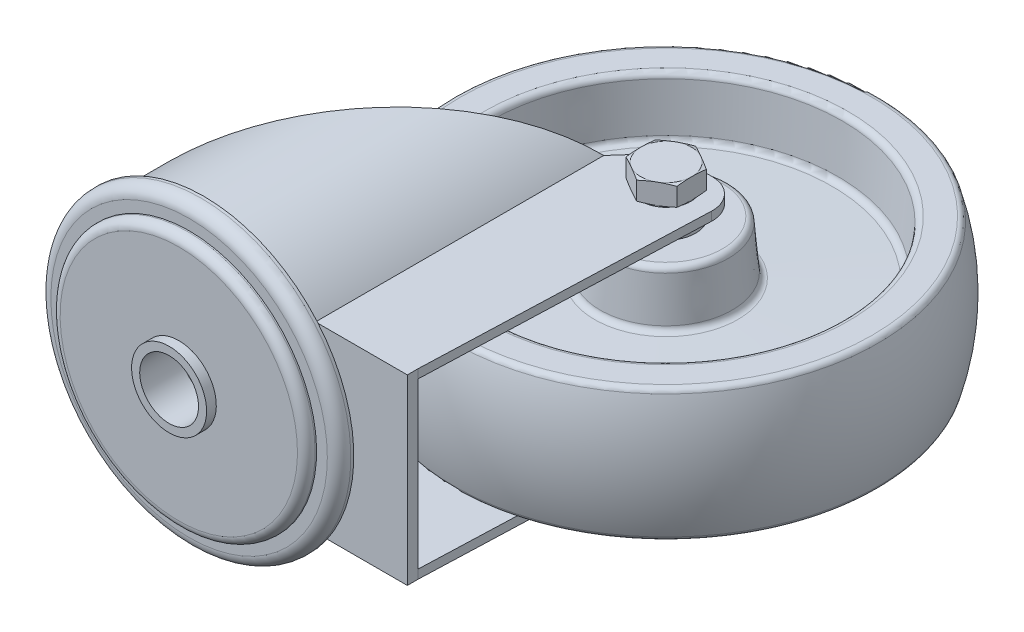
ISO-10303-21;
HEADER;
FILE_DESCRIPTION(('STEP AP214'),'2;1');
FILE_NAME('part.step','',(''),(''),'','','');
FILE_SCHEMA(('AUTOMOTIVE_DESIGN { 1 0 10303 214 1 1 1 1 }'));
ENDSEC;
DATA;
#1=APPLICATION_CONTEXT('core data for automotive mechanical design processes');
#2=APPLICATION_PROTOCOL_DEFINITION('international standard','automotive_design',2000,#1);
#3=PRODUCT_CONTEXT('',#1,'mechanical');
#4=PRODUCT('Part','Part','',(#3));
#5=PRODUCT_RELATED_PRODUCT_CATEGORY('part','',(#4));
#6=PRODUCT_DEFINITION_FORMATION('','',#4);
#7=PRODUCT_DEFINITION_CONTEXT('part definition',#1,'design');
#8=PRODUCT_DEFINITION('design','',#6,#7);
#9=PRODUCT_DEFINITION_SHAPE('','',#8);
#10=(LENGTH_UNIT() NAMED_UNIT(*) SI_UNIT(.MILLI.,.METRE.));
#11=(NAMED_UNIT(*) PLANE_ANGLE_UNIT() SI_UNIT($,.RADIAN.));
#12=(NAMED_UNIT(*) SI_UNIT($,.STERADIAN.) SOLID_ANGLE_UNIT());
#13=UNCERTAINTY_MEASURE_WITH_UNIT(LENGTH_MEASURE(1.E-05),#10,'distance_accuracy_value','');
#14=(GEOMETRIC_REPRESENTATION_CONTEXT(3) GLOBAL_UNCERTAINTY_ASSIGNED_CONTEXT((#13)) GLOBAL_UNIT_ASSIGNED_CONTEXT((#10,
#11,#12)) REPRESENTATION_CONTEXT('',''));
#15=CARTESIAN_POINT('',(0.,0.,0.));
#16=DIRECTION('',(0.,0.,1.));
#17=DIRECTION('',(1.,0.,0.));
#18=AXIS2_PLACEMENT_3D('',#15,#16,#17);
#19=CARTESIAN_POINT('',(36.832662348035,-22.5,-113.));
#20=DIRECTION('',(0.,-1.,0.));
#21=DIRECTION('',(1.,0.,0.));
#22=AXIS2_PLACEMENT_3D('',#19,#20,#21);
#23=PLANE('',#22);
#24=CARTESIAN_POINT('',(56.,-22.5,-113.));
#25=DIRECTION('',(0.,1.,0.));
#26=DIRECTION('',(-1.,0.,0.));
#27=AXIS2_PLACEMENT_3D('',#24,#25,#26);
#28=CIRCLE('',#27,10.);
#29=CARTESIAN_POINT('',(46.,-22.5,-113.));
#30=VERTEX_POINT('',#29);
#31=EDGE_CURVE('E9',#30,#30,#28,.T.);
#32=ORIENTED_EDGE('',*,*,#31,.T.);
#33=EDGE_LOOP('',(#32));
#34=FACE_BOUND('',#33,.T.);
#35=CARTESIAN_POINT('',(56.,-22.5,-113.));
#36=DIRECTION('',(0.,1.,0.));
#37=DIRECTION('',(-1.,0.,0.));
#38=AXIS2_PLACEMENT_3D('',#35,#36,#37);
#39=CIRCLE('',#38,19.167337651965);
#40=CARTESIAN_POINT('',(36.832662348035,-22.5,-113.));
#41=VERTEX_POINT('',#40);
#42=EDGE_CURVE('E2685',#41,#41,#39,.T.);
#43=ORIENTED_EDGE('',*,*,#42,.F.);
#44=EDGE_LOOP('',(#43));
#45=FACE_BOUND('',#44,.T.);
#46=ADVANCED_FACE('F14',(#34,#45),#23,.T.);
#47=CARTESIAN_POINT('',(46.,22.5,-113.));
#48=DIRECTION('',(0.,1.,0.));
#49=DIRECTION('',(-1.,0.,0.));
#50=AXIS2_PLACEMENT_3D('',#47,#48,#49);
#51=PLANE('',#50);
#52=CARTESIAN_POINT('',(56.,22.5,-113.));
#53=DIRECTION('',(0.,1.,0.));
#54=DIRECTION('',(-1.,0.,0.));
#55=AXIS2_PLACEMENT_3D('',#52,#53,#54);
#56=CIRCLE('',#55,19.167337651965);
#57=CARTESIAN_POINT('',(36.832662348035,22.5,-113.));
#58=VERTEX_POINT('',#57);
#59=EDGE_CURVE('E2735',#58,#58,#56,.T.);
#60=ORIENTED_EDGE('',*,*,#59,.T.);
#61=EDGE_LOOP('',(#60));
#62=FACE_BOUND('',#61,.T.);
#63=CARTESIAN_POINT('',(56.,22.5,-113.));
#64=DIRECTION('',(0.,1.,0.));
#65=DIRECTION('',(-1.,0.,0.));
#66=AXIS2_PLACEMENT_3D('',#63,#64,#65);
#67=CIRCLE('',#66,10.);
#68=CARTESIAN_POINT('',(46.,22.5,-113.));
#69=VERTEX_POINT('',#68);
#70=EDGE_CURVE('E24',#69,#69,#67,.T.);
#71=ORIENTED_EDGE('',*,*,#70,.F.);
#72=EDGE_LOOP('',(#71));
#73=FACE_BOUND('',#72,.T.);
#74=ADVANCED_FACE('F1398',(#62,#73),#51,.T.);
#75=CARTESIAN_POINT('',(56.,20.499999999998,-113.));
#76=DIRECTION('',(0.,1.,0.));
#77=DIRECTION('',(-1.,0.,0.));
#78=AXIS2_PLACEMENT_3D('',#75,#76,#77);
#79=TOROIDAL_SURFACE('',#78,19.1673376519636,2.00000000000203);
#80=CARTESIAN_POINT('',(56.,20.674311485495,-113.));
#81=DIRECTION('',(0.,1.,0.));
#82=DIRECTION('',(-1.,0.,0.));
#83=AXIS2_PLACEMENT_3D('',#80,#81,#82);
#84=CIRCLE('',#83,21.159727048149);
#85=CARTESIAN_POINT('',(34.840272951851,20.674311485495,-113.));
#86=VERTEX_POINT('',#85);
#87=EDGE_CURVE('E2732',#86,#86,#84,.T.);
#88=ORIENTED_EDGE('',*,*,#87,.T.);
#89=EDGE_LOOP('',(#88));
#90=FACE_BOUND('',#89,.T.);
#91=ORIENTED_EDGE('',*,*,#59,.F.);
#92=EDGE_LOOP('',(#91));
#93=FACE_BOUND('',#92,.T.);
#94=ADVANCED_FACE('F1387',(#90,#93),#79,.T.);
#95=CARTESIAN_POINT('',(56.,20.674311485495,-113.));
#96=DIRECTION('',(0.,-1.,0.));
#97=DIRECTION('',(1.,0.,0.));
#98=AXIS2_PLACEMENT_3D('',#95,#96,#97);
#99=CONICAL_SURFACE('',#98,21.159727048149,0.0872664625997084);
#100=CARTESIAN_POINT('',(56.,6.0838414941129,-113.));
#101=DIRECTION('',(0.,1.,0.));
#102=DIRECTION('',(-1.,0.,0.));
#103=AXIS2_PLACEMENT_3D('',#100,#101,#102);
#104=CIRCLE('',#103,22.43622776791);
#105=CARTESIAN_POINT('',(33.56377223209,6.0838414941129,-113.));
#106=VERTEX_POINT('',#105);
#107=EDGE_CURVE('E2729',#106,#106,#104,.T.);
#108=ORIENTED_EDGE('',*,*,#107,.T.);
#109=EDGE_LOOP('',(#108));
#110=FACE_BOUND('',#109,.T.);
#111=ORIENTED_EDGE('',*,*,#87,.F.);
#112=EDGE_LOOP('',(#111));
#113=FACE_BOUND('',#112,.T.);
#114=ADVANCED_FACE('F1376',(#110,#113),#99,.T.);
#115=CARTESIAN_POINT('',(56.,6.2581529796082,-113.));
#116=DIRECTION('',(0.,1.,0.));
#117=DIRECTION('',(-1.,0.,0.));
#118=AXIS2_PLACEMENT_3D('',#115,#116,#117);
#119=TOROIDAL_SURFACE('',#118,24.4286171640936,2.00000000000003);
#120=CARTESIAN_POINT('',(56.,4.25937132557,-113.));
#121=DIRECTION('',(0.,1.,0.));
#122=DIRECTION('',(-1.,0.,0.));
#123=AXIS2_PLACEMENT_3D('',#120,#121,#122);
#124=CIRCLE('',#123,24.358818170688);
#125=CARTESIAN_POINT('',(31.641181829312,4.25937132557,-113.));
#126=VERTEX_POINT('',#125);
#127=EDGE_CURVE('E2726',#126,#126,#124,.T.);
#128=ORIENTED_EDGE('',*,*,#127,.T.);
#129=EDGE_LOOP('',(#128));
#130=FACE_BOUND('',#129,.T.);
#131=ORIENTED_EDGE('',*,*,#107,.F.);
#132=EDGE_LOOP('',(#131));
#133=FACE_BOUND('',#132,.T.);
#134=ADVANCED_FACE('F1365',(#130,#133),#119,.F.);
#135=CARTESIAN_POINT('',(56.,4.25937132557,-113.));
#136=DIRECTION('',(0.,-1.,0.));
#137=DIRECTION('',(1.,0.,0.));
#138=AXIS2_PLACEMENT_3D('',#135,#136,#137);
#139=CONICAL_SURFACE('',#138,24.358818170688,1.53588974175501);
#140=CARTESIAN_POINT('',(56.,3.1403400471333,-113.));
#141=DIRECTION('',(0.,1.,0.));
#142=DIRECTION('',(-1.,0.,0.));
#143=AXIS2_PLACEMENT_3D('',#140,#141,#142);
#144=CIRCLE('',#143,56.403681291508);
#145=CARTESIAN_POINT('',(-0.403681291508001,3.1403400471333,-113.));
#146=VERTEX_POINT('',#145);
#147=EDGE_CURVE('E2723',#146,#146,#144,.T.);
#148=ORIENTED_EDGE('',*,*,#147,.T.);
#149=EDGE_LOOP('',(#148));
#150=FACE_BOUND('',#149,.T.);
#151=ORIENTED_EDGE('',*,*,#127,.F.);
#152=EDGE_LOOP('',(#151));
#153=FACE_BOUND('',#152,.T.);
#154=ADVANCED_FACE('F1354',(#150,#153),#139,.T.);
#155=CARTESIAN_POINT('',(56.,5.1391217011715,-113.));
#156=DIRECTION('',(0.,1.,0.));
#157=DIRECTION('',(-1.,0.,0.));
#158=AXIS2_PLACEMENT_3D('',#155,#156,#157);
#159=TOROIDAL_SURFACE('',#158,56.4734802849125,2.);
#160=CARTESIAN_POINT('',(56.,4.9648102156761,-113.));
#161=DIRECTION('',(0.,1.,0.));
#162=DIRECTION('',(-1.,0.,0.));
#163=AXIS2_PLACEMENT_3D('',#160,#161,#162);
#164=CIRCLE('',#163,58.465869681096);
#165=CARTESIAN_POINT('',(-2.46586968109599,4.9648102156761,-113.));
#166=VERTEX_POINT('',#165);
#167=EDGE_CURVE('E2720',#166,#166,#164,.T.);
#168=ORIENTED_EDGE('',*,*,#167,.T.);
#169=EDGE_LOOP('',(#168));
#170=FACE_BOUND('',#169,.T.);
#171=ORIENTED_EDGE('',*,*,#147,.F.);
#172=EDGE_LOOP('',(#171));
#173=FACE_BOUND('',#172,.T.);
#174=ADVANCED_FACE('F1343',(#170,#173),#159,.F.);
#175=CARTESIAN_POINT('',(56.,4.9648102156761,-113.));
#176=DIRECTION('',(0.,1.,0.));
#177=DIRECTION('',(-1.,0.,0.));
#178=AXIS2_PLACEMENT_3D('',#175,#176,#177);
#179=CONICAL_SURFACE('',#178,58.465869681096,0.0872664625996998);
#180=CARTESIAN_POINT('',(56.,20.674311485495,-113.));
#181=DIRECTION('',(0.,1.,0.));
#182=DIRECTION('',(-1.,0.,0.));
#183=AXIS2_PLACEMENT_3D('',#180,#181,#182);
#184=CIRCLE('',#183,59.840272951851);
#185=CARTESIAN_POINT('',(-3.840272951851,20.674311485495,-113.));
#186=VERTEX_POINT('',#185);
#187=EDGE_CURVE('E2717',#186,#186,#184,.T.);
#188=ORIENTED_EDGE('',*,*,#187,.T.);
#189=EDGE_LOOP('',(#188));
#190=FACE_BOUND('',#189,.T.);
#191=ORIENTED_EDGE('',*,*,#167,.F.);
#192=EDGE_LOOP('',(#191));
#193=FACE_BOUND('',#192,.T.);
#194=ADVANCED_FACE('F1332',(#190,#193),#179,.F.);
#195=CARTESIAN_POINT('',(56.,20.499999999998,-113.));
#196=DIRECTION('',(0.,1.,0.));
#197=DIRECTION('',(-1.,0.,0.));
#198=AXIS2_PLACEMENT_3D('',#195,#196,#197);
#199=TOROIDAL_SURFACE('',#198,61.8326623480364,2.00000000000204);
#200=CARTESIAN_POINT('',(56.,22.5,-113.));
#201=DIRECTION('',(0.,1.,0.));
#202=DIRECTION('',(-1.,0.,0.));
#203=AXIS2_PLACEMENT_3D('',#200,#201,#202);
#204=CIRCLE('',#203,61.832662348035);
#205=CARTESIAN_POINT('',(-5.832662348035,22.5,-113.));
#206=VERTEX_POINT('',#205);
#207=EDGE_CURVE('E2714',#206,#206,#204,.T.);
#208=ORIENTED_EDGE('',*,*,#207,.T.);
#209=EDGE_LOOP('',(#208));
#210=FACE_BOUND('',#209,.T.);
#211=ORIENTED_EDGE('',*,*,#187,.F.);
#212=EDGE_LOOP('',(#211));
#213=FACE_BOUND('',#212,.T.);
#214=ADVANCED_FACE('F1321',(#210,#213),#199,.T.);
#215=CARTESIAN_POINT('',(-5.832662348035,22.5,-113.));
#216=DIRECTION('',(0.,1.,0.));
#217=DIRECTION('',(-1.,0.,0.));
#218=AXIS2_PLACEMENT_3D('',#215,#216,#217);
#219=PLANE('',#218);
#220=CARTESIAN_POINT('',(56.,22.5,-113.));
#221=DIRECTION('',(0.,1.,0.));
#222=DIRECTION('',(-1.,0.,0.));
#223=AXIS2_PLACEMENT_3D('',#220,#221,#222);
#224=CIRCLE('',#223,70.062472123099);
#225=CARTESIAN_POINT('',(-14.062472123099,22.5,-113.));
#226=VERTEX_POINT('',#225);
#227=EDGE_CURVE('E2687',#226,#226,#224,.T.);
#228=ORIENTED_EDGE('',*,*,#227,.T.);
#229=EDGE_LOOP('',(#228));
#230=FACE_BOUND('',#229,.T.);
#231=ORIENTED_EDGE('',*,*,#207,.F.);
#232=EDGE_LOOP('',(#231));
#233=FACE_BOUND('',#232,.T.);
#234=ADVANCED_FACE('F1310',(#230,#233),#219,.T.);
#235=CARTESIAN_POINT('',(-13.,-22.5,-113.));
#236=DIRECTION('',(0.,-1.,0.));
#237=DIRECTION('',(1.,0.,0.));
#238=AXIS2_PLACEMENT_3D('',#235,#236,#237);
#239=PLANE('',#238);
#240=CARTESIAN_POINT('',(56.,-22.5,-113.));
#241=DIRECTION('',(0.,1.,0.));
#242=DIRECTION('',(-1.,0.,0.));
#243=AXIS2_PLACEMENT_3D('',#240,#241,#242);
#244=CIRCLE('',#243,61.832662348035);
#245=CARTESIAN_POINT('',(-5.832662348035,-22.5,-113.));
#246=VERTEX_POINT('',#245);
#247=EDGE_CURVE('E2711',#246,#246,#244,.T.);
#248=ORIENTED_EDGE('',*,*,#247,.T.);
#249=EDGE_LOOP('',(#248));
#250=FACE_BOUND('',#249,.T.);
#251=CARTESIAN_POINT('',(56.,-22.5,-113.));
#252=DIRECTION('',(0.,1.,0.));
#253=DIRECTION('',(-1.,0.,0.));
#254=AXIS2_PLACEMENT_3D('',#251,#252,#253);
#255=CIRCLE('',#254,70.062472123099);
#256=CARTESIAN_POINT('',(-14.062472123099,-22.5,-113.));
#257=VERTEX_POINT('',#256);
#258=EDGE_CURVE('E717',#257,#257,#255,.T.);
#259=ORIENTED_EDGE('',*,*,#258,.F.);
#260=EDGE_LOOP('',(#259));
#261=FACE_BOUND('',#260,.T.);
#262=ADVANCED_FACE('F1299',(#250,#261),#239,.T.);
#263=CARTESIAN_POINT('',(56.,-20.499999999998,-113.));
#264=DIRECTION('',(0.,1.,0.));
#265=DIRECTION('',(-1.,0.,0.));
#266=AXIS2_PLACEMENT_3D('',#263,#264,#265);
#267=TOROIDAL_SURFACE('',#266,61.8326623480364,2.00000000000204);
#268=CARTESIAN_POINT('',(56.,-20.674311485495,-113.));
#269=DIRECTION('',(0.,1.,0.));
#270=DIRECTION('',(-1.,0.,0.));
#271=AXIS2_PLACEMENT_3D('',#268,#269,#270);
#272=CIRCLE('',#271,59.840272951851);
#273=CARTESIAN_POINT('',(-3.840272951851,-20.674311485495,-113.));
#274=VERTEX_POINT('',#273);
#275=EDGE_CURVE('E2708',#274,#274,#272,.T.);
#276=ORIENTED_EDGE('',*,*,#275,.T.);
#277=EDGE_LOOP('',(#276));
#278=FACE_BOUND('',#277,.T.);
#279=ORIENTED_EDGE('',*,*,#247,.F.);
#280=EDGE_LOOP('',(#279));
#281=FACE_BOUND('',#280,.T.);
#282=ADVANCED_FACE('F1288',(#278,#281),#267,.T.);
#283=CARTESIAN_POINT('',(56.,-20.674311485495,-113.));
#284=DIRECTION('',(0.,-1.,0.));
#285=DIRECTION('',(1.,0.,0.));
#286=AXIS2_PLACEMENT_3D('',#283,#284,#285);
#287=CONICAL_SURFACE('',#286,59.840272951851,0.0872664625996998);
#288=CARTESIAN_POINT('',(56.,-4.9648102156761,-113.));
#289=DIRECTION('',(0.,1.,0.));
#290=DIRECTION('',(-1.,0.,0.));
#291=AXIS2_PLACEMENT_3D('',#288,#289,#290);
#292=CIRCLE('',#291,58.465869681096);
#293=CARTESIAN_POINT('',(-2.46586968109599,-4.9648102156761,-113.));
#294=VERTEX_POINT('',#293);
#295=EDGE_CURVE('E2705',#294,#294,#292,.T.);
#296=ORIENTED_EDGE('',*,*,#295,.T.);
#297=EDGE_LOOP('',(#296));
#298=FACE_BOUND('',#297,.T.);
#299=ORIENTED_EDGE('',*,*,#275,.F.);
#300=EDGE_LOOP('',(#299));
#301=FACE_BOUND('',#300,.T.);
#302=ADVANCED_FACE('F1277',(#298,#301),#287,.F.);
#303=CARTESIAN_POINT('',(56.,-5.1391217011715,-113.));
#304=DIRECTION('',(0.,1.,0.));
#305=DIRECTION('',(-1.,0.,0.));
#306=AXIS2_PLACEMENT_3D('',#303,#304,#305);
#307=TOROIDAL_SURFACE('',#306,56.4734802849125,2.);
#308=CARTESIAN_POINT('',(56.,-3.1403400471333,-113.));
#309=DIRECTION('',(0.,1.,0.));
#310=DIRECTION('',(-1.,0.,0.));
#311=AXIS2_PLACEMENT_3D('',#308,#309,#310);
#312=CIRCLE('',#311,56.403681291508);
#313=CARTESIAN_POINT('',(-0.403681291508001,-3.1403400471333,-113.));
#314=VERTEX_POINT('',#313);
#315=EDGE_CURVE('E2702',#314,#314,#312,.T.);
#316=ORIENTED_EDGE('',*,*,#315,.T.);
#317=EDGE_LOOP('',(#316));
#318=FACE_BOUND('',#317,.T.);
#319=ORIENTED_EDGE('',*,*,#295,.F.);
#320=EDGE_LOOP('',(#319));
#321=FACE_BOUND('',#320,.T.);
#322=ADVANCED_FACE('F1266',(#318,#321),#307,.F.);
#323=CARTESIAN_POINT('',(56.,-3.1403400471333,-113.));
#324=DIRECTION('',(0.,1.,0.));
#325=DIRECTION('',(-1.,0.,0.));
#326=AXIS2_PLACEMENT_3D('',#323,#324,#325);
#327=CONICAL_SURFACE('',#326,56.403681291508,1.53588974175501);
#328=CARTESIAN_POINT('',(56.,-4.25937132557,-113.));
#329=DIRECTION('',(0.,1.,0.));
#330=DIRECTION('',(-1.,0.,0.));
#331=AXIS2_PLACEMENT_3D('',#328,#329,#330);
#332=CIRCLE('',#331,24.358818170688);
#333=CARTESIAN_POINT('',(31.641181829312,-4.25937132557,-113.));
#334=VERTEX_POINT('',#333);
#335=EDGE_CURVE('E2699',#334,#334,#332,.T.);
#336=ORIENTED_EDGE('',*,*,#335,.T.);
#337=EDGE_LOOP('',(#336));
#338=FACE_BOUND('',#337,.T.);
#339=ORIENTED_EDGE('',*,*,#315,.F.);
#340=EDGE_LOOP('',(#339));
#341=FACE_BOUND('',#340,.T.);
#342=ADVANCED_FACE('F1255',(#338,#341),#327,.T.);
#343=CARTESIAN_POINT('',(56.,-6.2581529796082,-113.));
#344=DIRECTION('',(0.,1.,0.));
#345=DIRECTION('',(-1.,0.,0.));
#346=AXIS2_PLACEMENT_3D('',#343,#344,#345);
#347=TOROIDAL_SURFACE('',#346,24.4286171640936,2.00000000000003);
#348=CARTESIAN_POINT('',(56.,-6.0838414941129,-113.));
#349=DIRECTION('',(0.,1.,0.));
#350=DIRECTION('',(-1.,0.,0.));
#351=AXIS2_PLACEMENT_3D('',#348,#349,#350);
#352=CIRCLE('',#351,22.43622776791);
#353=CARTESIAN_POINT('',(33.56377223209,-6.0838414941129,-113.));
#354=VERTEX_POINT('',#353);
#355=EDGE_CURVE('E2690',#354,#354,#352,.T.);
#356=ORIENTED_EDGE('',*,*,#355,.T.);
#357=EDGE_LOOP('',(#356));
#358=FACE_BOUND('',#357,.T.);
#359=ORIENTED_EDGE('',*,*,#335,.F.);
#360=EDGE_LOOP('',(#359));
#361=FACE_BOUND('',#360,.T.);
#362=ADVANCED_FACE('F1244',(#358,#361),#347,.F.);
#363=CARTESIAN_POINT('',(56.,-6.0838414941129,-113.));
#364=DIRECTION('',(0.,1.,0.));
#365=DIRECTION('',(-1.,0.,0.));
#366=AXIS2_PLACEMENT_3D('',#363,#364,#365);
#367=CONICAL_SURFACE('',#366,22.43622776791,0.0872664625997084);
#368=CARTESIAN_POINT('',(56.,-20.674311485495,-113.));
#369=DIRECTION('',(0.,1.,0.));
#370=DIRECTION('',(-1.,0.,0.));
#371=AXIS2_PLACEMENT_3D('',#368,#369,#370);
#372=CIRCLE('',#371,21.159727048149);
#373=CARTESIAN_POINT('',(34.840272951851,-20.674311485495,-113.));
#374=VERTEX_POINT('',#373);
#375=EDGE_CURVE('E2686',#374,#374,#372,.T.);
#376=ORIENTED_EDGE('',*,*,#375,.T.);
#377=EDGE_LOOP('',(#376));
#378=FACE_BOUND('',#377,.T.);
#379=ORIENTED_EDGE('',*,*,#355,.F.);
#380=EDGE_LOOP('',(#379));
#381=FACE_BOUND('',#380,.T.);
#382=ADVANCED_FACE('F1233',(#378,#381),#367,.T.);
#383=CARTESIAN_POINT('',(56.,-20.499999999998,-113.));
#384=DIRECTION('',(0.,1.,0.));
#385=DIRECTION('',(-1.,0.,0.));
#386=AXIS2_PLACEMENT_3D('',#383,#384,#385);
#387=TOROIDAL_SURFACE('',#386,19.1673376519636,2.00000000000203);
#388=ORIENTED_EDGE('',*,*,#42,.T.);
#389=EDGE_LOOP('',(#388));
#390=FACE_BOUND('',#389,.T.);
#391=ORIENTED_EDGE('',*,*,#375,.F.);
#392=EDGE_LOOP('',(#391));
#393=FACE_BOUND('',#392,.T.);
#394=ADVANCED_FACE('F1222',(#390,#393),#387,.T.);
#395=CARTESIAN_POINT('',(56.,20.5000000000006,-113.));
#396=DIRECTION('',(0.,1.,0.));
#397=DIRECTION('',(-1.,0.,0.));
#398=AXIS2_PLACEMENT_3D('',#395,#396,#397);
#399=TOROIDAL_SURFACE('',#398,70.0624721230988,1.99999999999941);
#400=CARTESIAN_POINT('',(56.,21.061643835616,-113.));
#401=DIRECTION('',(0.,1.,0.));
#402=DIRECTION('',(-1.,0.,0.));
#403=AXIS2_PLACEMENT_3D('',#400,#401,#402);
#404=CIRCLE('',#403,71.981991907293);
#405=CARTESIAN_POINT('',(-15.981991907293,21.061643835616,-113.));
#406=VERTEX_POINT('',#405);
#407=EDGE_CURVE('E2693',#406,#406,#404,.T.);
#408=ORIENTED_EDGE('',*,*,#407,.T.);
#409=EDGE_LOOP('',(#408));
#410=FACE_BOUND('',#409,.T.);
#411=ORIENTED_EDGE('',*,*,#227,.F.);
#412=EDGE_LOOP('',(#411));
#413=FACE_BOUND('',#412,.T.);
#414=ADVANCED_FACE('F1211',(#410,#413),#399,.T.);
#415=CARTESIAN_POINT('',(55.9999999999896,0.,-113.));
#416=DIRECTION('',(0.,1.,0.));
#417=DIRECTION('',(-1.,0.,0.));
#418=AXIS2_PLACEMENT_3D('',#415,#416,#417);
#419=SPHERICAL_SURFACE('',#418,74.9999999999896);
#420=CARTESIAN_POINT('',(56.,-21.061643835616,-113.));
#421=DIRECTION('',(0.,1.,0.));
#422=DIRECTION('',(-1.,0.,0.));
#423=AXIS2_PLACEMENT_3D('',#420,#421,#422);
#424=CIRCLE('',#423,71.981991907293);
#425=CARTESIAN_POINT('',(-15.981991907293,-21.061643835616,-113.));
#426=VERTEX_POINT('',#425);
#427=EDGE_CURVE('E720',#426,#426,#424,.T.);
#428=CARTESIAN_POINT('',(-15.981991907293,-21.061643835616,-113.));
#429=CARTESIAN_POINT('',(-16.1068924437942,-20.6347751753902,-113.));
#430=CARTESIAN_POINT('',(-16.2279949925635,-20.2067952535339,-113.));
#431=CARTESIAN_POINT('',(-16.4625676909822,-19.3487488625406,-113.));
#432=CARTESIAN_POINT('',(-16.5760378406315,-18.9186823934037,-113.));
#433=CARTESIAN_POINT('',(-16.7953093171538,-18.0565988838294,-113.));
#434=CARTESIAN_POINT('',(-16.9011106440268,-17.624581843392,-113.));
#435=CARTESIAN_POINT('',(-17.1050111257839,-16.7587339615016,-113.));
#436=CARTESIAN_POINT('',(-17.2031102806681,-16.3249031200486,-113.));
#437=CARTESIAN_POINT('',(-17.391575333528,-15.4555649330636,-113.));
#438=CARTESIAN_POINT('',(-17.4819412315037,-15.0200575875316,-113.));
#439=CARTESIAN_POINT('',(-17.6549111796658,-14.1475042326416,-113.));
#440=CARTESIAN_POINT('',(-17.7375152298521,-13.7104582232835,-113.));
#441=CARTESIAN_POINT('',(-17.8949353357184,-12.8349658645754,-113.));
#442=CARTESIAN_POINT('',(-17.9697513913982,-12.3965195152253,-113.));
#443=CARTESIAN_POINT('',(-18.1115718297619,-11.5183652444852,-113.));
#444=CARTESIAN_POINT('',(-18.1785762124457,-11.0786573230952,-113.));
#445=CARTESIAN_POINT('',(-18.3047520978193,-10.198119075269,-113.));
#446=CARTESIAN_POINT('',(-18.3639236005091,-9.75728874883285,-113.));
#447=CARTESIAN_POINT('',(-18.4744149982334,-8.87464521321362,-113.));
#448=CARTESIAN_POINT('',(-18.5257348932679,-8.43283200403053,-113.));
#449=CARTESIAN_POINT('',(-18.6205068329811,-7.54836253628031,-113.));
#450=CARTESIAN_POINT('',(-18.6639588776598,-7.10570627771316,-113.));
#451=CARTESIAN_POINT('',(-18.7429813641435,-6.21969081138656,-113.));
#452=CARTESIAN_POINT('',(-18.7785518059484,-5.77633160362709,-113.));
#453=CARTESIAN_POINT('',(-18.8417998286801,-4.88905056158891,-113.));
#454=CARTESIAN_POINT('',(-18.8694774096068,-4.44512872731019,-113.));
#455=CARTESIAN_POINT('',(-18.9169309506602,-3.55686293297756,-113.));
#456=CARTESIAN_POINT('',(-18.9367069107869,-3.11251897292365,-113.));
#457=CARTESIAN_POINT('',(-18.9683509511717,-2.2235495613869,-113.));
#458=CARTESIAN_POINT('',(-18.9802190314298,-1.77892410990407,-113.));
#459=CARTESIAN_POINT('',(-18.996043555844,-0.889532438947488,-113.));
#460=CARTESIAN_POINT('',(-19.,-0.444766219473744,-113.));
#461=CARTESIAN_POINT('',(-19.,0.444766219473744,-113.));
#462=CARTESIAN_POINT('',(-18.996043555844,0.889532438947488,-113.));
#463=CARTESIAN_POINT('',(-18.9802190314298,1.77892410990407,-113.));
#464=CARTESIAN_POINT('',(-18.9683509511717,2.2235495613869,-113.));
#465=CARTESIAN_POINT('',(-18.9367069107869,3.11251897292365,-113.));
#466=CARTESIAN_POINT('',(-18.9169309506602,3.55686293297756,-113.));
#467=CARTESIAN_POINT('',(-18.8694774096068,4.44512872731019,-113.));
#468=CARTESIAN_POINT('',(-18.8417998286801,4.88905056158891,-113.));
#469=CARTESIAN_POINT('',(-18.7785518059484,5.77633160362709,-113.));
#470=CARTESIAN_POINT('',(-18.7429813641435,6.21969081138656,-113.));
#471=CARTESIAN_POINT('',(-18.6639588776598,7.10570627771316,-113.));
#472=CARTESIAN_POINT('',(-18.6205068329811,7.54836253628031,-113.));
#473=CARTESIAN_POINT('',(-18.5257348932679,8.43283200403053,-113.));
#474=CARTESIAN_POINT('',(-18.4744149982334,8.87464521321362,-113.));
#475=CARTESIAN_POINT('',(-18.3639236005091,9.75728874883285,-113.));
#476=CARTESIAN_POINT('',(-18.3047520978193,10.198119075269,-113.));
#477=CARTESIAN_POINT('',(-18.1785762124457,11.0786573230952,-113.));
#478=CARTESIAN_POINT('',(-18.1115718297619,11.5183652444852,-113.));
#479=CARTESIAN_POINT('',(-17.9697513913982,12.3965195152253,-113.));
#480=CARTESIAN_POINT('',(-17.8949353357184,12.8349658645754,-113.));
#481=CARTESIAN_POINT('',(-17.7375152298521,13.7104582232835,-113.));
#482=CARTESIAN_POINT('',(-17.6549111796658,14.1475042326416,-113.));
#483=CARTESIAN_POINT('',(-17.4819412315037,15.0200575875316,-113.));
#484=CARTESIAN_POINT('',(-17.391575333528,15.4555649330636,-113.));
#485=CARTESIAN_POINT('',(-17.2031102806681,16.3249031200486,-113.));
#486=CARTESIAN_POINT('',(-17.1050111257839,16.7587339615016,-113.));
#487=CARTESIAN_POINT('',(-16.9011106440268,17.624581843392,-113.));
#488=CARTESIAN_POINT('',(-16.7953093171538,18.0565988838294,-113.));
#489=CARTESIAN_POINT('',(-16.5760378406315,18.9186823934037,-113.));
#490=CARTESIAN_POINT('',(-16.4625676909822,19.3487488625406,-113.));
#491=CARTESIAN_POINT('',(-16.2279949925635,20.2067952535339,-113.));
#492=CARTESIAN_POINT('',(-16.1068924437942,20.6347751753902,-113.));
#493=CARTESIAN_POINT('',(-15.981991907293,21.061643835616,-113.));
#494=B_SPLINE_CURVE_WITH_KNOTS('',3,(#428,#429,#430,#431,#432,#433,#434,#435,#436,#437,#438,
#439,#440,#441,#442,#443,#444,#445,#446,#447,#448,#449,#450,#451,#452,#453,#454,#455,#456,#457,
#458,#459,#460,#461,#462,#463,#464,#465,#466,#467,#468,#469,#470,#471,#472,#473,#474,#475,#476,
#477,#478,#479,#480,#481,#482,#483,#484,#485,#486,#487,#488,#489,#490,#491,#492,#493),
.UNSPECIFIED.,.F.,.F.,(4,2,2,2,2,2,2,2,2,2,2,2,2,2,2,2,2,2,2,2,2,2,2,2,2,2,2,2,2,2,2,2,4),(0.,
1.33428106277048,2.66856212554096,4.00284318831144,5.33712425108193,6.67140531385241,
8.00568637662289,9.33996743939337,10.6742485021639,12.0085295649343,13.3428106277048,
14.6770916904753,16.0113727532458,17.3456538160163,18.6799348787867,20.0142159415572,
21.3484970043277,22.6827780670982,24.0170591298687,25.3513401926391,26.6856212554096,
28.0199023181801,29.3541833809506,30.6884644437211,32.0227455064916,33.357026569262,
34.6913076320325,36.025588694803,37.3598697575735,38.694150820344,40.0284318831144,
41.3627129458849,42.6969940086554),.UNSPECIFIED.);
#495=EDGE_CURVE('BSEAM1200',#426,#406,#494,.T.);
#496=ORIENTED_EDGE('',*,*,#427,.T.);
#497=ORIENTED_EDGE('',*,*,#407,.F.);
#498=ORIENTED_EDGE('',*,*,#495,.T.);
#499=ORIENTED_EDGE('',*,*,#495,.F.);
#500=EDGE_LOOP('',(#496,#498,#497,#499));
#501=FACE_BOUND('',#500,.T.);
#502=ADVANCED_FACE('F1200',(#501),#419,.T.);
#503=CARTESIAN_POINT('',(56.,-20.5000000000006,-113.));
#504=DIRECTION('',(0.,1.,0.));
#505=DIRECTION('',(-1.,0.,0.));
#506=AXIS2_PLACEMENT_3D('',#503,#504,#505);
#507=TOROIDAL_SURFACE('',#506,70.0624721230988,1.99999999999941);
#508=ORIENTED_EDGE('',*,*,#258,.T.);
#509=EDGE_LOOP('',(#508));
#510=FACE_BOUND('',#509,.T.);
#511=ORIENTED_EDGE('',*,*,#427,.F.);
#512=EDGE_LOOP('',(#511));
#513=FACE_BOUND('',#512,.T.);
#514=ADVANCED_FACE('F979',(#510,#513),#507,.T.);
#515=CARTESIAN_POINT('',(56.,-45.,-117.9265));
#516=DIRECTION('',(0.,-1.,0.));
#517=DIRECTION('',(-1.,0.,0.));
#518=AXIS2_PLACEMENT_3D('',#515,#516,#517);
#519=PLANE('',#518);
#520=CARTESIAN_POINT('',(56.,-45.,-113.));
#521=DIRECTION('',(0.,1.,0.));
#522=DIRECTION('',(1.,0.,0.));
#523=AXIS2_PLACEMENT_3D('',#520,#521,#522);
#524=CIRCLE('',#523,4.9265);
#525=CARTESIAN_POINT('',(60.9265,-45.,-113.));
#526=VERTEX_POINT('',#525);
#527=EDGE_CURVE('E2622',#526,#526,#524,.T.);
#528=ORIENTED_EDGE('',*,*,#527,.F.);
#529=EDGE_LOOP('',(#528));
#530=FACE_BOUND('',#529,.T.);
#531=ADVANCED_FACE('F471',(#530),#519,.T.);
#532=CARTESIAN_POINT('',(56.,-43.9265,-113.));
#533=DIRECTION('',(0.,1.,0.));
#534=DIRECTION('',(1.,0.,0.));
#535=AXIS2_PLACEMENT_3D('',#532,#533,#534);
#536=CONICAL_SURFACE('',#535,6.,0.785398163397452);
#537=ORIENTED_EDGE('',*,*,#527,.T.);
#538=EDGE_LOOP('',(#537));
#539=FACE_BOUND('',#538,.T.);
#540=CARTESIAN_POINT('',(56.,-43.9265,-113.));
#541=DIRECTION('',(0.,1.,0.));
#542=DIRECTION('',(1.,0.,0.));
#543=AXIS2_PLACEMENT_3D('',#540,#541,#542);
#544=CIRCLE('',#543,6.);
#545=CARTESIAN_POINT('',(62.,-43.9265,-113.));
#546=VERTEX_POINT('',#545);
#547=EDGE_CURVE('E995',#546,#546,#544,.T.);
#548=ORIENTED_EDGE('',*,*,#547,.F.);
#549=EDGE_LOOP('',(#548));
#550=FACE_BOUND('',#549,.T.);
#551=ADVANCED_FACE('F978',(#539,#550),#536,.T.);
#552=CARTESIAN_POINT('',(56.,-45.,-113.));
#553=DIRECTION('',(0.,1.,0.));
#554=DIRECTION('',(1.,0.,0.));
#555=AXIS2_PLACEMENT_3D('',#552,#553,#554);
#556=CYLINDRICAL_SURFACE('',#555,6.);
#557=ORIENTED_EDGE('',*,*,#547,.T.);
#558=EDGE_LOOP('',(#557));
#559=FACE_BOUND('',#558,.T.);
#560=CARTESIAN_POINT('',(56.,-43.,-113.));
#561=DIRECTION('',(0.,1.,0.));
#562=DIRECTION('',(1.,0.,0.));
#563=AXIS2_PLACEMENT_3D('',#560,#561,#562);
#564=CIRCLE('',#563,6.);
#565=CARTESIAN_POINT('',(62.,-43.,-113.));
#566=VERTEX_POINT('',#565);
#567=EDGE_CURVE('E870',#566,#566,#564,.T.);
#568=ORIENTED_EDGE('',*,*,#567,.F.);
#569=EDGE_LOOP('',(#568));
#570=FACE_BOUND('',#569,.T.);
#571=ADVANCED_FACE('F983',(#559,#570),#556,.T.);
#572=CARTESIAN_POINT('',(56.,-43.,-119.));
#573=DIRECTION('',(0.,1.,0.));
#574=DIRECTION('',(1.,0.,0.));
#575=AXIS2_PLACEMENT_3D('',#572,#573,#574);
#576=PLANE('',#575);
#577=CARTESIAN_POINT('',(56.,-43.,-113.));
#578=DIRECTION('',(0.,1.,0.));
#579=DIRECTION('',(1.,0.,0.));
#580=AXIS2_PLACEMENT_3D('',#577,#578,#579);
#581=CIRCLE('',#580,8.315);
#582=CARTESIAN_POINT('',(64.315,-43.,-113.));
#583=VERTEX_POINT('',#582);
#584=EDGE_CURVE('E710',#583,#583,#581,.T.);
#585=ORIENTED_EDGE('',*,*,#584,.F.);
#586=EDGE_LOOP('',(#585));
#587=FACE_BOUND('',#586,.T.);
#588=ORIENTED_EDGE('',*,*,#567,.T.);
#589=EDGE_LOOP('',(#588));
#590=FACE_BOUND('',#589,.T.);
#591=ADVANCED_FACE('F429',(#587,#590),#576,.F.);
#592=CARTESIAN_POINT('',(56.,38.5,-113.));
#593=DIRECTION('',(0.,1.,0.));
#594=DIRECTION('',(1.,0.,0.));
#595=AXIS2_PLACEMENT_3D('',#592,#593,#594);
#596=PLANE('',#595);
#597=CARTESIAN_POINT('',(56.,38.5,-113.));
#598=DIRECTION('',(0.,1.,0.));
#599=DIRECTION('',(1.,0.,0.));
#600=AXIS2_PLACEMENT_3D('',#597,#598,#599);
#601=CIRCLE('',#600,8.6625);
#602=CARTESIAN_POINT('',(64.6625,38.5,-113.));
#603=VERTEX_POINT('',#602);
#604=CARTESIAN_POINT('',(60.33125,38.5,-120.501945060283));
#605=VERTEX_POINT('',#604);
#606=EDGE_CURVE('E303',#603,#605,#601,.T.);
#607=ORIENTED_EDGE('',*,*,#606,.T.);
#608=CARTESIAN_POINT('',(51.66875,38.5,-120.501945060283));
#609=VERTEX_POINT('',#608);
#610=EDGE_CURVE('E313',#605,#609,#601,.T.);
#611=ORIENTED_EDGE('',*,*,#610,.T.);
#612=CARTESIAN_POINT('',(47.3375,38.5,-113.));
#613=VERTEX_POINT('',#612);
#614=EDGE_CURVE('E317',#609,#613,#601,.T.);
#615=ORIENTED_EDGE('',*,*,#614,.T.);
#616=CARTESIAN_POINT('',(51.66875,38.5,-105.498054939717));
#617=VERTEX_POINT('',#616);
#618=EDGE_CURVE('E2584',#613,#617,#601,.T.);
#619=ORIENTED_EDGE('',*,*,#618,.T.);
#620=CARTESIAN_POINT('',(60.33125,38.5,-105.498054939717));
#621=VERTEX_POINT('',#620);
#622=EDGE_CURVE('E306',#617,#621,#601,.T.);
#623=ORIENTED_EDGE('',*,*,#622,.T.);
#624=EDGE_CURVE('E295',#621,#603,#601,.T.);
#625=ORIENTED_EDGE('',*,*,#624,.T.);
#626=EDGE_LOOP('',(#607,#611,#615,#619,#623,#625));
#627=FACE_BOUND('',#626,.T.);
#628=ADVANCED_FACE('F301',(#627),#596,.T.);
#629=CARTESIAN_POINT('',(56.,-43.,-113.));
#630=DIRECTION('',(0.,1.,0.));
#631=DIRECTION('',(1.,0.,0.));
#632=AXIS2_PLACEMENT_3D('',#629,#630,#631);
#633=CYLINDRICAL_SURFACE('',#632,8.315);
#634=CARTESIAN_POINT('',(56.,-39.25,-113.));
#635=DIRECTION('',(0.,1.,0.));
#636=DIRECTION('',(1.,0.,0.));
#637=AXIS2_PLACEMENT_3D('',#634,#635,#636);
#638=CIRCLE('',#637,8.315);
#639=CARTESIAN_POINT('',(64.315,-39.25,-113.));
#640=VERTEX_POINT('',#639);
#641=EDGE_CURVE('E708',#640,#640,#638,.T.);
#642=ORIENTED_EDGE('',*,*,#641,.F.);
#643=EDGE_LOOP('',(#642));
#644=FACE_BOUND('',#643,.T.);
#645=ORIENTED_EDGE('',*,*,#584,.T.);
#646=EDGE_LOOP('',(#645));
#647=FACE_BOUND('',#646,.T.);
#648=ADVANCED_FACE('F991',(#644,#647),#633,.T.);
#649=CARTESIAN_POINT('',(56.,38.5,-113.));
#650=DIRECTION('',(0.,-1.,0.));
#651=DIRECTION('',(-1.,0.,0.));
#652=AXIS2_PLACEMENT_3D('',#649,#650,#651);
#653=CONICAL_SURFACE('',#652,8.6625,1.30899693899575);
#654=CARTESIAN_POINT('',(47.3375,36.5837908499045,-99.769723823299));
#655=CARTESIAN_POINT('',(47.3375,36.6718654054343,-100.162716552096));
#656=CARTESIAN_POINT('',(47.3375,36.7588628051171,-100.555955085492));
#657=CARTESIAN_POINT('',(47.3375,36.9301218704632,-101.343044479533));
#658=CARTESIAN_POINT('',(47.3375,37.0143834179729,-101.736895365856));
#659=CARTESIAN_POINT('',(47.3375,37.1796626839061,-102.52568299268));
#660=CARTESIAN_POINT('',(47.3375,37.2606771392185,-102.920620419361));
#661=CARTESIAN_POINT('',(47.3375,37.4185877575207,-103.711317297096));
#662=CARTESIAN_POINT('',(47.3375,37.495483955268,-104.107076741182));
#663=CARTESIAN_POINT('',(47.3375,37.6435847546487,-104.896404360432));
#664=CARTESIAN_POINT('',(47.3375,37.7148297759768,-105.289964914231));
#665=CARTESIAN_POINT('',(47.3375,37.851099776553,-106.078159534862));
#666=CARTESIAN_POINT('',(47.3375,37.9161248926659,-106.472793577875));
#667=CARTESIAN_POINT('',(47.3375,38.0384909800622,-107.263211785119));
#668=CARTESIAN_POINT('',(47.3375,38.0958328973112,-107.658995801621));
#669=CARTESIAN_POINT('',(47.3375,38.2011428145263,-108.451823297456));
#670=CARTESIAN_POINT('',(47.3375,38.2491108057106,-108.848866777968));
#671=CARTESIAN_POINT('',(47.3375,38.3343145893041,-109.648692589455));
#672=CARTESIAN_POINT('',(47.3375,38.3714220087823,-110.051488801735));
#673=CARTESIAN_POINT('',(47.3375,38.4323447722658,-110.858093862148));
#674=CARTESIAN_POINT('',(47.3375,38.4561604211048,-111.261902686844));
#675=CARTESIAN_POINT('',(47.3375,38.4891106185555,-112.069947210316));
#676=CARTESIAN_POINT('',(47.3375,38.4982518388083,-112.474182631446));
#677=CARTESIAN_POINT('',(47.3375,38.5012911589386,-113.282711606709));
#678=CARTESIAN_POINT('',(47.3375,38.4951892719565,-113.687005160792));
#679=CARTESIAN_POINT('',(47.3375,38.468085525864,-114.496553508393));
#680=CARTESIAN_POINT('',(47.3375,38.4470295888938,-114.901806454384));
#681=CARTESIAN_POINT('',(47.3375,38.3912196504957,-115.711359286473));
#682=CARTESIAN_POINT('',(47.3375,38.3564653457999,-116.115659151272));
#683=CARTESIAN_POINT('',(47.3375,38.2750142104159,-116.9233024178));
#684=CARTESIAN_POINT('',(47.3375,38.2283095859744,-117.326645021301));
#685=CARTESIAN_POINT('',(47.3375,38.1249012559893,-118.13203217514));
#686=CARTESIAN_POINT('',(47.3375,38.068197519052,-118.5340767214));
#687=CARTESIAN_POINT('',(47.3375,37.9506304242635,-119.310329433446));
#688=CARTESIAN_POINT('',(47.3375,37.8902912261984,-119.684617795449));
#689=CARTESIAN_POINT('',(47.3375,37.7637562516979,-120.432208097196));
#690=CARTESIAN_POINT('',(47.3375,37.697560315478,-120.805510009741));
#691=CARTESIAN_POINT('',(47.3375,37.5603817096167,-121.551263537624));
#692=CARTESIAN_POINT('',(47.3375,37.4893986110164,-121.923715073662));
#693=CARTESIAN_POINT('',(47.3375,37.3435257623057,-122.667854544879));
#694=CARTESIAN_POINT('',(47.3375,37.2686359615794,-123.039542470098));
#695=CARTESIAN_POINT('',(47.3375,37.1156395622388,-123.782341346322));
#696=CARTESIAN_POINT('',(47.3375,37.0375322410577,-124.153452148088));
#697=CARTESIAN_POINT('',(47.3375,36.8786765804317,-124.895108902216));
#698=CARTESIAN_POINT('',(47.3375,36.7979282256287,-125.26565485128));
#699=CARTESIAN_POINT('',(47.3375,36.5524343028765,-126.376521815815));
#700=CARTESIAN_POINT('',(47.3375,36.3844293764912,-127.116122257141));
#701=CARTESIAN_POINT('',(47.3375,36.0440377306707,-128.586649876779));
#702=CARTESIAN_POINT('',(47.3375,35.8717102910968,-129.317590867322));
#703=CARTESIAN_POINT('',(47.3375,35.5227370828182,-130.778453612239));
#704=CARTESIAN_POINT('',(47.3375,35.3460912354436,-131.508375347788));
#705=CARTESIAN_POINT('',(47.3375,34.9898327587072,-132.966538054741));
#706=CARTESIAN_POINT('',(47.3375,34.8102240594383,-133.694779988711));
#707=CARTESIAN_POINT('',(47.3375,34.4485541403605,-135.150629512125));
#708=CARTESIAN_POINT('',(47.3375,34.2664930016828,-135.878237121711));
#709=CARTESIAN_POINT('',(47.3375,34.0835628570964,-136.605623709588));
#710=B_SPLINE_CURVE_WITH_KNOTS('',3,(#654,#655,#656,#657,#658,#659,#660,#661,#662,#663,#664,
#665,#666,#667,#668,#669,#670,#671,#672,#673,#674,#675,#676,#677,#678,#679,#680,#681,#682,#683,
#684,#685,#686,#687,#688,#689,#690,#691,#692,#693,#694,#695,#696,#697,#698,#699,#700,#701,#702,
#703,#704,#705,#706,#707,#708,#709),.UNSPECIFIED.,.F.,.F.,(4,2,2,2,2,2,2,2,2,2,2,2,2,2,2,2,2,2,
2,2,2,2,2,2,2,2,2,4),(0.,1.20822828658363,2.41650868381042,3.62597434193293,4.83542979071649,
6.03526153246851,7.23506686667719,8.4347243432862,9.63438294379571,10.847696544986,
12.0609823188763,13.2737163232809,14.4864492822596,15.703590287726,16.9207582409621,
18.1387220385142,19.3566896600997,20.4939973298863,21.6313360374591,22.768776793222,
23.9062322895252,25.0439446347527,26.1816635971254,28.4569473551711,30.7098731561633,
32.9628400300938,35.2130266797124,37.4631390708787),.UNSPECIFIED.);
#711=CARTESIAN_POINT('',(47.3375,38.1409230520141,-118.001296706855));
#712=VERTEX_POINT('',#711);
#713=EDGE_CURVE('E947',#613,#712,#710,.T.);
#714=ORIENTED_EDGE('',*,*,#713,.F.);
#715=ORIENTED_EDGE('',*,*,#614,.F.);
#716=CARTESIAN_POINT('',(47.3373,38.1408921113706,-118.001181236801));
#717=CARTESIAN_POINT('',(47.697048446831,38.1965683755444,-118.20888209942));
#718=CARTESIAN_POINT('',(48.0574491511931,38.2471132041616,-118.416959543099));
#719=CARTESIAN_POINT('',(48.7795233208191,38.3359156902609,-118.833849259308));
#720=CARTESIAN_POINT('',(49.1411972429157,38.3741683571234,-119.042661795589));
#721=CARTESIAN_POINT('',(49.8636250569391,38.4361533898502,-119.459755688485));
#722=CARTESIAN_POINT('',(50.224374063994,38.4599596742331,-119.668034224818));
#723=CARTESIAN_POINT('',(50.946332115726,38.4918814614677,-120.084856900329));
#724=CARTESIAN_POINT('',(51.307541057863,38.5000000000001,-120.293400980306));
#725=CARTESIAN_POINT('',(52.0299589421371,38.5000000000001,-120.710489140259));
#726=CARTESIAN_POINT('',(52.3911678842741,38.4918814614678,-120.919033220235));
#727=CARTESIAN_POINT('',(53.1131259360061,38.4599596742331,-121.335855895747));
#728=CARTESIAN_POINT('',(53.473874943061,38.4361533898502,-121.54413443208));
#729=CARTESIAN_POINT('',(54.1963027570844,38.3741683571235,-121.961228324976));
#730=CARTESIAN_POINT('',(54.557976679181,38.3359156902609,-122.170040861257));
#731=CARTESIAN_POINT('',(55.280050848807,38.2471132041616,-122.586930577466));
#732=CARTESIAN_POINT('',(55.6404515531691,38.1965683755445,-122.795008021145));
#733=CARTESIAN_POINT('',(56.0002,38.1408921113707,-123.002708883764));
#734=B_SPLINE_CURVE_WITH_KNOTS('',3,(#716,#717,#718,#719,#720,#721,#722,#723,#724,#725,#726,
#727,#728,#729,#730,#731,#732,#733),.UNSPECIFIED.,.F.,.F.,(4,2,2,2,2,2,2,2,4),(0.,
1.25741465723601,2.51533918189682,3.76677172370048,5.01796208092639,6.2691524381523,
7.52058497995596,8.77850950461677,10.0359241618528),.UNSPECIFIED.);
#735=EDGE_CURVE('E960',#712,#609,#734,.T.);
#736=ORIENTED_EDGE('',*,*,#735,.F.);
#737=EDGE_LOOP('',(#714,#715,#736));
#738=FACE_BOUND('',#737,.T.);
#739=ADVANCED_FACE('F534',(#738),#653,.T.);
#740=CARTESIAN_POINT('',(47.3375,38.1409230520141,-107.998703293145));
#741=VERTEX_POINT('',#740);
#742=EDGE_CURVE('E2587',#741,#613,#710,.T.);
#743=ORIENTED_EDGE('',*,*,#742,.F.);
#744=CARTESIAN_POINT('',(56.0002,38.1408921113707,-102.997291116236));
#745=CARTESIAN_POINT('',(55.640451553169,38.1965683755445,-103.204991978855));
#746=CARTESIAN_POINT('',(55.2800508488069,38.2471132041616,-103.413069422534));
#747=CARTESIAN_POINT('',(54.5579766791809,38.3359156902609,-103.829959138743));
#748=CARTESIAN_POINT('',(54.1963027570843,38.3741683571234,-104.038771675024));
#749=CARTESIAN_POINT('',(53.473874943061,38.4361533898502,-104.45586556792));
#750=CARTESIAN_POINT('',(53.1131259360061,38.4599596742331,-104.664144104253));
#751=CARTESIAN_POINT('',(52.3911678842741,38.4918814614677,-105.080966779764));
#752=CARTESIAN_POINT('',(52.029958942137,38.5,-105.289510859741));
#753=CARTESIAN_POINT('',(51.307541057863,38.5,-105.706599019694));
#754=CARTESIAN_POINT('',(50.946332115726,38.4918814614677,-105.91514309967));
#755=CARTESIAN_POINT('',(50.224374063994,38.4599596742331,-106.331965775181));
#756=CARTESIAN_POINT('',(49.8636250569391,38.4361533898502,-106.540244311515));
#757=CARTESIAN_POINT('',(49.1411972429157,38.3741683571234,-106.957338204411));
#758=CARTESIAN_POINT('',(48.7795233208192,38.3359156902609,-107.166150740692));
#759=CARTESIAN_POINT('',(48.0574491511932,38.2471132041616,-107.583040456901));
#760=CARTESIAN_POINT('',(47.697048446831,38.1965683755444,-107.79111790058));
#761=CARTESIAN_POINT('',(47.3373,38.1408921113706,-107.998818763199));
#762=B_SPLINE_CURVE_WITH_KNOTS('',3,(#744,#745,#746,#747,#748,#749,#750,#751,#752,#753,#754,
#755,#756,#757,#758,#759,#760,#761),.UNSPECIFIED.,.F.,.F.,(4,2,2,2,2,2,2,2,4),(0.,
1.25741465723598,2.51533918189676,3.7667717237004,5.01796208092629,6.26915243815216,
7.52058497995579,8.77850950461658,10.0359241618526),.UNSPECIFIED.);
#763=EDGE_CURVE('E940',#617,#741,#762,.T.);
#764=ORIENTED_EDGE('',*,*,#763,.F.);
#765=ORIENTED_EDGE('',*,*,#618,.F.);
#766=EDGE_LOOP('',(#743,#764,#765));
#767=FACE_BOUND('',#766,.T.);
#768=ADVANCED_FACE('F933',(#767),#653,.T.);
#769=CARTESIAN_POINT('',(56.,38.1409230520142,-102.99740658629));
#770=VERTEX_POINT('',#769);
#771=EDGE_CURVE('E2589',#770,#617,#762,.T.);
#772=ORIENTED_EDGE('',*,*,#771,.F.);
#773=CARTESIAN_POINT('',(64.6627,38.1408921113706,-107.998818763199));
#774=CARTESIAN_POINT('',(64.3029515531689,38.1965683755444,-107.79111790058));
#775=CARTESIAN_POINT('',(63.9425508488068,38.2471132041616,-107.583040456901));
#776=CARTESIAN_POINT('',(63.2204766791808,38.3359156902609,-107.166150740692));
#777=CARTESIAN_POINT('',(62.8588027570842,38.3741683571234,-106.957338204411));
#778=CARTESIAN_POINT('',(62.1363749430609,38.4361533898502,-106.540244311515));
#779=CARTESIAN_POINT('',(61.775625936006,38.4599596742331,-106.331965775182));
#780=CARTESIAN_POINT('',(61.053667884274,38.4918814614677,-105.915143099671));
#781=CARTESIAN_POINT('',(60.692458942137,38.5000000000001,-105.706599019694));
#782=CARTESIAN_POINT('',(59.9700410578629,38.5000000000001,-105.289510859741));
#783=CARTESIAN_POINT('',(59.6088321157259,38.4918814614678,-105.080966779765));
#784=CARTESIAN_POINT('',(58.8868740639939,38.4599596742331,-104.664144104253));
#785=CARTESIAN_POINT('',(58.526125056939,38.4361533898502,-104.45586556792));
#786=CARTESIAN_POINT('',(57.8036972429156,38.3741683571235,-104.038771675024));
#787=CARTESIAN_POINT('',(57.4420233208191,38.3359156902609,-103.829959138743));
#788=CARTESIAN_POINT('',(56.7199491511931,38.2471132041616,-103.413069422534));
#789=CARTESIAN_POINT('',(56.359548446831,38.1965683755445,-103.204991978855));
#790=CARTESIAN_POINT('',(55.9998,38.1408921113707,-102.997291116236));
#791=B_SPLINE_CURVE_WITH_KNOTS('',3,(#773,#774,#775,#776,#777,#778,#779,#780,#781,#782,#783,
#784,#785,#786,#787,#788,#789,#790),.UNSPECIFIED.,.F.,.F.,(4,2,2,2,2,2,2,2,4),(0.,
1.25741465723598,2.51533918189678,3.76677172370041,5.01796208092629,6.26915243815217,
7.52058497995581,8.7785095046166,10.0359241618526),.UNSPECIFIED.);
#792=EDGE_CURVE('E917',#621,#770,#791,.T.);
#793=ORIENTED_EDGE('',*,*,#792,.F.);
#794=ORIENTED_EDGE('',*,*,#622,.F.);
#795=EDGE_LOOP('',(#772,#793,#794));
#796=FACE_BOUND('',#795,.T.);
#797=ADVANCED_FACE('F533',(#796),#653,.T.);
#798=CARTESIAN_POINT('',(64.6625,38.1409230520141,-107.998703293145));
#799=VERTEX_POINT('',#798);
#800=EDGE_CURVE('E297',#799,#621,#791,.T.);
#801=ORIENTED_EDGE('',*,*,#800,.F.);
#802=CARTESIAN_POINT('',(64.6625,36.5837908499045,-99.769723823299));
#803=CARTESIAN_POINT('',(64.6625,36.6718654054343,-100.162716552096));
#804=CARTESIAN_POINT('',(64.6625,36.7588628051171,-100.555955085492));
#805=CARTESIAN_POINT('',(64.6625,36.9301218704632,-101.343044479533));
#806=CARTESIAN_POINT('',(64.6625,37.0143834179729,-101.736895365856));
#807=CARTESIAN_POINT('',(64.6625,37.1796626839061,-102.52568299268));
#808=CARTESIAN_POINT('',(64.6625,37.2606771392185,-102.920620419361));
#809=CARTESIAN_POINT('',(64.6625,37.4185877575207,-103.711317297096));
#810=CARTESIAN_POINT('',(64.6625,37.495483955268,-104.107076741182));
#811=CARTESIAN_POINT('',(64.6625,37.6435847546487,-104.896404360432));
#812=CARTESIAN_POINT('',(64.6625,37.7148297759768,-105.289964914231));
#813=CARTESIAN_POINT('',(64.6625,37.851099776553,-106.078159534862));
#814=CARTESIAN_POINT('',(64.6625,37.9161248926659,-106.472793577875));
#815=CARTESIAN_POINT('',(64.6625,38.0384909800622,-107.263211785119));
#816=CARTESIAN_POINT('',(64.6625,38.0958328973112,-107.658995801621));
#817=CARTESIAN_POINT('',(64.6625,38.2011428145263,-108.451823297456));
#818=CARTESIAN_POINT('',(64.6625,38.2491108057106,-108.848866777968));
#819=CARTESIAN_POINT('',(64.6625,38.3343145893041,-109.648692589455));
#820=CARTESIAN_POINT('',(64.6625,38.3714220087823,-110.051488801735));
#821=CARTESIAN_POINT('',(64.6625,38.4323447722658,-110.858093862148));
#822=CARTESIAN_POINT('',(64.6625,38.4561604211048,-111.261902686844));
#823=CARTESIAN_POINT('',(64.6625,38.4891106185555,-112.069947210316));
#824=CARTESIAN_POINT('',(64.6625,38.4982518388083,-112.474182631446));
#825=CARTESIAN_POINT('',(64.6625,38.5012911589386,-113.282711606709));
#826=CARTESIAN_POINT('',(64.6625,38.4951892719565,-113.687005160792));
#827=CARTESIAN_POINT('',(64.6625,38.468085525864,-114.496553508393));
#828=CARTESIAN_POINT('',(64.6625,38.4470295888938,-114.901806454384));
#829=CARTESIAN_POINT('',(64.6625,38.3912196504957,-115.711359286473));
#830=CARTESIAN_POINT('',(64.6625,38.3564653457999,-116.115659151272));
#831=CARTESIAN_POINT('',(64.6625,38.2750142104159,-116.9233024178));
#832=CARTESIAN_POINT('',(64.6625,38.2283095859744,-117.326645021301));
#833=CARTESIAN_POINT('',(64.6625,38.1249012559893,-118.13203217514));
#834=CARTESIAN_POINT('',(64.6625,38.068197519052,-118.5340767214));
#835=CARTESIAN_POINT('',(64.6625,37.9506304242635,-119.310329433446));
#836=CARTESIAN_POINT('',(64.6625,37.8902912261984,-119.684617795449));
#837=CARTESIAN_POINT('',(64.6625,37.7637562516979,-120.432208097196));
#838=CARTESIAN_POINT('',(64.6625,37.697560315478,-120.805510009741));
#839=CARTESIAN_POINT('',(64.6625,37.5603817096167,-121.551263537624));
#840=CARTESIAN_POINT('',(64.6625,37.4893986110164,-121.923715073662));
#841=CARTESIAN_POINT('',(64.6625,37.3435257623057,-122.667854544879));
#842=CARTESIAN_POINT('',(64.6625,37.2686359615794,-123.039542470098));
#843=CARTESIAN_POINT('',(64.6625,37.1156395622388,-123.782341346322));
#844=CARTESIAN_POINT('',(64.6625,37.0375322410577,-124.153452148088));
#845=CARTESIAN_POINT('',(64.6625,36.8786765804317,-124.895108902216));
#846=CARTESIAN_POINT('',(64.6625,36.7979282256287,-125.26565485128));
#847=CARTESIAN_POINT('',(64.6625,36.5524343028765,-126.376521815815));
#848=CARTESIAN_POINT('',(64.6625,36.3844293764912,-127.116122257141));
#849=CARTESIAN_POINT('',(64.6625,36.0440377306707,-128.586649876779));
#850=CARTESIAN_POINT('',(64.6625,35.8717102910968,-129.317590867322));
#851=CARTESIAN_POINT('',(64.6625,35.5227370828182,-130.778453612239));
#852=CARTESIAN_POINT('',(64.6625,35.3460912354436,-131.508375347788));
#853=CARTESIAN_POINT('',(64.6625,34.9898327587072,-132.966538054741));
#854=CARTESIAN_POINT('',(64.6625,34.8102240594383,-133.694779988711));
#855=CARTESIAN_POINT('',(64.6625,34.4485541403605,-135.150629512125));
#856=CARTESIAN_POINT('',(64.6625,34.2664930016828,-135.878237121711));
#857=CARTESIAN_POINT('',(64.6625,34.0835628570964,-136.605623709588));
#858=B_SPLINE_CURVE_WITH_KNOTS('',3,(#802,#803,#804,#805,#806,#807,#808,#809,#810,#811,#812,
#813,#814,#815,#816,#817,#818,#819,#820,#821,#822,#823,#824,#825,#826,#827,#828,#829,#830,#831,
#832,#833,#834,#835,#836,#837,#838,#839,#840,#841,#842,#843,#844,#845,#846,#847,#848,#849,#850,
#851,#852,#853,#854,#855,#856,#857),.UNSPECIFIED.,.F.,.F.,(4,2,2,2,2,2,2,2,2,2,2,2,2,2,2,2,2,2,
2,2,2,2,2,2,2,2,2,4),(0.,1.20822828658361,2.41650868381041,3.62597434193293,4.83542979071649,
6.0352615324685,7.23506686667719,8.4347243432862,9.63438294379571,10.847696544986,
12.0609823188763,13.2737163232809,14.4864492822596,15.703590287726,16.9207582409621,
18.1387220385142,19.3566896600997,20.4939973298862,21.6313360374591,22.768776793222,
23.9062322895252,25.0439446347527,26.1816635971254,28.4569473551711,30.7098731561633,
32.9628400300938,35.2130266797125,37.4631390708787),.UNSPECIFIED.);
#859=EDGE_CURVE('E281',#603,#799,#858,.F.);
#860=ORIENTED_EDGE('',*,*,#859,.F.);
#861=ORIENTED_EDGE('',*,*,#624,.F.);
#862=EDGE_LOOP('',(#801,#860,#861));
#863=FACE_BOUND('',#862,.T.);
#864=ADVANCED_FACE('F294',(#863),#653,.T.);
#865=CARTESIAN_POINT('',(55.9998,38.1408921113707,-123.002708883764));
#866=CARTESIAN_POINT('',(56.359548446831,38.1965683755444,-122.795008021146));
#867=CARTESIAN_POINT('',(56.7199491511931,38.2471132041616,-122.586930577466));
#868=CARTESIAN_POINT('',(57.442023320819,38.3359156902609,-122.170040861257));
#869=CARTESIAN_POINT('',(57.8036972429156,38.3741683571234,-121.961228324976));
#870=CARTESIAN_POINT('',(58.526125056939,38.4361533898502,-121.54413443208));
#871=CARTESIAN_POINT('',(58.8868740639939,38.4599596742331,-121.335855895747));
#872=CARTESIAN_POINT('',(59.6088321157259,38.4918814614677,-120.919033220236));
#873=CARTESIAN_POINT('',(59.9700410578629,38.5,-120.710489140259));
#874=CARTESIAN_POINT('',(60.692458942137,38.5,-120.293400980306));
#875=CARTESIAN_POINT('',(61.053667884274,38.4918814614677,-120.08485690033));
#876=CARTESIAN_POINT('',(61.775625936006,38.4599596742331,-119.668034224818));
#877=CARTESIAN_POINT('',(62.1363749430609,38.4361533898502,-119.459755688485));
#878=CARTESIAN_POINT('',(62.8588027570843,38.3741683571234,-119.042661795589));
#879=CARTESIAN_POINT('',(63.2204766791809,38.3359156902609,-118.833849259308));
#880=CARTESIAN_POINT('',(63.9425508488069,38.2471132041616,-118.416959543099));
#881=CARTESIAN_POINT('',(64.302951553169,38.1965683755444,-118.20888209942));
#882=CARTESIAN_POINT('',(64.6627,38.1408921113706,-118.001181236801));
#883=B_SPLINE_CURVE_WITH_KNOTS('',3,(#865,#866,#867,#868,#869,#870,#871,#872,#873,#874,#875,
#876,#877,#878,#879,#880,#881,#882),.UNSPECIFIED.,.F.,.F.,(4,2,2,2,2,2,2,2,4),(0.,
1.25741465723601,2.51533918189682,3.76677172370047,5.01796208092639,6.26915243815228,
7.52058497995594,8.77850950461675,10.0359241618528),.UNSPECIFIED.);
#884=CARTESIAN_POINT('',(64.6625,38.1409230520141,-118.001296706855));
#885=VERTEX_POINT('',#884);
#886=EDGE_CURVE('E310',#605,#885,#883,.T.);
#887=ORIENTED_EDGE('',*,*,#886,.F.);
#888=ORIENTED_EDGE('',*,*,#606,.F.);
#889=EDGE_CURVE('E277',#885,#603,#858,.F.);
#890=ORIENTED_EDGE('',*,*,#889,.F.);
#891=EDGE_LOOP('',(#887,#888,#890));
#892=FACE_BOUND('',#891,.T.);
#893=ADVANCED_FACE('F309',(#892),#653,.T.);
#894=CARTESIAN_POINT('',(56.,38.1409230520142,-123.00259341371));
#895=VERTEX_POINT('',#894);
#896=EDGE_CURVE('E954',#609,#895,#734,.T.);
#897=ORIENTED_EDGE('',*,*,#896,.F.);
#898=ORIENTED_EDGE('',*,*,#610,.F.);
#899=EDGE_CURVE('E2574',#895,#605,#883,.T.);
#900=ORIENTED_EDGE('',*,*,#899,.F.);
#901=EDGE_LOOP('',(#897,#898,#900));
#902=FACE_BOUND('',#901,.T.);
#903=ADVANCED_FACE('F520',(#902),#653,.T.);
#904=CARTESIAN_POINT('',(0.,0.,-11.8));
#905=DIRECTION('',(0.,0.,1.));
#906=DIRECTION('',(0.,1.,0.));
#907=AXIS2_PLACEMENT_3D('',#904,#905,#906);
#908=CYLINDRICAL_SURFACE('',#907,43.35);
#909=CARTESIAN_POINT('',(0.,0.,-6.8));
#910=DIRECTION('',(0.,0.,1.));
#911=DIRECTION('',(0.,1.,0.));
#912=AXIS2_PLACEMENT_3D('',#909,#910,#911);
#913=CIRCLE('',#912,43.35);
#914=CARTESIAN_POINT('',(0.,43.35,-6.8));
#915=VERTEX_POINT('',#914);
#916=EDGE_CURVE('E815',#915,#915,#913,.T.);
#917=ORIENTED_EDGE('',*,*,#916,.T.);
#918=EDGE_LOOP('',(#917));
#919=FACE_BOUND('',#918,.T.);
#920=CARTESIAN_POINT('',(0.,0.,-6.3));
#921=DIRECTION('',(0.,0.,1.));
#922=DIRECTION('',(0.,1.,0.));
#923=AXIS2_PLACEMENT_3D('',#920,#921,#922);
#924=CIRCLE('',#923,43.35);
#925=CARTESIAN_POINT('',(0.,43.35,-6.3));
#926=VERTEX_POINT('',#925);
#927=EDGE_CURVE('E817',#926,#926,#924,.T.);
#928=ORIENTED_EDGE('',*,*,#927,.F.);
#929=EDGE_LOOP('',(#928));
#930=FACE_BOUND('',#929,.T.);
#931=ADVANCED_FACE('F512',(#919,#930),#908,.T.);
#932=CARTESIAN_POINT('',(56.,-39.25,-121.315));
#933=DIRECTION('',(0.,1.,0.));
#934=DIRECTION('',(1.,0.,0.));
#935=AXIS2_PLACEMENT_3D('',#932,#933,#934);
#936=PLANE('',#935);
#937=CARTESIAN_POINT('',(56.,-39.25,-113.));
#938=DIRECTION('',(0.,1.,0.));
#939=DIRECTION('',(1.,0.,0.));
#940=AXIS2_PLACEMENT_3D('',#937,#938,#939);
#941=CIRCLE('',#940,8.6625);
#942=CARTESIAN_POINT('',(64.6625,-39.25,-113.));
#943=VERTEX_POINT('',#942);
#944=CARTESIAN_POINT('',(60.33125,-39.25,-120.501945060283));
#945=VERTEX_POINT('',#944);
#946=EDGE_CURVE('E666',#943,#945,#941,.T.);
#947=ORIENTED_EDGE('',*,*,#946,.F.);
#948=CARTESIAN_POINT('',(60.33125,-39.25,-105.498054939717));
#949=VERTEX_POINT('',#948);
#950=EDGE_CURVE('E660',#949,#943,#941,.T.);
#951=ORIENTED_EDGE('',*,*,#950,.F.);
#952=CARTESIAN_POINT('',(51.66875,-39.25,-105.498054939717));
#953=VERTEX_POINT('',#952);
#954=EDGE_CURVE('E711',#953,#949,#941,.T.);
#955=ORIENTED_EDGE('',*,*,#954,.F.);
#956=CARTESIAN_POINT('',(47.3375,-39.25,-113.));
#957=VERTEX_POINT('',#956);
#958=EDGE_CURVE('E706',#957,#953,#941,.T.);
#959=ORIENTED_EDGE('',*,*,#958,.F.);
#960=CARTESIAN_POINT('',(51.66875,-39.25,-120.501945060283));
#961=VERTEX_POINT('',#960);
#962=EDGE_CURVE('E700',#961,#957,#941,.T.);
#963=ORIENTED_EDGE('',*,*,#962,.F.);
#964=EDGE_CURVE('E705',#945,#961,#941,.T.);
#965=ORIENTED_EDGE('',*,*,#964,.F.);
#966=EDGE_LOOP('',(#947,#951,#955,#959,#963,#965));
#967=FACE_BOUND('',#966,.T.);
#968=ORIENTED_EDGE('',*,*,#641,.T.);
#969=EDGE_LOOP('',(#968));
#970=FACE_BOUND('',#969,.T.);
#971=ADVANCED_FACE('F346',(#967,#970),#936,.F.);
#972=CARTESIAN_POINT('',(0.,0.,-6.29999999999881));
#973=DIRECTION('',(0.,0.,1.));
#974=DIRECTION('',(0.,1.,0.));
#975=AXIS2_PLACEMENT_3D('',#972,#973,#974);
#976=TOROIDAL_SURFACE('',#975,40.3500000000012,2.99999999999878);
#977=ORIENTED_EDGE('',*,*,#927,.T.);
#978=EDGE_LOOP('',(#977));
#979=FACE_BOUND('',#978,.T.);
#980=CARTESIAN_POINT('',(0.,0.,-3.3));
#981=DIRECTION('',(0.,0.,1.));
#982=DIRECTION('',(0.,1.,0.));
#983=AXIS2_PLACEMENT_3D('',#980,#981,#982);
#984=CIRCLE('',#983,40.35);
#985=CARTESIAN_POINT('',(0.,40.35,-3.3));
#986=VERTEX_POINT('',#985);
#987=EDGE_CURVE('E584',#986,#986,#984,.T.);
#988=ORIENTED_EDGE('',*,*,#987,.F.);
#989=EDGE_LOOP('',(#988));
#990=FACE_BOUND('',#989,.T.);
#991=ADVANCED_FACE('F492',(#979,#990),#976,.T.);
#992=CARTESIAN_POINT('',(47.3375,31.6,-118.001296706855));
#993=DIRECTION('',(0.499999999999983,0.,0.866025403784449));
#994=DIRECTION('',(-0.866025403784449,0.,0.499999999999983));
#995=AXIS2_PLACEMENT_3D('',#992,#993,#994);
#996=PLANE('',#995);
#997=ORIENTED_EDGE('',*,*,#735,.T.);
#998=ORIENTED_EDGE('',*,*,#896,.T.);
#999=DIRECTION('',(0.,1.,0.));
#1000=VECTOR('',#999,1.);
#1001=CARTESIAN_POINT('',(56.,31.6,-123.00259341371));
#1002=LINE('',#1001,#1000);
#1003=CARTESIAN_POINT('',(56.,31.9590769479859,-123.00259341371));
#1004=VERTEX_POINT('',#1003);
#1005=EDGE_CURVE('E882',#1004,#895,#1002,.T.);
#1006=ORIENTED_EDGE('',*,*,#1005,.F.);
#1007=CARTESIAN_POINT('',(56.0002,31.9591078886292,-123.002708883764));
#1008=CARTESIAN_POINT('',(55.6404515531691,31.9034316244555,-122.795008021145));
#1009=CARTESIAN_POINT('',(55.280050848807,31.8528867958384,-122.586930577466));
#1010=CARTESIAN_POINT('',(54.557976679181,31.7640843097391,-122.170040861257));
#1011=CARTESIAN_POINT('',(54.1963027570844,31.7258316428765,-121.961228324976));
#1012=CARTESIAN_POINT('',(53.473874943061,31.6638466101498,-121.54413443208));
#1013=CARTESIAN_POINT('',(53.1131259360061,31.6400403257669,-121.335855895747));
#1014=CARTESIAN_POINT('',(52.3911678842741,31.6081185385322,-120.919033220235));
#1015=CARTESIAN_POINT('',(52.0299589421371,31.5999999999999,-120.710489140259));
#1016=CARTESIAN_POINT('',(51.307541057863,31.5999999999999,-120.293400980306));
#1017=CARTESIAN_POINT('',(50.946332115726,31.6081185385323,-120.084856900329));
#1018=CARTESIAN_POINT('',(50.224374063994,31.6400403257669,-119.668034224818));
#1019=CARTESIAN_POINT('',(49.8636250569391,31.6638466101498,-119.459755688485));
#1020=CARTESIAN_POINT('',(49.1411972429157,31.7258316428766,-119.042661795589));
#1021=CARTESIAN_POINT('',(48.7795233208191,31.7640843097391,-118.833849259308));
#1022=CARTESIAN_POINT('',(48.0574491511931,31.8528867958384,-118.416959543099));
#1023=CARTESIAN_POINT('',(47.697048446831,31.9034316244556,-118.20888209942));
#1024=CARTESIAN_POINT('',(47.3373,31.9591078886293,-118.001181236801));
#1025=B_SPLINE_CURVE_WITH_KNOTS('',3,(#1007,#1008,#1009,#1010,#1011,#1012,#1013,#1014,#1015,
#1016,#1017,#1018,#1019,#1020,#1021,#1022,#1023,#1024),.UNSPECIFIED.,.F.,.F.,(4,2,2,2,2,2,2,2,
4),(0.,1.25741465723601,2.51533918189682,3.76677172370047,5.01796208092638,6.26915243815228,
7.52058497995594,8.77850950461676,10.0359241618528),.UNSPECIFIED.);
#1026=CARTESIAN_POINT('',(51.66875,31.6,-120.501945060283));
#1027=VERTEX_POINT('',#1026);
#1028=EDGE_CURVE('E961',#1004,#1027,#1025,.T.);
#1029=ORIENTED_EDGE('',*,*,#1028,.T.);
#1030=CARTESIAN_POINT('',(47.3375,31.9590769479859,-118.001296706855));
#1031=VERTEX_POINT('',#1030);
#1032=EDGE_CURVE('E962',#1027,#1031,#1025,.T.);
#1033=ORIENTED_EDGE('',*,*,#1032,.T.);
#1034=DIRECTION('',(0.,1.,0.));
#1035=VECTOR('',#1034,1.);
#1036=CARTESIAN_POINT('',(47.3375,31.6,-118.001296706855));
#1037=LINE('',#1036,#1035);
#1038=EDGE_CURVE('E881',#1031,#712,#1037,.T.);
#1039=ORIENTED_EDGE('',*,*,#1038,.T.);
#1040=EDGE_LOOP('',(#997,#998,#1006,#1029,#1033,#1039));
#1041=FACE_BOUND('',#1040,.T.);
#1042=ADVANCED_FACE('F509',(#1041),#996,.F.);
#1043=CARTESIAN_POINT('',(47.3375,31.6,-107.998703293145));
#1044=DIRECTION('',(1.,0.,0.));
#1045=DIRECTION('',(0.,-1.,0.));
#1046=AXIS2_PLACEMENT_3D('',#1043,#1044,#1045);
#1047=PLANE('',#1046);
#1048=ORIENTED_EDGE('',*,*,#742,.T.);
#1049=ORIENTED_EDGE('',*,*,#713,.T.);
#1050=ORIENTED_EDGE('',*,*,#1038,.F.);
#1051=CARTESIAN_POINT('',(47.3375,33.5162091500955,-99.769723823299));
#1052=CARTESIAN_POINT('',(47.3375,33.4281345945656,-100.162716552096));
#1053=CARTESIAN_POINT('',(47.3375,33.3411371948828,-100.555955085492));
#1054=CARTESIAN_POINT('',(47.3375,33.1698781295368,-101.343044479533));
#1055=CARTESIAN_POINT('',(47.3375,33.0856165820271,-101.736895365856));
#1056=CARTESIAN_POINT('',(47.3375,32.9203373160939,-102.52568299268));
#1057=CARTESIAN_POINT('',(47.3375,32.8393228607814,-102.920620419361));
#1058=CARTESIAN_POINT('',(47.3375,32.6814122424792,-103.711317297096));
#1059=CARTESIAN_POINT('',(47.3375,32.604516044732,-104.107076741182));
#1060=CARTESIAN_POINT('',(47.3375,32.4564152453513,-104.896404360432));
#1061=CARTESIAN_POINT('',(47.3375,32.3851702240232,-105.289964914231));
#1062=CARTESIAN_POINT('',(47.3375,32.2489002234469,-106.078159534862));
#1063=CARTESIAN_POINT('',(47.3375,32.1838751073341,-106.472793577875));
#1064=CARTESIAN_POINT('',(47.3375,32.0615090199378,-107.263211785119));
#1065=CARTESIAN_POINT('',(47.3375,32.0041671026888,-107.658995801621));
#1066=CARTESIAN_POINT('',(47.3375,31.8988571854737,-108.451823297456));
#1067=CARTESIAN_POINT('',(47.3375,31.8508891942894,-108.848866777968));
#1068=CARTESIAN_POINT('',(47.3375,31.7656854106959,-109.648692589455));
#1069=CARTESIAN_POINT('',(47.3375,31.7285779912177,-110.051488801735));
#1070=CARTESIAN_POINT('',(47.3375,31.6676552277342,-110.858093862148));
#1071=CARTESIAN_POINT('',(47.3375,31.6438395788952,-111.261902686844));
#1072=CARTESIAN_POINT('',(47.3375,31.6108893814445,-112.069947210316));
#1073=CARTESIAN_POINT('',(47.3375,31.6017481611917,-112.474182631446));
#1074=CARTESIAN_POINT('',(47.3375,31.5987088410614,-113.282711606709));
#1075=CARTESIAN_POINT('',(47.3375,31.6048107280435,-113.687005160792));
#1076=CARTESIAN_POINT('',(47.3375,31.631914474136,-114.496553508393));
#1077=CARTESIAN_POINT('',(47.3375,31.6529704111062,-114.901806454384));
#1078=CARTESIAN_POINT('',(47.3375,31.7087803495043,-115.711359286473));
#1079=CARTESIAN_POINT('',(47.3375,31.7435346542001,-116.115659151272));
#1080=CARTESIAN_POINT('',(47.3375,31.8249857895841,-116.9233024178));
#1081=CARTESIAN_POINT('',(47.3375,31.8716904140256,-117.326645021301));
#1082=CARTESIAN_POINT('',(47.3375,31.9750987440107,-118.13203217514));
#1083=CARTESIAN_POINT('',(47.3375,32.031802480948,-118.5340767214));
#1084=CARTESIAN_POINT('',(47.3375,32.1493695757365,-119.310329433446));
#1085=CARTESIAN_POINT('',(47.3375,32.2097087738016,-119.684617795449));
#1086=CARTESIAN_POINT('',(47.3375,32.3362437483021,-120.432208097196));
#1087=CARTESIAN_POINT('',(47.3375,32.402439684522,-120.805510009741));
#1088=CARTESIAN_POINT('',(47.3375,32.5396182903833,-121.551263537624));
#1089=CARTESIAN_POINT('',(47.3375,32.6106013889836,-121.923715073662));
#1090=CARTESIAN_POINT('',(47.3375,32.7564742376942,-122.667854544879));
#1091=CARTESIAN_POINT('',(47.3375,32.8313640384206,-123.039542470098));
#1092=CARTESIAN_POINT('',(47.3375,32.9843604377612,-123.782341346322));
#1093=CARTESIAN_POINT('',(47.3375,33.0624677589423,-124.153452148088));
#1094=CARTESIAN_POINT('',(47.3375,33.2213234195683,-124.895108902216));
#1095=CARTESIAN_POINT('',(47.3375,33.3020717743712,-125.26565485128));
#1096=CARTESIAN_POINT('',(47.3375,33.5475656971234,-126.376521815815));
#1097=CARTESIAN_POINT('',(47.3375,33.7155706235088,-127.116122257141));
#1098=CARTESIAN_POINT('',(47.3375,34.0559622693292,-128.586649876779));
#1099=CARTESIAN_POINT('',(47.3375,34.2282897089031,-129.317590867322));
#1100=CARTESIAN_POINT('',(47.3375,34.5772629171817,-130.778453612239));
#1101=CARTESIAN_POINT('',(47.3375,34.7539087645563,-131.508375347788));
#1102=CARTESIAN_POINT('',(47.3375,35.1101672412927,-132.966538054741));
#1103=CARTESIAN_POINT('',(47.3375,35.2897759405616,-133.694779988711));
#1104=CARTESIAN_POINT('',(47.3375,35.6514458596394,-135.150629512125));
#1105=CARTESIAN_POINT('',(47.3375,35.8335069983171,-135.878237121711));
#1106=CARTESIAN_POINT('',(47.3375,36.0164371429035,-136.605623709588));
#1107=B_SPLINE_CURVE_WITH_KNOTS('',3,(#1051,#1052,#1053,#1054,#1055,#1056,#1057,#1058,#1059,
#1060,#1061,#1062,#1063,#1064,#1065,#1066,#1067,#1068,#1069,#1070,#1071,#1072,#1073,#1074,#1075,
#1076,#1077,#1078,#1079,#1080,#1081,#1082,#1083,#1084,#1085,#1086,#1087,#1088,#1089,#1090,#1091,
#1092,#1093,#1094,#1095,#1096,#1097,#1098,#1099,#1100,#1101,#1102,#1103,#1104,#1105,#1106),
.UNSPECIFIED.,.F.,.F.,(4,2,2,2,2,2,2,2,2,2,2,2,2,2,2,2,2,2,2,2,2,2,2,2,2,2,2,4),(0.,
1.20822828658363,2.41650868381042,3.62597434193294,4.8354297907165,6.03526153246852,
7.23506686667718,8.43472434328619,9.6343829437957,10.847696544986,12.0609823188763,
13.2737163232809,14.4864492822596,15.703590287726,16.9207582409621,18.1387220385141,
19.3566896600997,20.4939973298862,21.6313360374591,22.768776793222,23.9062322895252,
25.0439446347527,26.1816635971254,28.4569473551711,30.7098731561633,32.9628400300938,
35.2130266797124,37.4631390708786),.UNSPECIFIED.);
#1108=CARTESIAN_POINT('',(47.3375,31.6,-113.));
#1109=VERTEX_POINT('',#1108);
#1110=EDGE_CURVE('E2631',#1031,#1109,#1107,.F.);
#1111=ORIENTED_EDGE('',*,*,#1110,.T.);
#1112=CARTESIAN_POINT('',(47.3375,31.9590769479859,-107.998703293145));
#1113=VERTEX_POINT('',#1112);
#1114=EDGE_CURVE('E2609',#1109,#1113,#1107,.F.);
#1115=ORIENTED_EDGE('',*,*,#1114,.T.);
#1116=DIRECTION('',(0.,1.,0.));
#1117=VECTOR('',#1116,1.);
#1118=CARTESIAN_POINT('',(47.3375,31.6,-107.998703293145));
#1119=LINE('',#1118,#1117);
#1120=EDGE_CURVE('E878',#1113,#741,#1119,.T.);
#1121=ORIENTED_EDGE('',*,*,#1120,.T.);
#1122=EDGE_LOOP('',(#1048,#1049,#1050,#1111,#1115,#1121));
#1123=FACE_BOUND('',#1122,.T.);
#1124=ADVANCED_FACE('F517',(#1123),#1047,.F.);
#1125=CARTESIAN_POINT('',(56.,31.6,-102.99740658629));
#1126=DIRECTION('',(0.499999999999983,0.,-0.866025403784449));
#1127=DIRECTION('',(0.866025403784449,0.,0.499999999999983));
#1128=AXIS2_PLACEMENT_3D('',#1125,#1126,#1127);
#1129=PLANE('',#1128);
#1130=ORIENTED_EDGE('',*,*,#771,.T.);
#1131=ORIENTED_EDGE('',*,*,#763,.T.);
#1132=ORIENTED_EDGE('',*,*,#1120,.F.);
#1133=CARTESIAN_POINT('',(47.3373,31.9591078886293,-107.998818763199));
#1134=CARTESIAN_POINT('',(47.697048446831,31.9034316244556,-107.79111790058));
#1135=CARTESIAN_POINT('',(48.0574491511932,31.8528867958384,-107.583040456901));
#1136=CARTESIAN_POINT('',(48.7795233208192,31.7640843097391,-107.166150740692));
#1137=CARTESIAN_POINT('',(49.1411972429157,31.7258316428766,-106.957338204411));
#1138=CARTESIAN_POINT('',(49.8636250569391,31.6638466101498,-106.540244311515));
#1139=CARTESIAN_POINT('',(50.224374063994,31.6400403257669,-106.331965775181));
#1140=CARTESIAN_POINT('',(50.946332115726,31.6081185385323,-105.91514309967));
#1141=CARTESIAN_POINT('',(51.307541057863,31.6,-105.706599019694));
#1142=CARTESIAN_POINT('',(52.029958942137,31.6,-105.289510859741));
#1143=CARTESIAN_POINT('',(52.3911678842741,31.6081185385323,-105.080966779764));
#1144=CARTESIAN_POINT('',(53.1131259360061,31.6400403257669,-104.664144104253));
#1145=CARTESIAN_POINT('',(53.473874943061,31.6638466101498,-104.45586556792));
#1146=CARTESIAN_POINT('',(54.1963027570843,31.7258316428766,-104.038771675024));
#1147=CARTESIAN_POINT('',(54.5579766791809,31.7640843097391,-103.829959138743));
#1148=CARTESIAN_POINT('',(55.2800508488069,31.8528867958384,-103.413069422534));
#1149=CARTESIAN_POINT('',(55.640451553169,31.9034316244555,-103.204991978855));
#1150=CARTESIAN_POINT('',(56.0002,31.9591078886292,-102.997291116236));
#1151=B_SPLINE_CURVE_WITH_KNOTS('',3,(#1133,#1134,#1135,#1136,#1137,#1138,#1139,#1140,#1141,
#1142,#1143,#1144,#1145,#1146,#1147,#1148,#1149,#1150),.UNSPECIFIED.,.F.,.F.,(4,2,2,2,2,2,2,2,
4),(0.,1.25741465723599,2.51533918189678,3.76677172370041,5.01796208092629,6.26915243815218,
7.52058497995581,8.77850950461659,10.0359241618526),.UNSPECIFIED.);
#1152=CARTESIAN_POINT('',(51.66875,31.6,-105.498054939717));
#1153=VERTEX_POINT('',#1152);
#1154=EDGE_CURVE('E2590',#1113,#1153,#1151,.T.);
#1155=ORIENTED_EDGE('',*,*,#1154,.T.);
#1156=CARTESIAN_POINT('',(56.,31.9590769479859,-102.99740658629));
#1157=VERTEX_POINT('',#1156);
#1158=EDGE_CURVE('E924',#1153,#1157,#1151,.T.);
#1159=ORIENTED_EDGE('',*,*,#1158,.T.);
#1160=DIRECTION('',(0.,1.,0.));
#1161=VECTOR('',#1160,1.);
#1162=CARTESIAN_POINT('',(56.,31.6,-102.99740658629));
#1163=LINE('',#1162,#1161);
#1164=EDGE_CURVE('E875',#1157,#770,#1163,.T.);
#1165=ORIENTED_EDGE('',*,*,#1164,.T.);
#1166=EDGE_LOOP('',(#1130,#1131,#1132,#1155,#1159,#1165));
#1167=FACE_BOUND('',#1166,.T.);
#1168=ADVANCED_FACE('F907',(#1167),#1129,.F.);
#1169=CARTESIAN_POINT('',(64.6625,31.6,-107.998703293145));
#1170=DIRECTION('',(-0.499999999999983,0.,-0.866025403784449));
#1171=DIRECTION('',(0.866025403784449,0.,-0.499999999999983));
#1172=AXIS2_PLACEMENT_3D('',#1169,#1170,#1171);
#1173=PLANE('',#1172);
#1174=ORIENTED_EDGE('',*,*,#800,.T.);
#1175=ORIENTED_EDGE('',*,*,#792,.T.);
#1176=ORIENTED_EDGE('',*,*,#1164,.F.);
#1177=CARTESIAN_POINT('',(55.9998,31.9591078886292,-102.997291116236));
#1178=CARTESIAN_POINT('',(56.359548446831,31.9034316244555,-103.204991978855));
#1179=CARTESIAN_POINT('',(56.7199491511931,31.8528867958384,-103.413069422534));
#1180=CARTESIAN_POINT('',(57.4420233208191,31.7640843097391,-103.829959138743));
#1181=CARTESIAN_POINT('',(57.8036972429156,31.7258316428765,-104.038771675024));
#1182=CARTESIAN_POINT('',(58.526125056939,31.6638466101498,-104.45586556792));
#1183=CARTESIAN_POINT('',(58.8868740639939,31.6400403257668,-104.664144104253));
#1184=CARTESIAN_POINT('',(59.6088321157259,31.6081185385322,-105.080966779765));
#1185=CARTESIAN_POINT('',(59.9700410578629,31.5999999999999,-105.289510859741));
#1186=CARTESIAN_POINT('',(60.692458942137,31.5999999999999,-105.706599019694));
#1187=CARTESIAN_POINT('',(61.053667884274,31.6081185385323,-105.915143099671));
#1188=CARTESIAN_POINT('',(61.775625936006,31.6400403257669,-106.331965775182));
#1189=CARTESIAN_POINT('',(62.1363749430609,31.6638466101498,-106.540244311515));
#1190=CARTESIAN_POINT('',(62.8588027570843,31.7258316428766,-106.957338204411));
#1191=CARTESIAN_POINT('',(63.2204766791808,31.7640843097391,-107.166150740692));
#1192=CARTESIAN_POINT('',(63.9425508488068,31.8528867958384,-107.583040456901));
#1193=CARTESIAN_POINT('',(64.3029515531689,31.9034316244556,-107.79111790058));
#1194=CARTESIAN_POINT('',(64.6627,31.9591078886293,-107.998818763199));
#1195=B_SPLINE_CURVE_WITH_KNOTS('',3,(#1177,#1178,#1179,#1180,#1181,#1182,#1183,#1184,#1185,
#1186,#1187,#1188,#1189,#1190,#1191,#1192,#1193,#1194),.UNSPECIFIED.,.F.,.F.,(4,2,2,2,2,2,2,2,
4),(0.,1.25741465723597,2.51533918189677,3.7667717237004,5.01796208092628,6.26915243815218,
7.5205849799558,8.77850950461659,10.0359241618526),.UNSPECIFIED.);
#1196=CARTESIAN_POINT('',(60.33125,31.6,-105.498054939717));
#1197=VERTEX_POINT('',#1196);
#1198=EDGE_CURVE('E923',#1157,#1197,#1195,.T.);
#1199=ORIENTED_EDGE('',*,*,#1198,.T.);
#1200=CARTESIAN_POINT('',(64.6625,31.9590769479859,-107.998703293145));
#1201=VERTEX_POINT('',#1200);
#1202=EDGE_CURVE('E288',#1197,#1201,#1195,.T.);
#1203=ORIENTED_EDGE('',*,*,#1202,.T.);
#1204=DIRECTION('',(0.,1.,0.));
#1205=VECTOR('',#1204,1.);
#1206=CARTESIAN_POINT('',(64.6625,31.6,-107.998703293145));
#1207=LINE('',#1206,#1205);
#1208=EDGE_CURVE('E873',#1201,#799,#1207,.T.);
#1209=ORIENTED_EDGE('',*,*,#1208,.T.);
#1210=EDGE_LOOP('',(#1174,#1175,#1176,#1199,#1203,#1209));
#1211=FACE_BOUND('',#1210,.T.);
#1212=ADVANCED_FACE('F902',(#1211),#1173,.F.);
#1213=CARTESIAN_POINT('',(64.6625,31.6,-118.001296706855));
#1214=DIRECTION('',(-1.,0.,0.));
#1215=DIRECTION('',(0.,1.,0.));
#1216=AXIS2_PLACEMENT_3D('',#1213,#1214,#1215);
#1217=PLANE('',#1216);
#1218=ORIENTED_EDGE('',*,*,#889,.T.);
#1219=ORIENTED_EDGE('',*,*,#859,.T.);
#1220=ORIENTED_EDGE('',*,*,#1208,.F.);
#1221=CARTESIAN_POINT('',(64.6625,33.5162091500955,-99.769723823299));
#1222=CARTESIAN_POINT('',(64.6625,33.4281345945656,-100.162716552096));
#1223=CARTESIAN_POINT('',(64.6625,33.3411371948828,-100.555955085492));
#1224=CARTESIAN_POINT('',(64.6625,33.1698781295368,-101.343044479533));
#1225=CARTESIAN_POINT('',(64.6625,33.0856165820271,-101.736895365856));
#1226=CARTESIAN_POINT('',(64.6625,32.9203373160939,-102.52568299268));
#1227=CARTESIAN_POINT('',(64.6625,32.8393228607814,-102.920620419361));
#1228=CARTESIAN_POINT('',(64.6625,32.6814122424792,-103.711317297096));
#1229=CARTESIAN_POINT('',(64.6625,32.604516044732,-104.107076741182));
#1230=CARTESIAN_POINT('',(64.6625,32.4564152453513,-104.896404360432));
#1231=CARTESIAN_POINT('',(64.6625,32.3851702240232,-105.289964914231));
#1232=CARTESIAN_POINT('',(64.6625,32.2489002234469,-106.078159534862));
#1233=CARTESIAN_POINT('',(64.6625,32.1838751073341,-106.472793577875));
#1234=CARTESIAN_POINT('',(64.6625,32.0615090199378,-107.263211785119));
#1235=CARTESIAN_POINT('',(64.6625,32.0041671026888,-107.658995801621));
#1236=CARTESIAN_POINT('',(64.6625,31.8988571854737,-108.451823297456));
#1237=CARTESIAN_POINT('',(64.6625,31.8508891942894,-108.848866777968));
#1238=CARTESIAN_POINT('',(64.6625,31.7656854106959,-109.648692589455));
#1239=CARTESIAN_POINT('',(64.6625,31.7285779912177,-110.051488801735));
#1240=CARTESIAN_POINT('',(64.6625,31.6676552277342,-110.858093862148));
#1241=CARTESIAN_POINT('',(64.6625,31.6438395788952,-111.261902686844));
#1242=CARTESIAN_POINT('',(64.6625,31.6108893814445,-112.069947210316));
#1243=CARTESIAN_POINT('',(64.6625,31.6017481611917,-112.474182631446));
#1244=CARTESIAN_POINT('',(64.6625,31.5987088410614,-113.282711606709));
#1245=CARTESIAN_POINT('',(64.6625,31.6048107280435,-113.687005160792));
#1246=CARTESIAN_POINT('',(64.6625,31.631914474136,-114.496553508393));
#1247=CARTESIAN_POINT('',(64.6625,31.6529704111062,-114.901806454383));
#1248=CARTESIAN_POINT('',(64.6625,31.7087803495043,-115.711359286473));
#1249=CARTESIAN_POINT('',(64.6625,31.7435346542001,-116.115659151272));
#1250=CARTESIAN_POINT('',(64.6625,31.8249857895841,-116.9233024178));
#1251=CARTESIAN_POINT('',(64.6625,31.8716904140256,-117.326645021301));
#1252=CARTESIAN_POINT('',(64.6625,31.9750987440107,-118.13203217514));
#1253=CARTESIAN_POINT('',(64.6625,32.031802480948,-118.5340767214));
#1254=CARTESIAN_POINT('',(64.6625,32.1493695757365,-119.310329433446));
#1255=CARTESIAN_POINT('',(64.6625,32.2097087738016,-119.684617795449));
#1256=CARTESIAN_POINT('',(64.6625,32.3362437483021,-120.432208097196));
#1257=CARTESIAN_POINT('',(64.6625,32.4024396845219,-120.805510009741));
#1258=CARTESIAN_POINT('',(64.6625,32.5396182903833,-121.551263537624));
#1259=CARTESIAN_POINT('',(64.6625,32.6106013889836,-121.923715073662));
#1260=CARTESIAN_POINT('',(64.6625,32.7564742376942,-122.667854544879));
#1261=CARTESIAN_POINT('',(64.6625,32.8313640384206,-123.039542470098));
#1262=CARTESIAN_POINT('',(64.6625,32.9843604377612,-123.782341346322));
#1263=CARTESIAN_POINT('',(64.6625,33.0624677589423,-124.153452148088));
#1264=CARTESIAN_POINT('',(64.6625,33.2213234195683,-124.895108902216));
#1265=CARTESIAN_POINT('',(64.6625,33.3020717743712,-125.26565485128));
#1266=CARTESIAN_POINT('',(64.6625,33.5475656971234,-126.376521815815));
#1267=CARTESIAN_POINT('',(64.6625,33.7155706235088,-127.116122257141));
#1268=CARTESIAN_POINT('',(64.6625,34.0559622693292,-128.586649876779));
#1269=CARTESIAN_POINT('',(64.6625,34.2282897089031,-129.317590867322));
#1270=CARTESIAN_POINT('',(64.6625,34.5772629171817,-130.778453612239));
#1271=CARTESIAN_POINT('',(64.6625,34.7539087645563,-131.508375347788));
#1272=CARTESIAN_POINT('',(64.6625,35.1101672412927,-132.966538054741));
#1273=CARTESIAN_POINT('',(64.6625,35.2897759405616,-133.694779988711));
#1274=CARTESIAN_POINT('',(64.6625,35.6514458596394,-135.150629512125));
#1275=CARTESIAN_POINT('',(64.6625,35.8335069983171,-135.878237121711));
#1276=CARTESIAN_POINT('',(64.6625,36.0164371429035,-136.605623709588));
#1277=B_SPLINE_CURVE_WITH_KNOTS('',3,(#1221,#1222,#1223,#1224,#1225,#1226,#1227,#1228,#1229,
#1230,#1231,#1232,#1233,#1234,#1235,#1236,#1237,#1238,#1239,#1240,#1241,#1242,#1243,#1244,#1245,
#1246,#1247,#1248,#1249,#1250,#1251,#1252,#1253,#1254,#1255,#1256,#1257,#1258,#1259,#1260,#1261,
#1262,#1263,#1264,#1265,#1266,#1267,#1268,#1269,#1270,#1271,#1272,#1273,#1274,#1275,#1276),
.UNSPECIFIED.,.F.,.F.,(4,2,2,2,2,2,2,2,2,2,2,2,2,2,2,2,2,2,2,2,2,2,2,2,2,2,2,4),(0.,
1.20822828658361,2.41650868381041,3.62597434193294,4.8354297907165,6.03526153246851,
7.23506686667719,8.43472434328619,9.6343829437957,10.847696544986,12.0609823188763,
13.2737163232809,14.4864492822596,15.7035902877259,16.9207582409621,18.1387220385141,
19.3566896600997,20.4939973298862,21.6313360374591,22.768776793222,23.9062322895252,
25.0439446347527,26.1816635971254,28.4569473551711,30.7098731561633,32.9628400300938,
35.2130266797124,37.4631390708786),.UNSPECIFIED.);
#1278=CARTESIAN_POINT('',(64.6625,31.6,-113.));
#1279=VERTEX_POINT('',#1278);
#1280=EDGE_CURVE('E298',#1201,#1279,#1277,.T.);
#1281=ORIENTED_EDGE('',*,*,#1280,.T.);
#1282=CARTESIAN_POINT('',(64.6625,31.9590769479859,-118.001296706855));
#1283=VERTEX_POINT('',#1282);
#1284=EDGE_CURVE('E885',#1279,#1283,#1277,.T.);
#1285=ORIENTED_EDGE('',*,*,#1284,.T.);
#1286=DIRECTION('',(0.,1.,0.));
#1287=VECTOR('',#1286,1.);
#1288=CARTESIAN_POINT('',(64.6625,31.6,-118.001296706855));
#1289=LINE('',#1288,#1287);
#1290=EDGE_CURVE('E284',#1283,#885,#1289,.T.);
#1291=ORIENTED_EDGE('',*,*,#1290,.T.);
#1292=EDGE_LOOP('',(#1218,#1219,#1220,#1281,#1285,#1291));
#1293=FACE_BOUND('',#1292,.T.);
#1294=ADVANCED_FACE('F279',(#1293),#1217,.F.);
#1295=CARTESIAN_POINT('',(56.,31.6,-123.00259341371));
#1296=DIRECTION('',(-0.499999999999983,0.,0.866025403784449));
#1297=DIRECTION('',(-0.866025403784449,0.,-0.499999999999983));
#1298=AXIS2_PLACEMENT_3D('',#1295,#1296,#1297);
#1299=PLANE('',#1298);
#1300=ORIENTED_EDGE('',*,*,#899,.T.);
#1301=ORIENTED_EDGE('',*,*,#886,.T.);
#1302=ORIENTED_EDGE('',*,*,#1290,.F.);
#1303=CARTESIAN_POINT('',(64.6627,31.9591078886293,-118.001181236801));
#1304=CARTESIAN_POINT('',(64.302951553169,31.9034316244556,-118.20888209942));
#1305=CARTESIAN_POINT('',(63.9425508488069,31.8528867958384,-118.416959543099));
#1306=CARTESIAN_POINT('',(63.2204766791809,31.7640843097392,-118.833849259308));
#1307=CARTESIAN_POINT('',(62.8588027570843,31.7258316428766,-119.042661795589));
#1308=CARTESIAN_POINT('',(62.1363749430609,31.6638466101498,-119.459755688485));
#1309=CARTESIAN_POINT('',(61.775625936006,31.6400403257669,-119.668034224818));
#1310=CARTESIAN_POINT('',(61.053667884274,31.6081185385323,-120.08485690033));
#1311=CARTESIAN_POINT('',(60.692458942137,31.6,-120.293400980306));
#1312=CARTESIAN_POINT('',(59.9700410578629,31.6,-120.710489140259));
#1313=CARTESIAN_POINT('',(59.6088321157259,31.6081185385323,-120.919033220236));
#1314=CARTESIAN_POINT('',(58.8868740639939,31.6400403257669,-121.335855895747));
#1315=CARTESIAN_POINT('',(58.526125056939,31.6638466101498,-121.54413443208));
#1316=CARTESIAN_POINT('',(57.8036972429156,31.7258316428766,-121.961228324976));
#1317=CARTESIAN_POINT('',(57.442023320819,31.7640843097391,-122.170040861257));
#1318=CARTESIAN_POINT('',(56.7199491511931,31.8528867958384,-122.586930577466));
#1319=CARTESIAN_POINT('',(56.359548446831,31.9034316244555,-122.795008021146));
#1320=CARTESIAN_POINT('',(55.9998,31.9591078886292,-123.002708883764));
#1321=B_SPLINE_CURVE_WITH_KNOTS('',3,(#1303,#1304,#1305,#1306,#1307,#1308,#1309,#1310,#1311,
#1312,#1313,#1314,#1315,#1316,#1317,#1318,#1319,#1320),.UNSPECIFIED.,.F.,.F.,(4,2,2,2,2,2,2,2,
4),(0.,1.25741465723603,2.51533918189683,3.76677172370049,5.01796208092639,6.2691524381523,
7.52058497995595,8.77850950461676,10.0359241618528),.UNSPECIFIED.);
#1322=CARTESIAN_POINT('',(60.33125,31.6,-120.501945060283));
#1323=VERTEX_POINT('',#1322);
#1324=EDGE_CURVE('E2570',#1283,#1323,#1321,.T.);
#1325=ORIENTED_EDGE('',*,*,#1324,.T.);
#1326=EDGE_CURVE('E967',#1323,#1004,#1321,.T.);
#1327=ORIENTED_EDGE('',*,*,#1326,.T.);
#1328=ORIENTED_EDGE('',*,*,#1005,.T.);
#1329=EDGE_LOOP('',(#1300,#1301,#1302,#1325,#1327,#1328));
#1330=FACE_BOUND('',#1329,.T.);
#1331=ADVANCED_FACE('F430',(#1330),#1299,.F.);
#1332=CARTESIAN_POINT('',(-43.35,0.,-6.8));
#1333=DIRECTION('',(0.,0.,1.));
#1334=DIRECTION('',(0.,1.,0.));
#1335=AXIS2_PLACEMENT_3D('',#1332,#1333,#1334);
#1336=PLANE('',#1335);
#1337=CARTESIAN_POINT('',(0.,0.,-6.8));
#1338=DIRECTION('',(0.,0.,1.));
#1339=DIRECTION('',(0.,1.,0.));
#1340=AXIS2_PLACEMENT_3D('',#1337,#1338,#1339);
#1341=CIRCLE('',#1340,47.);
#1342=CARTESIAN_POINT('',(0.,47.,-6.8));
#1343=VERTEX_POINT('',#1342);
#1344=EDGE_CURVE('E813',#1343,#1343,#1341,.T.);
#1345=ORIENTED_EDGE('',*,*,#1344,.T.);
#1346=EDGE_LOOP('',(#1345));
#1347=FACE_BOUND('',#1346,.T.);
#1348=ORIENTED_EDGE('',*,*,#916,.F.);
#1349=EDGE_LOOP('',(#1348));
#1350=FACE_BOUND('',#1349,.T.);
#1351=ADVANCED_FACE('F541',(#1347,#1350),#1336,.T.);
#1352=CARTESIAN_POINT('',(56.,-39.25,-113.));
#1353=DIRECTION('',(0.,1.,0.));
#1354=DIRECTION('',(1.,0.,0.));
#1355=AXIS2_PLACEMENT_3D('',#1352,#1353,#1354);
#1356=CONICAL_SURFACE('',#1355,8.6625,1.30899693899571);
#1357=CARTESIAN_POINT('',(64.6627,-38.8908921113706,-107.998818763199));
#1358=CARTESIAN_POINT('',(64.3029515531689,-38.9465683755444,-107.79111790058));
#1359=CARTESIAN_POINT('',(63.9425508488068,-38.9971132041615,-107.583040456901));
#1360=CARTESIAN_POINT('',(63.2204766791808,-39.0859156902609,-107.166150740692));
#1361=CARTESIAN_POINT('',(62.8588027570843,-39.1241683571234,-106.957338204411));
#1362=CARTESIAN_POINT('',(62.1363749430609,-39.1861533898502,-106.540244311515));
#1363=CARTESIAN_POINT('',(61.775625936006,-39.2099596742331,-106.331965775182));
#1364=CARTESIAN_POINT('',(61.053667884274,-39.2418814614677,-105.915143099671));
#1365=CARTESIAN_POINT('',(60.692458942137,-39.2500000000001,-105.706599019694));
#1366=CARTESIAN_POINT('',(59.9700410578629,-39.2500000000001,-105.289510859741));
#1367=CARTESIAN_POINT('',(59.6088321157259,-39.2418814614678,-105.080966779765));
#1368=CARTESIAN_POINT('',(58.8868740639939,-39.2099596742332,-104.664144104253));
#1369=CARTESIAN_POINT('',(58.526125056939,-39.1861533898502,-104.45586556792));
#1370=CARTESIAN_POINT('',(57.8036972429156,-39.1241683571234,-104.038771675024));
#1371=CARTESIAN_POINT('',(57.4420233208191,-39.0859156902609,-103.829959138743));
#1372=CARTESIAN_POINT('',(56.7199491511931,-38.9971132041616,-103.413069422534));
#1373=CARTESIAN_POINT('',(56.359548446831,-38.9465683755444,-103.204991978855));
#1374=CARTESIAN_POINT('',(55.9998,-38.8908921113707,-102.997291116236));
#1375=B_SPLINE_CURVE_WITH_KNOTS('',3,(#1357,#1358,#1359,#1360,#1361,#1362,#1363,#1364,#1365,
#1366,#1367,#1368,#1369,#1370,#1371,#1372,#1373,#1374),.UNSPECIFIED.,.F.,.F.,(4,2,2,2,2,2,2,2,
4),(0.,1.25741465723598,2.51533918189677,3.76677172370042,5.0179620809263,6.26915243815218,
7.52058497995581,8.77850950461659,10.0359241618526),.UNSPECIFIED.);
#1376=CARTESIAN_POINT('',(56.,-38.8909230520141,-102.99740658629));
#1377=VERTEX_POINT('',#1376);
#1378=EDGE_CURVE('E684',#949,#1377,#1375,.T.);
#1379=ORIENTED_EDGE('',*,*,#1378,.T.);
#1380=CARTESIAN_POINT('',(56.0002,-38.8908921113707,-102.997291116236));
#1381=CARTESIAN_POINT('',(55.640451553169,-38.9465683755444,-103.204991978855));
#1382=CARTESIAN_POINT('',(55.2800508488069,-38.9971132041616,-103.413069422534));
#1383=CARTESIAN_POINT('',(54.5579766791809,-39.0859156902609,-103.829959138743));
#1384=CARTESIAN_POINT('',(54.1963027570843,-39.1241683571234,-104.038771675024));
#1385=CARTESIAN_POINT('',(53.473874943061,-39.1861533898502,-104.45586556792));
#1386=CARTESIAN_POINT('',(53.1131259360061,-39.2099596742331,-104.664144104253));
#1387=CARTESIAN_POINT('',(52.3911678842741,-39.2418814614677,-105.080966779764));
#1388=CARTESIAN_POINT('',(52.029958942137,-39.25,-105.289510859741));
#1389=CARTESIAN_POINT('',(51.307541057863,-39.25,-105.706599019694));
#1390=CARTESIAN_POINT('',(50.946332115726,-39.2418814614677,-105.91514309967));
#1391=CARTESIAN_POINT('',(50.224374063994,-39.2099596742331,-106.331965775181));
#1392=CARTESIAN_POINT('',(49.8636250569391,-39.1861533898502,-106.540244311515));
#1393=CARTESIAN_POINT('',(49.1411972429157,-39.1241683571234,-106.957338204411));
#1394=CARTESIAN_POINT('',(48.7795233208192,-39.0859156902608,-107.166150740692));
#1395=CARTESIAN_POINT('',(48.0574491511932,-38.9971132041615,-107.583040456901));
#1396=CARTESIAN_POINT('',(47.697048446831,-38.9465683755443,-107.79111790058));
#1397=CARTESIAN_POINT('',(47.3373,-38.8908921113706,-107.998818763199));
#1398=B_SPLINE_CURVE_WITH_KNOTS('',3,(#1380,#1381,#1382,#1383,#1384,#1385,#1386,#1387,#1388,
#1389,#1390,#1391,#1392,#1393,#1394,#1395,#1396,#1397),.UNSPECIFIED.,.F.,.F.,(4,2,2,2,2,2,2,2,
4),(0.,1.25741465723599,2.51533918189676,3.7667717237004,5.01796208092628,6.26915243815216,
7.52058497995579,8.77850950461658,10.0359241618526),.UNSPECIFIED.);
#1399=EDGE_CURVE('E363',#1377,#953,#1398,.T.);
#1400=ORIENTED_EDGE('',*,*,#1399,.T.);
#1401=ORIENTED_EDGE('',*,*,#954,.T.);
#1402=EDGE_LOOP('',(#1379,#1400,#1401));
#1403=FACE_BOUND('',#1402,.T.);
#1404=ADVANCED_FACE('F551',(#1403),#1356,.T.);
#1405=CARTESIAN_POINT('',(47.3375,-38.890923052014,-107.998703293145));
#1406=VERTEX_POINT('',#1405);
#1407=EDGE_CURVE('E385',#953,#1406,#1398,.T.);
#1408=ORIENTED_EDGE('',*,*,#1407,.T.);
#1409=CARTESIAN_POINT('',(47.3375,-37.3337908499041,-99.769723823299));
#1410=CARTESIAN_POINT('',(47.3375,-37.421865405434,-100.162716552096));
#1411=CARTESIAN_POINT('',(47.3375,-37.5088628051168,-100.555955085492));
#1412=CARTESIAN_POINT('',(47.3375,-37.6801218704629,-101.343044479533));
#1413=CARTESIAN_POINT('',(47.3375,-37.7643834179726,-101.736895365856));
#1414=CARTESIAN_POINT('',(47.3375,-37.9296626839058,-102.52568299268));
#1415=CARTESIAN_POINT('',(47.3375,-38.0106771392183,-102.920620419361));
#1416=CARTESIAN_POINT('',(47.3375,-38.1685877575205,-103.711317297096));
#1417=CARTESIAN_POINT('',(47.3375,-38.2454839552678,-104.107076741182));
#1418=CARTESIAN_POINT('',(47.3375,-38.3935847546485,-104.896404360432));
#1419=CARTESIAN_POINT('',(47.3375,-38.4648297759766,-105.289964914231));
#1420=CARTESIAN_POINT('',(47.3375,-38.6010997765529,-106.078159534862));
#1421=CARTESIAN_POINT('',(47.3375,-38.6661248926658,-106.472793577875));
#1422=CARTESIAN_POINT('',(47.3375,-38.7884909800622,-107.263211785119));
#1423=CARTESIAN_POINT('',(47.3375,-38.8458328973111,-107.658995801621));
#1424=CARTESIAN_POINT('',(47.3375,-38.9511428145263,-108.451823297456));
#1425=CARTESIAN_POINT('',(47.3375,-38.9991108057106,-108.848866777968));
#1426=CARTESIAN_POINT('',(47.3375,-39.0843145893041,-109.648692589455));
#1427=CARTESIAN_POINT('',(47.3375,-39.1214220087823,-110.051488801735));
#1428=CARTESIAN_POINT('',(47.3375,-39.1823447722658,-110.858093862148));
#1429=CARTESIAN_POINT('',(47.3375,-39.2061604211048,-111.261902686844));
#1430=CARTESIAN_POINT('',(47.3375,-39.2391106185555,-112.069947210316));
#1431=CARTESIAN_POINT('',(47.3375,-39.2482518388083,-112.474182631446));
#1432=CARTESIAN_POINT('',(47.3375,-39.2512911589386,-113.282711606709));
#1433=CARTESIAN_POINT('',(47.3375,-39.2451892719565,-113.687005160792));
#1434=CARTESIAN_POINT('',(47.3375,-39.218085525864,-114.496553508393));
#1435=CARTESIAN_POINT('',(47.3375,-39.1970295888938,-114.901806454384));
#1436=CARTESIAN_POINT('',(47.3375,-39.1412196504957,-115.711359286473));
#1437=CARTESIAN_POINT('',(47.3375,-39.1064653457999,-116.115659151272));
#1438=CARTESIAN_POINT('',(47.3375,-39.0250142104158,-116.9233024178));
#1439=CARTESIAN_POINT('',(47.3375,-38.9783095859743,-117.326645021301));
#1440=CARTESIAN_POINT('',(47.3375,-38.8749012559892,-118.13203217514));
#1441=CARTESIAN_POINT('',(47.3375,-38.8181975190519,-118.5340767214));
#1442=CARTESIAN_POINT('',(47.3375,-38.7006304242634,-119.310329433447));
#1443=CARTESIAN_POINT('',(47.3375,-38.6402912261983,-119.684617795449));
#1444=CARTESIAN_POINT('',(47.3375,-38.5137562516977,-120.432208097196));
#1445=CARTESIAN_POINT('',(47.3375,-38.4475603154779,-120.805510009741));
#1446=CARTESIAN_POINT('',(47.3375,-38.3103817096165,-121.551263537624));
#1447=CARTESIAN_POINT('',(47.3375,-38.2393986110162,-121.923715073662));
#1448=CARTESIAN_POINT('',(47.3375,-38.0935257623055,-122.667854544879));
#1449=CARTESIAN_POINT('',(47.3375,-38.0186359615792,-123.039542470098));
#1450=CARTESIAN_POINT('',(47.3375,-37.8656395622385,-123.782341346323));
#1451=CARTESIAN_POINT('',(47.3375,-37.7875322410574,-124.153452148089));
#1452=CARTESIAN_POINT('',(47.3375,-37.6286765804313,-124.895108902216));
#1453=CARTESIAN_POINT('',(47.3375,-37.5479282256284,-125.26565485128));
#1454=CARTESIAN_POINT('',(47.3375,-37.3024343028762,-126.376521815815));
#1455=CARTESIAN_POINT('',(47.3375,-37.1344293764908,-127.116122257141));
#1456=CARTESIAN_POINT('',(47.3375,-36.7940377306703,-128.586649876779));
#1457=CARTESIAN_POINT('',(47.3375,-36.6217102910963,-129.317590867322));
#1458=CARTESIAN_POINT('',(47.3375,-36.2727370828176,-130.778453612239));
#1459=CARTESIAN_POINT('',(47.3375,-36.096091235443,-131.508375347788));
#1460=CARTESIAN_POINT('',(47.3375,-35.7398327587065,-132.966538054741));
#1461=CARTESIAN_POINT('',(47.3375,-35.5602240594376,-133.694779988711));
#1462=CARTESIAN_POINT('',(47.3375,-35.1985541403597,-135.150629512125));
#1463=CARTESIAN_POINT('',(47.3375,-35.016493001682,-135.878237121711));
#1464=CARTESIAN_POINT('',(47.3375,-34.8335628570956,-136.605623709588));
#1465=B_SPLINE_CURVE_WITH_KNOTS('',3,(#1409,#1410,#1411,#1412,#1413,#1414,#1415,#1416,#1417,
#1418,#1419,#1420,#1421,#1422,#1423,#1424,#1425,#1426,#1427,#1428,#1429,#1430,#1431,#1432,#1433,
#1434,#1435,#1436,#1437,#1438,#1439,#1440,#1441,#1442,#1443,#1444,#1445,#1446,#1447,#1448,#1449,
#1450,#1451,#1452,#1453,#1454,#1455,#1456,#1457,#1458,#1459,#1460,#1461,#1462,#1463,#1464),
.UNSPECIFIED.,.F.,.F.,(4,2,2,2,2,2,2,2,2,2,2,2,2,2,2,2,2,2,2,2,2,2,2,2,2,2,2,4),(0.,
1.20822828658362,2.41650868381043,3.62597434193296,4.83542979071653,6.03526153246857,
7.23506686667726,8.43472434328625,9.63438294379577,10.8476965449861,12.0609823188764,
13.273716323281,14.4864492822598,15.7035902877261,16.9207582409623,18.1387220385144,
19.3566896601,20.4939973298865,21.6313360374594,22.7687767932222,23.9062322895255,
25.043944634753,26.1816635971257,28.4569473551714,30.7098731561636,32.962840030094,
35.2130266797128,37.4631390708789),.UNSPECIFIED.);
#1466=EDGE_CURVE('E384',#1406,#957,#1465,.T.);
#1467=ORIENTED_EDGE('',*,*,#1466,.T.);
#1468=ORIENTED_EDGE('',*,*,#958,.T.);
#1469=EDGE_LOOP('',(#1408,#1467,#1468));
#1470=FACE_BOUND('',#1469,.T.);
#1471=ADVANCED_FACE('F345',(#1470),#1356,.T.);
#1472=ORIENTED_EDGE('',*,*,#962,.T.);
#1473=CARTESIAN_POINT('',(47.3375,-38.890923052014,-118.001296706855));
#1474=VERTEX_POINT('',#1473);
#1475=EDGE_CURVE('E377',#957,#1474,#1465,.T.);
#1476=ORIENTED_EDGE('',*,*,#1475,.T.);
#1477=CARTESIAN_POINT('',(47.3373,-38.8908921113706,-118.001181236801));
#1478=CARTESIAN_POINT('',(47.697048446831,-38.9465683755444,-118.20888209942));
#1479=CARTESIAN_POINT('',(48.0574491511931,-38.9971132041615,-118.416959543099));
#1480=CARTESIAN_POINT('',(48.7795233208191,-39.0859156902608,-118.833849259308));
#1481=CARTESIAN_POINT('',(49.1411972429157,-39.1241683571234,-119.042661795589));
#1482=CARTESIAN_POINT('',(49.8636250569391,-39.1861533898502,-119.459755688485));
#1483=CARTESIAN_POINT('',(50.224374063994,-39.2099596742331,-119.668034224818));
#1484=CARTESIAN_POINT('',(50.946332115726,-39.2418814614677,-120.084856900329));
#1485=CARTESIAN_POINT('',(51.307541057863,-39.2500000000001,-120.293400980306));
#1486=CARTESIAN_POINT('',(52.0299589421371,-39.2500000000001,-120.710489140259));
#1487=CARTESIAN_POINT('',(52.3911678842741,-39.2418814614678,-120.919033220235));
#1488=CARTESIAN_POINT('',(53.1131259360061,-39.2099596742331,-121.335855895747));
#1489=CARTESIAN_POINT('',(53.473874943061,-39.1861533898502,-121.54413443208));
#1490=CARTESIAN_POINT('',(54.1963027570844,-39.1241683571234,-121.961228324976));
#1491=CARTESIAN_POINT('',(54.557976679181,-39.0859156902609,-122.170040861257));
#1492=CARTESIAN_POINT('',(55.280050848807,-38.9971132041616,-122.586930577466));
#1493=CARTESIAN_POINT('',(55.6404515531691,-38.9465683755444,-122.795008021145));
#1494=CARTESIAN_POINT('',(56.0002,-38.8908921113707,-123.002708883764));
#1495=B_SPLINE_CURVE_WITH_KNOTS('',3,(#1477,#1478,#1479,#1480,#1481,#1482,#1483,#1484,#1485,
#1486,#1487,#1488,#1489,#1490,#1491,#1492,#1493,#1494),.UNSPECIFIED.,.F.,.F.,(4,2,2,2,2,2,2,2,
4),(0.,1.25741465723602,2.51533918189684,3.76677172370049,5.01796208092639,6.26915243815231,
7.52058497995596,8.77850950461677,10.0359241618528),.UNSPECIFIED.);
#1496=EDGE_CURVE('E376',#1474,#961,#1495,.T.);
#1497=ORIENTED_EDGE('',*,*,#1496,.T.);
#1498=EDGE_LOOP('',(#1472,#1476,#1497));
#1499=FACE_BOUND('',#1498,.T.);
#1500=ADVANCED_FACE('F699',(#1499),#1356,.T.);
#1501=ORIENTED_EDGE('',*,*,#964,.T.);
#1502=CARTESIAN_POINT('',(56.,-38.8909230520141,-123.00259341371));
#1503=VERTEX_POINT('',#1502);
#1504=EDGE_CURVE('E370',#961,#1503,#1495,.T.);
#1505=ORIENTED_EDGE('',*,*,#1504,.T.);
#1506=CARTESIAN_POINT('',(55.9998,-38.8908921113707,-123.002708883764));
#1507=CARTESIAN_POINT('',(56.359548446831,-38.9465683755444,-122.795008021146));
#1508=CARTESIAN_POINT('',(56.7199491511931,-38.9971132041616,-122.586930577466));
#1509=CARTESIAN_POINT('',(57.4420233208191,-39.0859156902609,-122.170040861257));
#1510=CARTESIAN_POINT('',(57.8036972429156,-39.1241683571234,-121.961228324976));
#1511=CARTESIAN_POINT('',(58.526125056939,-39.1861533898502,-121.54413443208));
#1512=CARTESIAN_POINT('',(58.8868740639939,-39.2099596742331,-121.335855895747));
#1513=CARTESIAN_POINT('',(59.6088321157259,-39.2418814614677,-120.919033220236));
#1514=CARTESIAN_POINT('',(59.9700410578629,-39.25,-120.710489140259));
#1515=CARTESIAN_POINT('',(60.692458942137,-39.25,-120.293400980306));
#1516=CARTESIAN_POINT('',(61.053667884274,-39.2418814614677,-120.08485690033));
#1517=CARTESIAN_POINT('',(61.775625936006,-39.2099596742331,-119.668034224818));
#1518=CARTESIAN_POINT('',(62.1363749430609,-39.1861533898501,-119.459755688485));
#1519=CARTESIAN_POINT('',(62.8588027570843,-39.1241683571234,-119.042661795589));
#1520=CARTESIAN_POINT('',(63.2204766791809,-39.0859156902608,-118.833849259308));
#1521=CARTESIAN_POINT('',(63.9425508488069,-38.9971132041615,-118.416959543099));
#1522=CARTESIAN_POINT('',(64.302951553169,-38.9465683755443,-118.20888209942));
#1523=CARTESIAN_POINT('',(64.6627,-38.8908921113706,-118.001181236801));
#1524=B_SPLINE_CURVE_WITH_KNOTS('',3,(#1506,#1507,#1508,#1509,#1510,#1511,#1512,#1513,#1514,
#1515,#1516,#1517,#1518,#1519,#1520,#1521,#1522,#1523),.UNSPECIFIED.,.F.,.F.,(4,2,2,2,2,2,2,2,
4),(0.,1.25741465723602,2.51533918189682,3.76677172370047,5.01796208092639,6.26915243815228,
7.52058497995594,8.77850950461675,10.0359241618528),.UNSPECIFIED.);
#1525=EDGE_CURVE('E683',#1503,#945,#1524,.T.);
#1526=ORIENTED_EDGE('',*,*,#1525,.T.);
#1527=EDGE_LOOP('',(#1501,#1505,#1526));
#1528=FACE_BOUND('',#1527,.T.);
#1529=ADVANCED_FACE('F558',(#1528),#1356,.T.);
#1530=ORIENTED_EDGE('',*,*,#946,.T.);
#1531=CARTESIAN_POINT('',(64.6625,-38.890923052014,-118.001296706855));
#1532=VERTEX_POINT('',#1531);
#1533=EDGE_CURVE('E357',#945,#1532,#1524,.T.);
#1534=ORIENTED_EDGE('',*,*,#1533,.T.);
#1535=CARTESIAN_POINT('',(64.6625,-37.3337908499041,-99.769723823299));
#1536=CARTESIAN_POINT('',(64.6625,-37.421865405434,-100.162716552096));
#1537=CARTESIAN_POINT('',(64.6625,-37.5088628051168,-100.555955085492));
#1538=CARTESIAN_POINT('',(64.6625,-37.6801218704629,-101.343044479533));
#1539=CARTESIAN_POINT('',(64.6625,-37.7643834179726,-101.736895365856));
#1540=CARTESIAN_POINT('',(64.6625,-37.9296626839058,-102.52568299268));
#1541=CARTESIAN_POINT('',(64.6625,-38.0106771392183,-102.920620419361));
#1542=CARTESIAN_POINT('',(64.6625,-38.1685877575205,-103.711317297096));
#1543=CARTESIAN_POINT('',(64.6625,-38.2454839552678,-104.107076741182));
#1544=CARTESIAN_POINT('',(64.6625,-38.3935847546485,-104.896404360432));
#1545=CARTESIAN_POINT('',(64.6625,-38.4648297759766,-105.289964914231));
#1546=CARTESIAN_POINT('',(64.6625,-38.6010997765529,-106.078159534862));
#1547=CARTESIAN_POINT('',(64.6625,-38.6661248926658,-106.472793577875));
#1548=CARTESIAN_POINT('',(64.6625,-38.7884909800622,-107.263211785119));
#1549=CARTESIAN_POINT('',(64.6625,-38.8458328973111,-107.658995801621));
#1550=CARTESIAN_POINT('',(64.6625,-38.9511428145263,-108.451823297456));
#1551=CARTESIAN_POINT('',(64.6625,-38.9991108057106,-108.848866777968));
#1552=CARTESIAN_POINT('',(64.6625,-39.0843145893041,-109.648692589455));
#1553=CARTESIAN_POINT('',(64.6625,-39.1214220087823,-110.051488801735));
#1554=CARTESIAN_POINT('',(64.6625,-39.1823447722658,-110.858093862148));
#1555=CARTESIAN_POINT('',(64.6625,-39.2061604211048,-111.261902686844));
#1556=CARTESIAN_POINT('',(64.6625,-39.2391106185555,-112.069947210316));
#1557=CARTESIAN_POINT('',(64.6625,-39.2482518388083,-112.474182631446));
#1558=CARTESIAN_POINT('',(64.6625,-39.2512911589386,-113.282711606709));
#1559=CARTESIAN_POINT('',(64.6625,-39.2451892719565,-113.687005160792));
#1560=CARTESIAN_POINT('',(64.6625,-39.218085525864,-114.496553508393));
#1561=CARTESIAN_POINT('',(64.6625,-39.1970295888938,-114.901806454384));
#1562=CARTESIAN_POINT('',(64.6625,-39.1412196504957,-115.711359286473));
#1563=CARTESIAN_POINT('',(64.6625,-39.1064653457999,-116.115659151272));
#1564=CARTESIAN_POINT('',(64.6625,-39.0250142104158,-116.9233024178));
#1565=CARTESIAN_POINT('',(64.6625,-38.9783095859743,-117.326645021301));
#1566=CARTESIAN_POINT('',(64.6625,-38.8749012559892,-118.13203217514));
#1567=CARTESIAN_POINT('',(64.6625,-38.8181975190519,-118.5340767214));
#1568=CARTESIAN_POINT('',(64.6625,-38.7006304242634,-119.310329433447));
#1569=CARTESIAN_POINT('',(64.6625,-38.6402912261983,-119.684617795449));
#1570=CARTESIAN_POINT('',(64.6625,-38.5137562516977,-120.432208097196));
#1571=CARTESIAN_POINT('',(64.6625,-38.4475603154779,-120.805510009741));
#1572=CARTESIAN_POINT('',(64.6625,-38.3103817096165,-121.551263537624));
#1573=CARTESIAN_POINT('',(64.6625,-38.2393986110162,-121.923715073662));
#1574=CARTESIAN_POINT('',(64.6625,-38.0935257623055,-122.667854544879));
#1575=CARTESIAN_POINT('',(64.6625,-38.0186359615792,-123.039542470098));
#1576=CARTESIAN_POINT('',(64.6625,-37.8656395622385,-123.782341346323));
#1577=CARTESIAN_POINT('',(64.6625,-37.7875322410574,-124.153452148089));
#1578=CARTESIAN_POINT('',(64.6625,-37.6286765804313,-124.895108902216));
#1579=CARTESIAN_POINT('',(64.6625,-37.5479282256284,-125.26565485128));
#1580=CARTESIAN_POINT('',(64.6625,-37.3024343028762,-126.376521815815));
#1581=CARTESIAN_POINT('',(64.6625,-37.1344293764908,-127.116122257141));
#1582=CARTESIAN_POINT('',(64.6625,-36.7940377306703,-128.586649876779));
#1583=CARTESIAN_POINT('',(64.6625,-36.6217102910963,-129.317590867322));
#1584=CARTESIAN_POINT('',(64.6625,-36.2727370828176,-130.778453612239));
#1585=CARTESIAN_POINT('',(64.6625,-36.096091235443,-131.508375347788));
#1586=CARTESIAN_POINT('',(64.6625,-35.7398327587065,-132.966538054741));
#1587=CARTESIAN_POINT('',(64.6625,-35.5602240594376,-133.694779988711));
#1588=CARTESIAN_POINT('',(64.6625,-35.1985541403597,-135.150629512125));
#1589=CARTESIAN_POINT('',(64.6625,-35.016493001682,-135.878237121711));
#1590=CARTESIAN_POINT('',(64.6625,-34.8335628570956,-136.605623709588));
#1591=B_SPLINE_CURVE_WITH_KNOTS('',3,(#1535,#1536,#1537,#1538,#1539,#1540,#1541,#1542,#1543,
#1544,#1545,#1546,#1547,#1548,#1549,#1550,#1551,#1552,#1553,#1554,#1555,#1556,#1557,#1558,#1559,
#1560,#1561,#1562,#1563,#1564,#1565,#1566,#1567,#1568,#1569,#1570,#1571,#1572,#1573,#1574,#1575,
#1576,#1577,#1578,#1579,#1580,#1581,#1582,#1583,#1584,#1585,#1586,#1587,#1588,#1589,#1590),
.UNSPECIFIED.,.F.,.F.,(4,2,2,2,2,2,2,2,2,2,2,2,2,2,2,2,2,2,2,2,2,2,2,2,2,2,2,4),(0.,
1.20822828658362,2.41650868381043,3.62597434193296,4.83542979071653,6.03526153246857,
7.23506686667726,8.43472434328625,9.63438294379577,10.8476965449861,12.0609823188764,
13.273716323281,14.4864492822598,15.7035902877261,16.9207582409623,18.1387220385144,
19.3566896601,20.4939973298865,21.6313360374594,22.7687767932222,23.9062322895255,
25.043944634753,26.1816635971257,28.4569473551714,30.7098731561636,32.962840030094,
35.2130266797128,37.4631390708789),.UNSPECIFIED.);
#1592=EDGE_CURVE('E315',#1532,#943,#1591,.F.);
#1593=ORIENTED_EDGE('',*,*,#1592,.T.);
#1594=EDGE_LOOP('',(#1530,#1534,#1593));
#1595=FACE_BOUND('',#1594,.T.);
#1596=ADVANCED_FACE('F343',(#1595),#1356,.T.);
#1597=CARTESIAN_POINT('',(64.6625,-38.890923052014,-107.998703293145));
#1598=VERTEX_POINT('',#1597);
#1599=EDGE_CURVE('E312',#943,#1598,#1591,.F.);
#1600=ORIENTED_EDGE('',*,*,#1599,.T.);
#1601=EDGE_CURVE('E327',#1598,#949,#1375,.T.);
#1602=ORIENTED_EDGE('',*,*,#1601,.T.);
#1603=ORIENTED_EDGE('',*,*,#950,.T.);
#1604=EDGE_LOOP('',(#1600,#1602,#1603));
#1605=FACE_BOUND('',#1604,.T.);
#1606=ADVANCED_FACE('F337',(#1605),#1356,.T.);
#1607=CARTESIAN_POINT('',(-12.75,0.,-3.3));
#1608=DIRECTION('',(0.,0.,1.));
#1609=DIRECTION('',(0.,1.,0.));
#1610=AXIS2_PLACEMENT_3D('',#1607,#1608,#1609);
#1611=PLANE('',#1610);
#1612=ORIENTED_EDGE('',*,*,#987,.T.);
#1613=EDGE_LOOP('',(#1612));
#1614=FACE_BOUND('',#1613,.T.);
#1615=CARTESIAN_POINT('',(0.,0.,-3.3));
#1616=DIRECTION('',(0.,0.,1.));
#1617=DIRECTION('',(0.,1.,0.));
#1618=AXIS2_PLACEMENT_3D('',#1615,#1616,#1617);
#1619=CIRCLE('',#1618,12.75);
#1620=CARTESIAN_POINT('',(0.,12.75,-3.3));
#1621=VERTEX_POINT('',#1620);
#1622=EDGE_CURVE('E574',#1621,#1621,#1619,.T.);
#1623=ORIENTED_EDGE('',*,*,#1622,.F.);
#1624=EDGE_LOOP('',(#1623));
#1625=FACE_BOUND('',#1624,.T.);
#1626=ADVANCED_FACE('F342',(#1614,#1625),#1611,.T.);
#1627=CARTESIAN_POINT('',(56.,32.0642219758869,-113.));
#1628=DIRECTION('',(0.,1.,0.));
#1629=DIRECTION('',(1.,0.,0.));
#1630=AXIS2_PLACEMENT_3D('',#1627,#1628,#1629);
#1631=CONICAL_SURFACE('',#1630,10.395,1.30899693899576);
#1632=ORIENTED_EDGE('',*,*,#1326,.F.);
#1633=CARTESIAN_POINT('',(56.,31.6,-113.));
#1634=DIRECTION('',(0.,1.,0.));
#1635=DIRECTION('',(1.,0.,0.));
#1636=AXIS2_PLACEMENT_3D('',#1633,#1634,#1635);
#1637=CIRCLE('',#1636,8.6625);
#1638=EDGE_CURVE('E2611',#1323,#1027,#1637,.T.);
#1639=ORIENTED_EDGE('',*,*,#1638,.T.);
#1640=ORIENTED_EDGE('',*,*,#1028,.F.);
#1641=EDGE_LOOP('',(#1632,#1639,#1640));
#1642=FACE_BOUND('',#1641,.T.);
#1643=ADVANCED_FACE('F539',(#1642),#1631,.T.);
#1644=ORIENTED_EDGE('',*,*,#1032,.F.);
#1645=EDGE_CURVE('E2610',#1027,#1109,#1637,.T.);
#1646=ORIENTED_EDGE('',*,*,#1645,.T.);
#1647=ORIENTED_EDGE('',*,*,#1110,.F.);
#1648=EDGE_LOOP('',(#1644,#1646,#1647));
#1649=FACE_BOUND('',#1648,.T.);
#1650=ADVANCED_FACE('F545',(#1649),#1631,.T.);
#1651=ORIENTED_EDGE('',*,*,#1114,.F.);
#1652=EDGE_CURVE('E2605',#1109,#1153,#1637,.T.);
#1653=ORIENTED_EDGE('',*,*,#1652,.T.);
#1654=ORIENTED_EDGE('',*,*,#1154,.F.);
#1655=EDGE_LOOP('',(#1651,#1653,#1654));
#1656=FACE_BOUND('',#1655,.T.);
#1657=ADVANCED_FACE('F1634',(#1656),#1631,.T.);
#1658=ORIENTED_EDGE('',*,*,#1158,.F.);
#1659=EDGE_CURVE('E2599',#1153,#1197,#1637,.T.);
#1660=ORIENTED_EDGE('',*,*,#1659,.T.);
#1661=ORIENTED_EDGE('',*,*,#1198,.F.);
#1662=EDGE_LOOP('',(#1658,#1660,#1661));
#1663=FACE_BOUND('',#1662,.T.);
#1664=ADVANCED_FACE('F1647',(#1663),#1631,.T.);
#1665=ORIENTED_EDGE('',*,*,#1202,.F.);
#1666=EDGE_CURVE('E2607',#1197,#1279,#1637,.T.);
#1667=ORIENTED_EDGE('',*,*,#1666,.T.);
#1668=ORIENTED_EDGE('',*,*,#1280,.F.);
#1669=EDGE_LOOP('',(#1665,#1667,#1668));
#1670=FACE_BOUND('',#1669,.T.);
#1671=ADVANCED_FACE('F897',(#1670),#1631,.T.);
#1672=ORIENTED_EDGE('',*,*,#1324,.F.);
#1673=ORIENTED_EDGE('',*,*,#1284,.F.);
#1674=EDGE_CURVE('E307',#1279,#1323,#1637,.T.);
#1675=ORIENTED_EDGE('',*,*,#1674,.T.);
#1676=EDGE_LOOP('',(#1672,#1673,#1675));
#1677=FACE_BOUND('',#1676,.T.);
#1678=ADVANCED_FACE('F465',(#1677),#1631,.T.);
#1679=CARTESIAN_POINT('',(0.,0.,-10.799999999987));
#1680=DIRECTION('',(0.,0.,1.));
#1681=DIRECTION('',(0.,1.,0.));
#1682=AXIS2_PLACEMENT_3D('',#1679,#1680,#1681);
#1683=TOROIDAL_SURFACE('',#1682,47.000000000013,3.99999999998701);
#1684=CARTESIAN_POINT('',(0.,0.,-10.8));
#1685=DIRECTION('',(0.,0.,1.));
#1686=DIRECTION('',(0.,1.,0.));
#1687=AXIS2_PLACEMENT_3D('',#1684,#1685,#1686);
#1688=CIRCLE('',#1687,51.);
#1689=CARTESIAN_POINT('',(0.,51.,-10.8));
#1690=VERTEX_POINT('',#1689);
#1691=EDGE_CURVE('E810',#1690,#1690,#1688,.T.);
#1692=ORIENTED_EDGE('',*,*,#1691,.T.);
#1693=EDGE_LOOP('',(#1692));
#1694=FACE_BOUND('',#1693,.T.);
#1695=ORIENTED_EDGE('',*,*,#1344,.F.);
#1696=EDGE_LOOP('',(#1695));
#1697=FACE_BOUND('',#1696,.T.);
#1698=ADVANCED_FACE('F456',(#1694,#1697),#1683,.T.);
#1699=CARTESIAN_POINT('',(64.6625,-39.25,-107.998703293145));
#1700=DIRECTION('',(-0.499999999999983,0.,-0.866025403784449));
#1701=DIRECTION('',(0.866025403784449,0.,-0.499999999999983));
#1702=AXIS2_PLACEMENT_3D('',#1699,#1700,#1701);
#1703=PLANE('',#1702);
#1704=DIRECTION('',(0.,1.,0.));
#1705=VECTOR('',#1704,1.);
#1706=CARTESIAN_POINT('',(56.,-39.25,-102.99740658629));
#1707=LINE('',#1706,#1705);
#1708=CARTESIAN_POINT('',(56.,-31.3590769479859,-102.99740658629));
#1709=VERTEX_POINT('',#1708);
#1710=EDGE_CURVE('E631',#1377,#1709,#1707,.T.);
#1711=ORIENTED_EDGE('',*,*,#1710,.F.);
#1712=ORIENTED_EDGE('',*,*,#1378,.F.);
#1713=ORIENTED_EDGE('',*,*,#1601,.F.);
#1714=DIRECTION('',(0.,1.,0.));
#1715=VECTOR('',#1714,1.);
#1716=CARTESIAN_POINT('',(64.6625,-39.25,-107.998703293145));
#1717=LINE('',#1716,#1715);
#1718=CARTESIAN_POINT('',(64.6625,-31.359076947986,-107.998703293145));
#1719=VERTEX_POINT('',#1718);
#1720=EDGE_CURVE('E625',#1598,#1719,#1717,.T.);
#1721=ORIENTED_EDGE('',*,*,#1720,.T.);
#1722=CARTESIAN_POINT('',(55.9998,-31.3591078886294,-102.997291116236));
#1723=CARTESIAN_POINT('',(56.359548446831,-31.3034316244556,-103.204991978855));
#1724=CARTESIAN_POINT('',(56.7199491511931,-31.2528867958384,-103.413069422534));
#1725=CARTESIAN_POINT('',(57.4420233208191,-31.1640843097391,-103.829959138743));
#1726=CARTESIAN_POINT('',(57.8036972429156,-31.1258316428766,-104.038771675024));
#1727=CARTESIAN_POINT('',(58.526125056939,-31.0638466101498,-104.45586556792));
#1728=CARTESIAN_POINT('',(58.8868740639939,-31.0400403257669,-104.664144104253));
#1729=CARTESIAN_POINT('',(59.6088321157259,-31.0081185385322,-105.080966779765));
#1730=CARTESIAN_POINT('',(59.9700410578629,-30.9999999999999,-105.289510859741));
#1731=CARTESIAN_POINT('',(60.692458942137,-30.9999999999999,-105.706599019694));
#1732=CARTESIAN_POINT('',(61.053667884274,-31.0081185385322,-105.915143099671));
#1733=CARTESIAN_POINT('',(61.775625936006,-31.0400403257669,-106.331965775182));
#1734=CARTESIAN_POINT('',(62.1363749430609,-31.0638466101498,-106.540244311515));
#1735=CARTESIAN_POINT('',(62.8588027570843,-31.1258316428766,-106.957338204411));
#1736=CARTESIAN_POINT('',(63.2204766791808,-31.1640843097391,-107.166150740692));
#1737=CARTESIAN_POINT('',(63.9425508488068,-31.2528867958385,-107.583040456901));
#1738=CARTESIAN_POINT('',(64.3029515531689,-31.3034316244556,-107.79111790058));
#1739=CARTESIAN_POINT('',(64.6627,-31.3591078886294,-107.998818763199));
#1740=B_SPLINE_CURVE_WITH_KNOTS('',3,(#1722,#1723,#1724,#1725,#1726,#1727,#1728,#1729,#1730,
#1731,#1732,#1733,#1734,#1735,#1736,#1737,#1738,#1739),.UNSPECIFIED.,.F.,.F.,(4,2,2,2,2,2,2,2,
4),(0.,1.25741465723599,2.51533918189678,3.76677172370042,5.0179620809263,6.26915243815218,
7.52058497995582,8.77850950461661,10.0359241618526),.UNSPECIFIED.);
#1741=CARTESIAN_POINT('',(60.33125,-31.,-105.498054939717));
#1742=VERTEX_POINT('',#1741);
#1743=EDGE_CURVE('E444',#1742,#1719,#1740,.T.);
#1744=ORIENTED_EDGE('',*,*,#1743,.F.);
#1745=EDGE_CURVE('E451',#1709,#1742,#1740,.T.);
#1746=ORIENTED_EDGE('',*,*,#1745,.F.);
#1747=EDGE_LOOP('',(#1711,#1712,#1713,#1721,#1744,#1746));
#1748=FACE_BOUND('',#1747,.T.);
#1749=ADVANCED_FACE('F453',(#1748),#1703,.F.);
#1750=CARTESIAN_POINT('',(56.,-39.25,-102.99740658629));
#1751=DIRECTION('',(0.499999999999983,0.,-0.866025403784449));
#1752=DIRECTION('',(0.866025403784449,0.,0.499999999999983));
#1753=AXIS2_PLACEMENT_3D('',#1750,#1751,#1752);
#1754=PLANE('',#1753);
#1755=DIRECTION('',(0.,1.,0.));
#1756=VECTOR('',#1755,1.);
#1757=CARTESIAN_POINT('',(47.3375,-39.25,-107.998703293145));
#1758=LINE('',#1757,#1756);
#1759=CARTESIAN_POINT('',(47.3375,-31.359076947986,-107.998703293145));
#1760=VERTEX_POINT('',#1759);
#1761=EDGE_CURVE('E634',#1406,#1760,#1758,.T.);
#1762=ORIENTED_EDGE('',*,*,#1761,.F.);
#1763=ORIENTED_EDGE('',*,*,#1407,.F.);
#1764=ORIENTED_EDGE('',*,*,#1399,.F.);
#1765=ORIENTED_EDGE('',*,*,#1710,.T.);
#1766=CARTESIAN_POINT('',(47.3373,-31.3591078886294,-107.998818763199));
#1767=CARTESIAN_POINT('',(47.697048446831,-31.3034316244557,-107.79111790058));
#1768=CARTESIAN_POINT('',(48.0574491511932,-31.2528867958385,-107.583040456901));
#1769=CARTESIAN_POINT('',(48.7795233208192,-31.1640843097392,-107.166150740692));
#1770=CARTESIAN_POINT('',(49.1411972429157,-31.1258316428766,-106.957338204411));
#1771=CARTESIAN_POINT('',(49.8636250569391,-31.0638466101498,-106.540244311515));
#1772=CARTESIAN_POINT('',(50.224374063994,-31.0400403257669,-106.331965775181));
#1773=CARTESIAN_POINT('',(50.946332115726,-31.0081185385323,-105.91514309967));
#1774=CARTESIAN_POINT('',(51.307541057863,-31.,-105.706599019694));
#1775=CARTESIAN_POINT('',(52.029958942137,-31.,-105.289510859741));
#1776=CARTESIAN_POINT('',(52.3911678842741,-31.0081185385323,-105.080966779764));
#1777=CARTESIAN_POINT('',(53.1131259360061,-31.0400403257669,-104.664144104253));
#1778=CARTESIAN_POINT('',(53.473874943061,-31.0638466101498,-104.45586556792));
#1779=CARTESIAN_POINT('',(54.1963027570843,-31.1258316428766,-104.038771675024));
#1780=CARTESIAN_POINT('',(54.5579766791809,-31.1640843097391,-103.829959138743));
#1781=CARTESIAN_POINT('',(55.2800508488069,-31.2528867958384,-103.413069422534));
#1782=CARTESIAN_POINT('',(55.640451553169,-31.3034316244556,-103.204991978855));
#1783=CARTESIAN_POINT('',(56.0002,-31.3591078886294,-102.997291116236));
#1784=B_SPLINE_CURVE_WITH_KNOTS('',3,(#1766,#1767,#1768,#1769,#1770,#1771,#1772,#1773,#1774,
#1775,#1776,#1777,#1778,#1779,#1780,#1781,#1782,#1783),.UNSPECIFIED.,.F.,.F.,(4,2,2,2,2,2,2,2,
4),(0.,1.25741465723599,2.51533918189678,3.76677172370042,5.01796208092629,6.26915243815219,
7.52058497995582,8.7785095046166,10.0359241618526),.UNSPECIFIED.);
#1785=CARTESIAN_POINT('',(51.66875,-31.,-105.498054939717));
#1786=VERTEX_POINT('',#1785);
#1787=EDGE_CURVE('E407',#1786,#1709,#1784,.T.);
#1788=ORIENTED_EDGE('',*,*,#1787,.F.);
#1789=EDGE_CURVE('E406',#1760,#1786,#1784,.T.);
#1790=ORIENTED_EDGE('',*,*,#1789,.F.);
#1791=EDGE_LOOP('',(#1762,#1763,#1764,#1765,#1788,#1790));
#1792=FACE_BOUND('',#1791,.T.);
#1793=ADVANCED_FACE('F391',(#1792),#1754,.F.);
#1794=CARTESIAN_POINT('',(47.3375,-39.25,-107.998703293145));
#1795=DIRECTION('',(1.,0.,0.));
#1796=DIRECTION('',(0.,-1.,0.));
#1797=AXIS2_PLACEMENT_3D('',#1794,#1795,#1796);
#1798=PLANE('',#1797);
#1799=DIRECTION('',(0.,1.,0.));
#1800=VECTOR('',#1799,1.);
#1801=CARTESIAN_POINT('',(47.3375,-39.25,-118.001296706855));
#1802=LINE('',#1801,#1800);
#1803=CARTESIAN_POINT('',(47.3375,-31.359076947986,-118.001296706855));
#1804=VERTEX_POINT('',#1803);
#1805=EDGE_CURVE('E637',#1474,#1804,#1802,.T.);
#1806=ORIENTED_EDGE('',*,*,#1805,.F.);
#1807=ORIENTED_EDGE('',*,*,#1475,.F.);
#1808=ORIENTED_EDGE('',*,*,#1466,.F.);
#1809=ORIENTED_EDGE('',*,*,#1761,.T.);
#1810=CARTESIAN_POINT('',(47.3375,-32.9162091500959,-99.769723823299));
#1811=CARTESIAN_POINT('',(47.3375,-32.828134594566,-100.162716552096));
#1812=CARTESIAN_POINT('',(47.3375,-32.7411371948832,-100.555955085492));
#1813=CARTESIAN_POINT('',(47.3375,-32.5698781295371,-101.343044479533));
#1814=CARTESIAN_POINT('',(47.3375,-32.4856165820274,-101.736895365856));
#1815=CARTESIAN_POINT('',(47.3375,-32.3203373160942,-102.52568299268));
#1816=CARTESIAN_POINT('',(47.3375,-32.2393228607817,-102.920620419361));
#1817=CARTESIAN_POINT('',(47.3375,-32.0814122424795,-103.711317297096));
#1818=CARTESIAN_POINT('',(47.3375,-32.0045160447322,-104.107076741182));
#1819=CARTESIAN_POINT('',(47.3375,-31.8564152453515,-104.896404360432));
#1820=CARTESIAN_POINT('',(47.3375,-31.7851702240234,-105.289964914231));
#1821=CARTESIAN_POINT('',(47.3375,-31.6489002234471,-106.078159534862));
#1822=CARTESIAN_POINT('',(47.3375,-31.5838751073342,-106.472793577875));
#1823=CARTESIAN_POINT('',(47.3375,-31.4615090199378,-107.263211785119));
#1824=CARTESIAN_POINT('',(47.3375,-31.4041671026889,-107.658995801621));
#1825=CARTESIAN_POINT('',(47.3375,-31.2988571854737,-108.451823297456));
#1826=CARTESIAN_POINT('',(47.3375,-31.2508891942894,-108.848866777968));
#1827=CARTESIAN_POINT('',(47.3375,-31.1656854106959,-109.648692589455));
#1828=CARTESIAN_POINT('',(47.3375,-31.1285779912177,-110.051488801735));
#1829=CARTESIAN_POINT('',(47.3375,-31.0676552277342,-110.858093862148));
#1830=CARTESIAN_POINT('',(47.3375,-31.0438395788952,-111.261902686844));
#1831=CARTESIAN_POINT('',(47.3375,-31.0108893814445,-112.069947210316));
#1832=CARTESIAN_POINT('',(47.3375,-31.0017481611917,-112.474182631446));
#1833=CARTESIAN_POINT('',(47.3375,-30.9987088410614,-113.282711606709));
#1834=CARTESIAN_POINT('',(47.3375,-31.0048107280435,-113.687005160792));
#1835=CARTESIAN_POINT('',(47.3375,-31.031914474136,-114.496553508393));
#1836=CARTESIAN_POINT('',(47.3375,-31.0529704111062,-114.901806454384));
#1837=CARTESIAN_POINT('',(47.3375,-31.1087803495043,-115.711359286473));
#1838=CARTESIAN_POINT('',(47.3375,-31.1435346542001,-116.115659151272));
#1839=CARTESIAN_POINT('',(47.3375,-31.2249857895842,-116.9233024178));
#1840=CARTESIAN_POINT('',(47.3375,-31.2716904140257,-117.326645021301));
#1841=CARTESIAN_POINT('',(47.3375,-31.3750987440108,-118.132032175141));
#1842=CARTESIAN_POINT('',(47.3375,-31.4318024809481,-118.5340767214));
#1843=CARTESIAN_POINT('',(47.3375,-31.5493695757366,-119.310329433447));
#1844=CARTESIAN_POINT('',(47.3375,-31.6097087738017,-119.684617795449));
#1845=CARTESIAN_POINT('',(47.3375,-31.7362437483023,-120.432208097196));
#1846=CARTESIAN_POINT('',(47.3375,-31.8024396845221,-120.805510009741));
#1847=CARTESIAN_POINT('',(47.3375,-31.9396182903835,-121.551263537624));
#1848=CARTESIAN_POINT('',(47.3375,-32.0106013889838,-121.923715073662));
#1849=CARTESIAN_POINT('',(47.3375,-32.1564742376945,-122.667854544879));
#1850=CARTESIAN_POINT('',(47.3375,-32.2313640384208,-123.039542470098));
#1851=CARTESIAN_POINT('',(47.3375,-32.3843604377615,-123.782341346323));
#1852=CARTESIAN_POINT('',(47.3375,-32.4624677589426,-124.153452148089));
#1853=CARTESIAN_POINT('',(47.3375,-32.6213234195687,-124.895108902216));
#1854=CARTESIAN_POINT('',(47.3375,-32.7020717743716,-125.26565485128));
#1855=CARTESIAN_POINT('',(47.3375,-32.9475656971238,-126.376521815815));
#1856=CARTESIAN_POINT('',(47.3375,-33.1155706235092,-127.116122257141));
#1857=CARTESIAN_POINT('',(47.3375,-33.4559622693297,-128.586649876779));
#1858=CARTESIAN_POINT('',(47.3375,-33.6282897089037,-129.317590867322));
#1859=CARTESIAN_POINT('',(47.3375,-33.9772629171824,-130.778453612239));
#1860=CARTESIAN_POINT('',(47.3375,-34.153908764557,-131.508375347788));
#1861=CARTESIAN_POINT('',(47.3375,-34.5101672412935,-132.966538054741));
#1862=CARTESIAN_POINT('',(47.3375,-34.6897759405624,-133.694779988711));
#1863=CARTESIAN_POINT('',(47.3375,-35.0514458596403,-135.150629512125));
#1864=CARTESIAN_POINT('',(47.3375,-35.233506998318,-135.878237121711));
#1865=CARTESIAN_POINT('',(47.3375,-35.4164371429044,-136.605623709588));
#1866=B_SPLINE_CURVE_WITH_KNOTS('',3,(#1810,#1811,#1812,#1813,#1814,#1815,#1816,#1817,#1818,
#1819,#1820,#1821,#1822,#1823,#1824,#1825,#1826,#1827,#1828,#1829,#1830,#1831,#1832,#1833,#1834,
#1835,#1836,#1837,#1838,#1839,#1840,#1841,#1842,#1843,#1844,#1845,#1846,#1847,#1848,#1849,#1850,
#1851,#1852,#1853,#1854,#1855,#1856,#1857,#1858,#1859,#1860,#1861,#1862,#1863,#1864,#1865),
.UNSPECIFIED.,.F.,.F.,(4,2,2,2,2,2,2,2,2,2,2,2,2,2,2,2,2,2,2,2,2,2,2,2,2,2,2,4),(0.,
1.20822828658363,2.41650868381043,3.62597434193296,4.83542979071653,6.03526153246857,
7.23506686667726,8.43472434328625,9.63438294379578,10.8476965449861,12.0609823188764,
13.273716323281,14.4864492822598,15.7035902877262,16.9207582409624,18.1387220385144,
19.3566896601,20.4939973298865,21.6313360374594,22.7687767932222,23.9062322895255,
25.043944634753,26.1816635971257,28.4569473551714,30.7098731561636,32.962840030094,
35.2130266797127,37.4631390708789),.UNSPECIFIED.);
#1867=CARTESIAN_POINT('',(47.3375,-31.,-113.));
#1868=VERTEX_POINT('',#1867);
#1869=EDGE_CURVE('E396',#1868,#1760,#1866,.F.);
#1870=ORIENTED_EDGE('',*,*,#1869,.F.);
#1871=EDGE_CURVE('E405',#1804,#1868,#1866,.F.);
#1872=ORIENTED_EDGE('',*,*,#1871,.F.);
#1873=EDGE_LOOP('',(#1806,#1807,#1808,#1809,#1870,#1872));
#1874=FACE_BOUND('',#1873,.T.);
#1875=ADVANCED_FACE('F388',(#1874),#1798,.F.);
#1876=CARTESIAN_POINT('',(47.3375,-39.25,-118.001296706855));
#1877=DIRECTION('',(0.499999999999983,0.,0.866025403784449));
#1878=DIRECTION('',(-0.866025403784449,0.,0.499999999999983));
#1879=AXIS2_PLACEMENT_3D('',#1876,#1877,#1878);
#1880=PLANE('',#1879);
#1881=DIRECTION('',(0.,1.,0.));
#1882=VECTOR('',#1881,1.);
#1883=CARTESIAN_POINT('',(56.,-39.25,-123.00259341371));
#1884=LINE('',#1883,#1882);
#1885=CARTESIAN_POINT('',(56.,-31.3590769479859,-123.00259341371));
#1886=VERTEX_POINT('',#1885);
#1887=EDGE_CURVE('E638',#1503,#1886,#1884,.T.);
#1888=ORIENTED_EDGE('',*,*,#1887,.F.);
#1889=ORIENTED_EDGE('',*,*,#1504,.F.);
#1890=ORIENTED_EDGE('',*,*,#1496,.F.);
#1891=ORIENTED_EDGE('',*,*,#1805,.T.);
#1892=CARTESIAN_POINT('',(56.0002,-31.3591078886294,-123.002708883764));
#1893=CARTESIAN_POINT('',(55.6404515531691,-31.3034316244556,-122.795008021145));
#1894=CARTESIAN_POINT('',(55.280050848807,-31.2528867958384,-122.586930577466));
#1895=CARTESIAN_POINT('',(54.557976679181,-31.1640843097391,-122.170040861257));
#1896=CARTESIAN_POINT('',(54.1963027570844,-31.1258316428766,-121.961228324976));
#1897=CARTESIAN_POINT('',(53.473874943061,-31.0638466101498,-121.54413443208));
#1898=CARTESIAN_POINT('',(53.1131259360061,-31.0400403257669,-121.335855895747));
#1899=CARTESIAN_POINT('',(52.3911678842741,-31.0081185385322,-120.919033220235));
#1900=CARTESIAN_POINT('',(52.0299589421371,-30.9999999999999,-120.710489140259));
#1901=CARTESIAN_POINT('',(51.307541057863,-30.9999999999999,-120.293400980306));
#1902=CARTESIAN_POINT('',(50.946332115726,-31.0081185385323,-120.084856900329));
#1903=CARTESIAN_POINT('',(50.224374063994,-31.0400403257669,-119.668034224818));
#1904=CARTESIAN_POINT('',(49.8636250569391,-31.0638466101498,-119.459755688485));
#1905=CARTESIAN_POINT('',(49.1411972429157,-31.1258316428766,-119.042661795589));
#1906=CARTESIAN_POINT('',(48.7795233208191,-31.1640843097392,-118.833849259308));
#1907=CARTESIAN_POINT('',(48.0574491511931,-31.2528867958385,-118.416959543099));
#1908=CARTESIAN_POINT('',(47.697048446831,-31.3034316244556,-118.20888209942));
#1909=CARTESIAN_POINT('',(47.3373,-31.3591078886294,-118.001181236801));
#1910=B_SPLINE_CURVE_WITH_KNOTS('',3,(#1892,#1893,#1894,#1895,#1896,#1897,#1898,#1899,#1900,
#1901,#1902,#1903,#1904,#1905,#1906,#1907,#1908,#1909),.UNSPECIFIED.,.F.,.F.,(4,2,2,2,2,2,2,2,
4),(0.,1.25741465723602,2.51533918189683,3.76677172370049,5.0179620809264,6.2691524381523,
7.52058497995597,8.77850950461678,10.0359241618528),.UNSPECIFIED.);
#1911=CARTESIAN_POINT('',(51.66875,-31.,-120.501945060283));
#1912=VERTEX_POINT('',#1911);
#1913=EDGE_CURVE('E413',#1912,#1804,#1910,.T.);
#1914=ORIENTED_EDGE('',*,*,#1913,.F.);
#1915=EDGE_CURVE('E653',#1886,#1912,#1910,.T.);
#1916=ORIENTED_EDGE('',*,*,#1915,.F.);
#1917=EDGE_LOOP('',(#1888,#1889,#1890,#1891,#1914,#1916));
#1918=FACE_BOUND('',#1917,.T.);
#1919=ADVANCED_FACE('F347',(#1918),#1880,.F.);
#1920=CARTESIAN_POINT('',(56.,-39.25,-123.00259341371));
#1921=DIRECTION('',(-0.499999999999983,0.,0.866025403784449));
#1922=DIRECTION('',(-0.866025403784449,0.,-0.499999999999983));
#1923=AXIS2_PLACEMENT_3D('',#1920,#1921,#1922);
#1924=PLANE('',#1923);
#1925=DIRECTION('',(0.,1.,0.));
#1926=VECTOR('',#1925,1.);
#1927=CARTESIAN_POINT('',(64.6625,-39.25,-118.001296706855));
#1928=LINE('',#1927,#1926);
#1929=CARTESIAN_POINT('',(64.6625,-31.359076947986,-118.001296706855));
#1930=VERTEX_POINT('',#1929);
#1931=EDGE_CURVE('E33',#1532,#1930,#1928,.T.);
#1932=ORIENTED_EDGE('',*,*,#1931,.F.);
#1933=ORIENTED_EDGE('',*,*,#1533,.F.);
#1934=ORIENTED_EDGE('',*,*,#1525,.F.);
#1935=ORIENTED_EDGE('',*,*,#1887,.T.);
#1936=CARTESIAN_POINT('',(64.6627,-31.3591078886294,-118.001181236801));
#1937=CARTESIAN_POINT('',(64.302951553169,-31.3034316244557,-118.20888209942));
#1938=CARTESIAN_POINT('',(63.9425508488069,-31.2528867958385,-118.416959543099));
#1939=CARTESIAN_POINT('',(63.2204766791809,-31.1640843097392,-118.833849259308));
#1940=CARTESIAN_POINT('',(62.8588027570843,-31.1258316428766,-119.042661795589));
#1941=CARTESIAN_POINT('',(62.1363749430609,-31.0638466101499,-119.459755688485));
#1942=CARTESIAN_POINT('',(61.775625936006,-31.0400403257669,-119.668034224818));
#1943=CARTESIAN_POINT('',(61.053667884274,-31.0081185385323,-120.08485690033));
#1944=CARTESIAN_POINT('',(60.692458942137,-31.,-120.293400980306));
#1945=CARTESIAN_POINT('',(59.9700410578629,-31.,-120.710489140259));
#1946=CARTESIAN_POINT('',(59.6088321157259,-31.0081185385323,-120.919033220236));
#1947=CARTESIAN_POINT('',(58.8868740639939,-31.0400403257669,-121.335855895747));
#1948=CARTESIAN_POINT('',(58.526125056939,-31.0638466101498,-121.54413443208));
#1949=CARTESIAN_POINT('',(57.8036972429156,-31.1258316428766,-121.961228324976));
#1950=CARTESIAN_POINT('',(57.442023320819,-31.1640843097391,-122.170040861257));
#1951=CARTESIAN_POINT('',(56.7199491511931,-31.2528867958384,-122.586930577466));
#1952=CARTESIAN_POINT('',(56.359548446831,-31.3034316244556,-122.795008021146));
#1953=CARTESIAN_POINT('',(55.9998,-31.3591078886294,-123.002708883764));
#1954=B_SPLINE_CURVE_WITH_KNOTS('',3,(#1936,#1937,#1938,#1939,#1940,#1941,#1942,#1943,#1944,
#1945,#1946,#1947,#1948,#1949,#1950,#1951,#1952,#1953),.UNSPECIFIED.,.F.,.F.,(4,2,2,2,2,2,2,2,
4),(0.,1.25741465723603,2.51533918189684,3.7667717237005,5.01796208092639,6.26915243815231,
7.52058497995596,8.77850950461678,10.0359241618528),.UNSPECIFIED.);
#1955=CARTESIAN_POINT('',(60.33125,-31.,-120.501945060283));
#1956=VERTEX_POINT('',#1955);
#1957=EDGE_CURVE('E654',#1956,#1886,#1954,.T.);
#1958=ORIENTED_EDGE('',*,*,#1957,.F.);
#1959=EDGE_CURVE('E657',#1930,#1956,#1954,.T.);
#1960=ORIENTED_EDGE('',*,*,#1959,.F.);
#1961=EDGE_LOOP('',(#1932,#1933,#1934,#1935,#1958,#1960));
#1962=FACE_BOUND('',#1961,.T.);
#1963=ADVANCED_FACE('F428',(#1962),#1924,.F.);
#1964=CARTESIAN_POINT('',(64.6625,-39.25,-118.001296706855));
#1965=DIRECTION('',(-1.,0.,0.));
#1966=DIRECTION('',(0.,1.,0.));
#1967=AXIS2_PLACEMENT_3D('',#1964,#1965,#1966);
#1968=PLANE('',#1967);
#1969=ORIENTED_EDGE('',*,*,#1720,.F.);
#1970=ORIENTED_EDGE('',*,*,#1599,.F.);
#1971=ORIENTED_EDGE('',*,*,#1592,.F.);
#1972=ORIENTED_EDGE('',*,*,#1931,.T.);
#1973=CARTESIAN_POINT('',(64.6625,-32.9162091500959,-99.769723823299));
#1974=CARTESIAN_POINT('',(64.6625,-32.828134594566,-100.162716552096));
#1975=CARTESIAN_POINT('',(64.6625,-32.7411371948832,-100.555955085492));
#1976=CARTESIAN_POINT('',(64.6625,-32.5698781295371,-101.343044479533));
#1977=CARTESIAN_POINT('',(64.6625,-32.4856165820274,-101.736895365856));
#1978=CARTESIAN_POINT('',(64.6625,-32.3203373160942,-102.52568299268));
#1979=CARTESIAN_POINT('',(64.6625,-32.2393228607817,-102.920620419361));
#1980=CARTESIAN_POINT('',(64.6625,-32.0814122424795,-103.711317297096));
#1981=CARTESIAN_POINT('',(64.6625,-32.0045160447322,-104.107076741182));
#1982=CARTESIAN_POINT('',(64.6625,-31.8564152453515,-104.896404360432));
#1983=CARTESIAN_POINT('',(64.6625,-31.7851702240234,-105.289964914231));
#1984=CARTESIAN_POINT('',(64.6625,-31.6489002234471,-106.078159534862));
#1985=CARTESIAN_POINT('',(64.6625,-31.5838751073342,-106.472793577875));
#1986=CARTESIAN_POINT('',(64.6625,-31.4615090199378,-107.263211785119));
#1987=CARTESIAN_POINT('',(64.6625,-31.4041671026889,-107.658995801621));
#1988=CARTESIAN_POINT('',(64.6625,-31.2988571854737,-108.451823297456));
#1989=CARTESIAN_POINT('',(64.6625,-31.2508891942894,-108.848866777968));
#1990=CARTESIAN_POINT('',(64.6625,-31.1656854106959,-109.648692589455));
#1991=CARTESIAN_POINT('',(64.6625,-31.1285779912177,-110.051488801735));
#1992=CARTESIAN_POINT('',(64.6625,-31.0676552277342,-110.858093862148));
#1993=CARTESIAN_POINT('',(64.6625,-31.0438395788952,-111.261902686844));
#1994=CARTESIAN_POINT('',(64.6625,-31.0108893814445,-112.069947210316));
#1995=CARTESIAN_POINT('',(64.6625,-31.0017481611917,-112.474182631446));
#1996=CARTESIAN_POINT('',(64.6625,-30.9987088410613,-113.282711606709));
#1997=CARTESIAN_POINT('',(64.6625,-31.0048107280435,-113.687005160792));
#1998=CARTESIAN_POINT('',(64.6625,-31.031914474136,-114.496553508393));
#1999=CARTESIAN_POINT('',(64.6625,-31.0529704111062,-114.901806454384));
#2000=CARTESIAN_POINT('',(64.6625,-31.1087803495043,-115.711359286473));
#2001=CARTESIAN_POINT('',(64.6625,-31.1435346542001,-116.115659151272));
#2002=CARTESIAN_POINT('',(64.6625,-31.2249857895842,-116.9233024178));
#2003=CARTESIAN_POINT('',(64.6625,-31.2716904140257,-117.326645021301));
#2004=CARTESIAN_POINT('',(64.6625,-31.3750987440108,-118.132032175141));
#2005=CARTESIAN_POINT('',(64.6625,-31.4318024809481,-118.5340767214));
#2006=CARTESIAN_POINT('',(64.6625,-31.5493695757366,-119.310329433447));
#2007=CARTESIAN_POINT('',(64.6625,-31.6097087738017,-119.684617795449));
#2008=CARTESIAN_POINT('',(64.6625,-31.7362437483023,-120.432208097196));
#2009=CARTESIAN_POINT('',(64.6625,-31.8024396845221,-120.805510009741));
#2010=CARTESIAN_POINT('',(64.6625,-31.9396182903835,-121.551263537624));
#2011=CARTESIAN_POINT('',(64.6625,-32.0106013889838,-121.923715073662));
#2012=CARTESIAN_POINT('',(64.6625,-32.1564742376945,-122.667854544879));
#2013=CARTESIAN_POINT('',(64.6625,-32.2313640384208,-123.039542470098));
#2014=CARTESIAN_POINT('',(64.6625,-32.3843604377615,-123.782341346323));
#2015=CARTESIAN_POINT('',(64.6625,-32.4624677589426,-124.153452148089));
#2016=CARTESIAN_POINT('',(64.6625,-32.6213234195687,-124.895108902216));
#2017=CARTESIAN_POINT('',(64.6625,-32.7020717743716,-125.26565485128));
#2018=CARTESIAN_POINT('',(64.6625,-32.9475656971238,-126.376521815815));
#2019=CARTESIAN_POINT('',(64.6625,-33.1155706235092,-127.116122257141));
#2020=CARTESIAN_POINT('',(64.6625,-33.4559622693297,-128.586649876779));
#2021=CARTESIAN_POINT('',(64.6625,-33.6282897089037,-129.317590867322));
#2022=CARTESIAN_POINT('',(64.6625,-33.9772629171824,-130.778453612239));
#2023=CARTESIAN_POINT('',(64.6625,-34.153908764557,-131.508375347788));
#2024=CARTESIAN_POINT('',(64.6625,-34.5101672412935,-132.966538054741));
#2025=CARTESIAN_POINT('',(64.6625,-34.6897759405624,-133.694779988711));
#2026=CARTESIAN_POINT('',(64.6625,-35.0514458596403,-135.150629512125));
#2027=CARTESIAN_POINT('',(64.6625,-35.233506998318,-135.878237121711));
#2028=CARTESIAN_POINT('',(64.6625,-35.4164371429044,-136.605623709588));
#2029=B_SPLINE_CURVE_WITH_KNOTS('',3,(#1973,#1974,#1975,#1976,#1977,#1978,#1979,#1980,#1981,
#1982,#1983,#1984,#1985,#1986,#1987,#1988,#1989,#1990,#1991,#1992,#1993,#1994,#1995,#1996,#1997,
#1998,#1999,#2000,#2001,#2002,#2003,#2004,#2005,#2006,#2007,#2008,#2009,#2010,#2011,#2012,#2013,
#2014,#2015,#2016,#2017,#2018,#2019,#2020,#2021,#2022,#2023,#2024,#2025,#2026,#2027,#2028),
.UNSPECIFIED.,.F.,.F.,(4,2,2,2,2,2,2,2,2,2,2,2,2,2,2,2,2,2,2,2,2,2,2,2,2,2,2,4),(0.,
1.20822828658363,2.41650868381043,3.62597434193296,4.83542979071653,6.03526153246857,
7.23506686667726,8.43472434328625,9.63438294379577,10.8476965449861,12.0609823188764,
13.273716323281,14.4864492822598,15.7035902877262,16.9207582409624,18.1387220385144,
19.3566896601,20.4939973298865,21.6313360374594,22.7687767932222,23.9062322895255,
25.043944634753,26.1816635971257,28.4569473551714,30.7098731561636,32.962840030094,
35.2130266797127,37.4631390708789),.UNSPECIFIED.);
#2030=CARTESIAN_POINT('',(64.6625,-31.,-113.));
#2031=VERTEX_POINT('',#2030);
#2032=EDGE_CURVE('E436',#2031,#1930,#2029,.T.);
#2033=ORIENTED_EDGE('',*,*,#2032,.F.);
#2034=EDGE_CURVE('E452',#1719,#2031,#2029,.T.);
#2035=ORIENTED_EDGE('',*,*,#2034,.F.);
#2036=EDGE_LOOP('',(#1969,#1970,#1971,#1972,#2033,#2035));
#2037=FACE_BOUND('',#2036,.T.);
#2038=ADVANCED_FACE('F334',(#2037),#1968,.F.);
#2039=CARTESIAN_POINT('',(0.,0.,-11.8));
#2040=DIRECTION('',(0.,0.,1.));
#2041=DIRECTION('',(0.,1.,0.));
#2042=AXIS2_PLACEMENT_3D('',#2039,#2040,#2041);
#2043=CYLINDRICAL_SURFACE('',#2042,12.75);
#2044=ORIENTED_EDGE('',*,*,#1622,.T.);
#2045=EDGE_LOOP('',(#2044));
#2046=FACE_BOUND('',#2045,.T.);
#2047=CARTESIAN_POINT('',(0.,0.,0.));
#2048=DIRECTION('',(0.,0.,1.));
#2049=DIRECTION('',(0.,1.,0.));
#2050=AXIS2_PLACEMENT_3D('',#2047,#2048,#2049);
#2051=CIRCLE('',#2050,12.75);
#2052=CARTESIAN_POINT('',(0.,12.75,0.));
#2053=VERTEX_POINT('',#2052);
#2054=EDGE_CURVE('E577',#2053,#2053,#2051,.T.);
#2055=ORIENTED_EDGE('',*,*,#2054,.F.);
#2056=EDGE_LOOP('',(#2055));
#2057=FACE_BOUND('',#2056,.T.);
#2058=ADVANCED_FACE('F468',(#2046,#2057),#2043,.T.);
#2059=CARTESIAN_POINT('',(56.,31.6,-121.6625));
#2060=DIRECTION('',(0.,-1.,0.));
#2061=DIRECTION('',(-1.,0.,0.));
#2062=AXIS2_PLACEMENT_3D('',#2059,#2060,#2061);
#2063=PLANE('',#2062);
#2064=CARTESIAN_POINT('',(56.,31.6,-113.));
#2065=DIRECTION('',(0.,1.,0.));
#2066=DIRECTION('',(1.,0.,0.));
#2067=AXIS2_PLACEMENT_3D('',#2064,#2065,#2066);
#2068=CIRCLE('',#2067,8.315);
#2069=CARTESIAN_POINT('',(64.315,31.6,-113.));
#2070=VERTEX_POINT('',#2069);
#2071=EDGE_CURVE('E2617',#2070,#2070,#2068,.T.);
#2072=ORIENTED_EDGE('',*,*,#2071,.T.);
#2073=EDGE_LOOP('',(#2072));
#2074=FACE_BOUND('',#2073,.T.);
#2075=ORIENTED_EDGE('',*,*,#1674,.F.);
#2076=ORIENTED_EDGE('',*,*,#1666,.F.);
#2077=ORIENTED_EDGE('',*,*,#1659,.F.);
#2078=ORIENTED_EDGE('',*,*,#1652,.F.);
#2079=ORIENTED_EDGE('',*,*,#1645,.F.);
#2080=ORIENTED_EDGE('',*,*,#1638,.F.);
#2081=EDGE_LOOP('',(#2075,#2076,#2077,#2078,#2079,#2080));
#2082=FACE_BOUND('',#2081,.T.);
#2083=ADVANCED_FACE('F563',(#2074,#2082),#2063,.T.);
#2084=CARTESIAN_POINT('',(0.,0.,-11.8));
#2085=DIRECTION('',(0.,0.,1.));
#2086=DIRECTION('',(0.,1.,0.));
#2087=AXIS2_PLACEMENT_3D('',#2084,#2085,#2086);
#2088=CYLINDRICAL_SURFACE('',#2087,51.);
#2089=CARTESIAN_POINT('',(0.,0.,-11.8));
#2090=DIRECTION('',(0.,0.,1.));
#2091=DIRECTION('',(0.,1.,0.));
#2092=AXIS2_PLACEMENT_3D('',#2089,#2090,#2091);
#2093=CIRCLE('',#2092,51.);
#2094=CARTESIAN_POINT('',(0.,51.,-11.8));
#2095=VERTEX_POINT('',#2094);
#2096=EDGE_CURVE('E807',#2095,#2095,#2093,.T.);
#2097=ORIENTED_EDGE('',*,*,#2096,.T.);
#2098=EDGE_LOOP('',(#2097));
#2099=FACE_BOUND('',#2098,.T.);
#2100=ORIENTED_EDGE('',*,*,#1691,.F.);
#2101=EDGE_LOOP('',(#2100));
#2102=FACE_BOUND('',#2101,.T.);
#2103=ADVANCED_FACE('F425',(#2099,#2102),#2088,.T.);
#2104=CARTESIAN_POINT('',(56.,-31.464221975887,-113.));
#2105=DIRECTION('',(0.,-1.,0.));
#2106=DIRECTION('',(-1.,0.,0.));
#2107=AXIS2_PLACEMENT_3D('',#2104,#2105,#2106);
#2108=CONICAL_SURFACE('',#2107,10.395,1.30899693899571);
#2109=CARTESIAN_POINT('',(56.,-31.,-113.));
#2110=DIRECTION('',(0.,1.,0.));
#2111=DIRECTION('',(1.,0.,0.));
#2112=AXIS2_PLACEMENT_3D('',#2109,#2110,#2111);
#2113=CIRCLE('',#2112,8.6625);
#2114=EDGE_CURVE('E142',#1742,#2031,#2113,.T.);
#2115=ORIENTED_EDGE('',*,*,#2114,.F.);
#2116=ORIENTED_EDGE('',*,*,#1743,.T.);
#2117=ORIENTED_EDGE('',*,*,#2034,.T.);
#2118=EDGE_LOOP('',(#2115,#2116,#2117));
#2119=FACE_BOUND('',#2118,.T.);
#2120=ADVANCED_FACE('F419',(#2119),#2108,.T.);
#2121=EDGE_CURVE('E860',#1786,#1742,#2113,.T.);
#2122=ORIENTED_EDGE('',*,*,#2121,.F.);
#2123=ORIENTED_EDGE('',*,*,#1787,.T.);
#2124=ORIENTED_EDGE('',*,*,#1745,.T.);
#2125=EDGE_LOOP('',(#2122,#2123,#2124));
#2126=FACE_BOUND('',#2125,.T.);
#2127=ADVANCED_FACE('F424',(#2126),#2108,.T.);
#2128=EDGE_CURVE('E864',#1868,#1786,#2113,.T.);
#2129=ORIENTED_EDGE('',*,*,#2128,.F.);
#2130=ORIENTED_EDGE('',*,*,#1869,.T.);
#2131=ORIENTED_EDGE('',*,*,#1789,.T.);
#2132=EDGE_LOOP('',(#2129,#2130,#2131));
#2133=FACE_BOUND('',#2132,.T.);
#2134=ADVANCED_FACE('F863',(#2133),#2108,.T.);
#2135=EDGE_CURVE('E652',#1912,#1868,#2113,.T.);
#2136=ORIENTED_EDGE('',*,*,#2135,.F.);
#2137=ORIENTED_EDGE('',*,*,#1913,.T.);
#2138=ORIENTED_EDGE('',*,*,#1871,.T.);
#2139=EDGE_LOOP('',(#2136,#2137,#2138));
#2140=FACE_BOUND('',#2139,.T.);
#2141=ADVANCED_FACE('F651',(#2140),#2108,.T.);
#2142=EDGE_CURVE('E867',#1956,#1912,#2113,.T.);
#2143=ORIENTED_EDGE('',*,*,#2142,.F.);
#2144=ORIENTED_EDGE('',*,*,#1957,.T.);
#2145=ORIENTED_EDGE('',*,*,#1915,.T.);
#2146=EDGE_LOOP('',(#2143,#2144,#2145));
#2147=FACE_BOUND('',#2146,.T.);
#2148=ADVANCED_FACE('F844',(#2147),#2108,.T.);
#2149=ORIENTED_EDGE('',*,*,#2032,.T.);
#2150=ORIENTED_EDGE('',*,*,#1959,.T.);
#2151=EDGE_CURVE('E851',#2031,#1956,#2113,.T.);
#2152=ORIENTED_EDGE('',*,*,#2151,.F.);
#2153=EDGE_LOOP('',(#2149,#2150,#2152));
#2154=FACE_BOUND('',#2153,.T.);
#2155=ADVANCED_FACE('F427',(#2154),#2108,.T.);
#2156=CARTESIAN_POINT('',(0.,0.,0.));
#2157=DIRECTION('',(0.,0.,1.));
#2158=DIRECTION('',(0.,1.,0.));
#2159=AXIS2_PLACEMENT_3D('',#2156,#2157,#2158);
#2160=PLANE('',#2159);
#2161=CARTESIAN_POINT('',(0.,0.,0.));
#2162=DIRECTION('',(0.,0.,1.));
#2163=DIRECTION('',(0.,1.,0.));
#2164=AXIS2_PLACEMENT_3D('',#2161,#2162,#2163);
#2165=CIRCLE('',#2164,10.);
#2166=CARTESIAN_POINT('',(0.,10.,0.));
#2167=VERTEX_POINT('',#2166);
#2168=EDGE_CURVE('E723',#2167,#2167,#2165,.T.);
#2169=ORIENTED_EDGE('',*,*,#2168,.F.);
#2170=EDGE_LOOP('',(#2169));
#2171=FACE_BOUND('',#2170,.T.);
#2172=ORIENTED_EDGE('',*,*,#2054,.T.);
#2173=EDGE_LOOP('',(#2172));
#2174=FACE_BOUND('',#2173,.T.);
#2175=ADVANCED_FACE('F16',(#2171,#2174),#2160,.T.);
#2176=CARTESIAN_POINT('',(56.,-45.,-113.));
#2177=DIRECTION('',(0.,1.,0.));
#2178=DIRECTION('',(1.,0.,0.));
#2179=AXIS2_PLACEMENT_3D('',#2176,#2177,#2178);
#2180=CYLINDRICAL_SURFACE('',#2179,8.315);
#2181=CARTESIAN_POINT('',(56.,31.,-113.));
#2182=DIRECTION('',(0.,-1.,0.));
#2183=DIRECTION('',(-1.,0.,0.));
#2184=AXIS2_PLACEMENT_3D('',#2181,#2182,#2183);
#2185=CIRCLE('',#2184,8.315);
#2186=CARTESIAN_POINT('',(47.685,31.,-113.));
#2187=VERTEX_POINT('',#2186);
#2188=EDGE_CURVE('E618',#2187,#2187,#2185,.F.);
#2189=ORIENTED_EDGE('',*,*,#2188,.T.);
#2190=EDGE_LOOP('',(#2189));
#2191=FACE_BOUND('',#2190,.T.);
#2192=ORIENTED_EDGE('',*,*,#2071,.F.);
#2193=EDGE_LOOP('',(#2192));
#2194=FACE_BOUND('',#2193,.T.);
#2195=ADVANCED_FACE('F570',(#2191,#2194),#2180,.T.);
#2196=CARTESIAN_POINT('',(-51.,0.,-11.8));
#2197=DIRECTION('',(0.,0.,-1.));
#2198=DIRECTION('',(0.,-1.,0.));
#2199=AXIS2_PLACEMENT_3D('',#2196,#2197,#2198);
#2200=PLANE('',#2199);
#2201=CARTESIAN_POINT('',(0.,0.,-11.8));
#2202=DIRECTION('',(0.,0.,-1.));
#2203=DIRECTION('',(0.,-1.,0.));
#2204=AXIS2_PLACEMENT_3D('',#2201,#2202,#2203);
#2205=CIRCLE('',#2204,47.5);
#2206=CARTESIAN_POINT('',(0.,-47.5,-11.8));
#2207=VERTEX_POINT('',#2206);
#2208=EDGE_CURVE('E579',#2207,#2207,#2205,.T.);
#2209=ORIENTED_EDGE('',*,*,#2208,.F.);
#2210=EDGE_LOOP('',(#2209));
#2211=FACE_BOUND('',#2210,.T.);
#2212=ORIENTED_EDGE('',*,*,#2096,.F.);
#2213=EDGE_LOOP('',(#2212));
#2214=FACE_BOUND('',#2213,.T.);
#2215=ADVANCED_FACE('F836',(#2211,#2214),#2200,.T.);
#2216=CARTESIAN_POINT('',(56.,-31.,-121.6625));
#2217=DIRECTION('',(0.,-1.,0.));
#2218=DIRECTION('',(-1.,0.,0.));
#2219=AXIS2_PLACEMENT_3D('',#2216,#2217,#2218);
#2220=PLANE('',#2219);
#2221=ORIENTED_EDGE('',*,*,#2151,.T.);
#2222=ORIENTED_EDGE('',*,*,#2142,.T.);
#2223=ORIENTED_EDGE('',*,*,#2135,.T.);
#2224=ORIENTED_EDGE('',*,*,#2128,.T.);
#2225=ORIENTED_EDGE('',*,*,#2121,.T.);
#2226=ORIENTED_EDGE('',*,*,#2114,.T.);
#2227=EDGE_LOOP('',(#2221,#2222,#2223,#2224,#2225,#2226));
#2228=FACE_BOUND('',#2227,.T.);
#2229=DIRECTION('',(0.,0.,1.));
#2230=VECTOR('',#2229,1.);
#2231=CARTESIAN_POINT('',(35.9895818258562,-31.,-123.));
#2232=LINE('',#2231,#2230);
#2233=CARTESIAN_POINT('',(35.9895818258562,-31.,-111.793305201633));
#2234=VERTEX_POINT('',#2233);
#2235=CARTESIAN_POINT('',(35.9895818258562,-31.,-13.8));
#2236=VERTEX_POINT('',#2235);
#2237=EDGE_CURVE('E805',#2234,#2236,#2232,.T.);
#2238=ORIENTED_EDGE('',*,*,#2237,.F.);
#2239=DIRECTION('',(0.662913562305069,0.,-0.748695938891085));
#2240=VECTOR('',#2239,1.);
#2241=CARTESIAN_POINT('',(4.9362307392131,-31.,-76.7215867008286));
#2242=LINE('',#2241,#2240);
#2243=CARTESIAN_POINT('',(43.813040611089,-31.,-120.629135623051));
#2244=VERTEX_POINT('',#2243);
#2245=EDGE_CURVE('E604',#2234,#2244,#2242,.T.);
#2246=ORIENTED_EDGE('',*,*,#2245,.T.);
#2247=CARTESIAN_POINT('',(51.3000000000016,-31.,-113.999999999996));
#2248=DIRECTION('',(0.,1.,0.));
#2249=DIRECTION('',(-1.,0.,0.));
#2250=AXIS2_PLACEMENT_3D('',#2247,#2248,#2249);
#2251=CIRCLE('',#2250,10.0000000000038);
#2252=CARTESIAN_POINT('',(51.3,-31.,-124.));
#2253=VERTEX_POINT('',#2252);
#2254=EDGE_CURVE('E601',#2244,#2253,#2251,.F.);
#2255=ORIENTED_EDGE('',*,*,#2254,.T.);
#2256=DIRECTION('',(1.,0.,0.));
#2257=VECTOR('',#2256,1.);
#2258=CARTESIAN_POINT('',(76.,-31.,-124.));
#2259=LINE('',#2258,#2257);
#2260=CARTESIAN_POINT('',(60.7,-31.,-124.));
#2261=VERTEX_POINT('',#2260);
#2262=EDGE_CURVE('E598',#2253,#2261,#2259,.T.);
#2263=ORIENTED_EDGE('',*,*,#2262,.T.);
#2264=CARTESIAN_POINT('',(60.7,-31.,-114.));
#2265=DIRECTION('',(0.,1.,0.));
#2266=DIRECTION('',(-1.,0.,0.));
#2267=AXIS2_PLACEMENT_3D('',#2264,#2265,#2266);
#2268=CIRCLE('',#2267,10.);
#2269=CARTESIAN_POINT('',(70.693404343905,-31.,-113.636861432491));
#2270=VERTEX_POINT('',#2269);
#2271=EDGE_CURVE('E595',#2261,#2270,#2268,.F.);
#2272=ORIENTED_EDGE('',*,*,#2271,.T.);
#2273=DIRECTION('',(-0.036313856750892,0.,0.999340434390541));
#2274=VECTOR('',#2273,1.);
#2275=CARTESIAN_POINT('',(67.0773318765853,-31.,-14.1242303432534));
#2276=LINE('',#2275,#2274);
#2277=CARTESIAN_POINT('',(67.2,-31.,-17.5));
#2278=VERTEX_POINT('',#2277);
#2279=EDGE_CURVE('E592',#2270,#2278,#2276,.T.);
#2280=ORIENTED_EDGE('',*,*,#2279,.T.);
#2281=DIRECTION('',(0.,0.,1.));
#2282=VECTOR('',#2281,1.);
#2283=CARTESIAN_POINT('',(67.2,-31.,-13.8));
#2284=LINE('',#2283,#2282);
#2285=CARTESIAN_POINT('',(67.2,-31.,-13.8));
#2286=VERTEX_POINT('',#2285);
#2287=EDGE_CURVE('E590',#2278,#2286,#2284,.T.);
#2288=ORIENTED_EDGE('',*,*,#2287,.T.);
#2289=DIRECTION('',(1.,0.,0.));
#2290=VECTOR('',#2289,1.);
#2291=CARTESIAN_POINT('',(0.,-31.,-13.8));
#2292=LINE('',#2291,#2290);
#2293=EDGE_CURVE('E802',#2236,#2286,#2292,.T.);
#2294=ORIENTED_EDGE('',*,*,#2293,.F.);
#2295=EDGE_LOOP('',(#2238,#2246,#2255,#2263,#2272,#2280,#2288,#2294));
#2296=FACE_BOUND('',#2295,.T.);
#2297=ADVANCED_FACE('F505',(#2228,#2296),#2220,.T.);
#2298=CARTESIAN_POINT('',(0.,0.,-20.));
#2299=DIRECTION('',(0.,0.,1.));
#2300=DIRECTION('',(0.,1.,0.));
#2301=AXIS2_PLACEMENT_3D('',#2298,#2299,#2300);
#2302=CYLINDRICAL_SURFACE('',#2301,10.);
#2303=CARTESIAN_POINT('',(0.,0.,-14.));
#2304=DIRECTION('',(0.,0.,1.));
#2305=DIRECTION('',(0.,1.,0.));
#2306=AXIS2_PLACEMENT_3D('',#2303,#2304,#2305);
#2307=CIRCLE('',#2306,10.);
#2308=CARTESIAN_POINT('',(0.,10.,-14.));
#2309=VERTEX_POINT('',#2308);
#2310=EDGE_CURVE('E18',#2309,#2309,#2307,.T.);
#2311=ORIENTED_EDGE('',*,*,#2310,.F.);
#2312=EDGE_LOOP('',(#2311));
#2313=FACE_BOUND('',#2312,.T.);
#2314=ORIENTED_EDGE('',*,*,#2168,.T.);
#2315=EDGE_LOOP('',(#2314));
#2316=FACE_BOUND('',#2315,.T.);
#2317=ADVANCED_FACE('F828',(#2313,#2316),#2302,.F.);
#2318=CARTESIAN_POINT('',(56.,31.,-121.315));
#2319=DIRECTION('',(0.,-1.,0.));
#2320=DIRECTION('',(-1.,0.,0.));
#2321=AXIS2_PLACEMENT_3D('',#2318,#2319,#2320);
#2322=PLANE('',#2321);
#2323=ORIENTED_EDGE('',*,*,#2188,.F.);
#2324=EDGE_LOOP('',(#2323));
#2325=FACE_BOUND('',#2324,.T.);
#2326=CARTESIAN_POINT('',(51.3000000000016,31.,-113.999999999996));
#2327=DIRECTION('',(0.,1.,0.));
#2328=DIRECTION('',(-1.,0.,0.));
#2329=AXIS2_PLACEMENT_3D('',#2326,#2327,#2328);
#2330=CIRCLE('',#2329,10.0000000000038);
#2331=CARTESIAN_POINT('',(51.3,31.,-124.));
#2332=VERTEX_POINT('',#2331);
#2333=CARTESIAN_POINT('',(43.813040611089,31.,-120.629135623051));
#2334=VERTEX_POINT('',#2333);
#2335=EDGE_CURVE('E768',#2332,#2334,#2330,.T.);
#2336=ORIENTED_EDGE('',*,*,#2335,.T.);
#2337=DIRECTION('',(-0.662913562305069,0.,0.748695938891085));
#2338=VECTOR('',#2337,1.);
#2339=CARTESIAN_POINT('',(4.9362307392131,31.,-76.7215867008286));
#2340=LINE('',#2339,#2338);
#2341=CARTESIAN_POINT('',(35.9895818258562,31.,-111.793305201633));
#2342=VERTEX_POINT('',#2341);
#2343=EDGE_CURVE('E771',#2334,#2342,#2340,.T.);
#2344=ORIENTED_EDGE('',*,*,#2343,.T.);
#2345=DIRECTION('',(0.,0.,1.));
#2346=VECTOR('',#2345,1.);
#2347=CARTESIAN_POINT('',(35.9895818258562,31.,-123.));
#2348=LINE('',#2347,#2346);
#2349=CARTESIAN_POINT('',(35.9895818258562,31.,-13.8));
#2350=VERTEX_POINT('',#2349);
#2351=EDGE_CURVE('E800',#2342,#2350,#2348,.T.);
#2352=ORIENTED_EDGE('',*,*,#2351,.T.);
#2353=DIRECTION('',(1.,0.,0.));
#2354=VECTOR('',#2353,1.);
#2355=CARTESIAN_POINT('',(0.,31.,-13.8));
#2356=LINE('',#2355,#2354);
#2357=CARTESIAN_POINT('',(67.2,31.,-13.8));
#2358=VERTEX_POINT('',#2357);
#2359=EDGE_CURVE('E797',#2350,#2358,#2356,.T.);
#2360=ORIENTED_EDGE('',*,*,#2359,.T.);
#2361=DIRECTION('',(0.,0.,-1.));
#2362=VECTOR('',#2361,1.);
#2363=CARTESIAN_POINT('',(67.2,31.,-13.8));
#2364=LINE('',#2363,#2362);
#2365=CARTESIAN_POINT('',(67.2,31.,-17.5));
#2366=VERTEX_POINT('',#2365);
#2367=EDGE_CURVE('E756',#2358,#2366,#2364,.T.);
#2368=ORIENTED_EDGE('',*,*,#2367,.T.);
#2369=DIRECTION('',(0.036313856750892,0.,-0.999340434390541));
#2370=VECTOR('',#2369,1.);
#2371=CARTESIAN_POINT('',(67.0773318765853,31.,-14.1242303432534));
#2372=LINE('',#2371,#2370);
#2373=CARTESIAN_POINT('',(70.693404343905,31.,-113.636861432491));
#2374=VERTEX_POINT('',#2373);
#2375=EDGE_CURVE('E759',#2366,#2374,#2372,.T.);
#2376=ORIENTED_EDGE('',*,*,#2375,.T.);
#2377=CARTESIAN_POINT('',(60.7,31.,-114.));
#2378=DIRECTION('',(0.,1.,0.));
#2379=DIRECTION('',(-1.,0.,0.));
#2380=AXIS2_PLACEMENT_3D('',#2377,#2378,#2379);
#2381=CIRCLE('',#2380,10.);
#2382=CARTESIAN_POINT('',(60.7,31.,-124.));
#2383=VERTEX_POINT('',#2382);
#2384=EDGE_CURVE('E762',#2374,#2383,#2381,.T.);
#2385=ORIENTED_EDGE('',*,*,#2384,.T.);
#2386=DIRECTION('',(-1.,0.,0.));
#2387=VECTOR('',#2386,1.);
#2388=CARTESIAN_POINT('',(76.,31.,-124.));
#2389=LINE('',#2388,#2387);
#2390=EDGE_CURVE('E765',#2383,#2332,#2389,.T.);
#2391=ORIENTED_EDGE('',*,*,#2390,.T.);
#2392=EDGE_LOOP('',(#2336,#2344,#2352,#2360,#2368,#2376,#2385,#2391));
#2393=FACE_BOUND('',#2392,.T.);
#2394=ADVANCED_FACE('F833',(#2325,#2393),#2322,.F.);
#2395=CARTESIAN_POINT('',(0.,-31.,-13.8));
#2396=DIRECTION('',(0.,0.,1.));
#2397=DIRECTION('',(0.,1.,0.));
#2398=AXIS2_PLACEMENT_3D('',#2395,#2396,#2397);
#2399=PLANE('',#2398);
#2400=DIRECTION('',(0.,-1.,0.));
#2401=VECTOR('',#2400,1.);
#2402=CARTESIAN_POINT('',(67.2,-31.,-13.8));
#2403=LINE('',#2402,#2401);
#2404=EDGE_CURVE('E127',#2358,#2286,#2403,.T.);
#2405=ORIENTED_EDGE('',*,*,#2404,.F.);
#2406=ORIENTED_EDGE('',*,*,#2359,.F.);
#2407=CARTESIAN_POINT('',(0.,0.,-13.8));
#2408=DIRECTION('',(0.,0.,1.));
#2409=DIRECTION('',(0.,1.,0.));
#2410=AXIS2_PLACEMENT_3D('',#2407,#2408,#2409);
#2411=CIRCLE('',#2410,47.5);
#2412=EDGE_CURVE('E582',#2350,#2236,#2411,.F.);
#2413=ORIENTED_EDGE('',*,*,#2412,.T.);
#2414=ORIENTED_EDGE('',*,*,#2293,.T.);
#2415=EDGE_LOOP('',(#2405,#2406,#2413,#2414));
#2416=FACE_BOUND('',#2415,.T.);
#2417=ADVANCED_FACE('F1435',(#2416),#2399,.T.);
#2418=CARTESIAN_POINT('',(0.,0.,-123.));
#2419=DIRECTION('',(0.,0.,1.));
#2420=DIRECTION('',(0.,1.,0.));
#2421=AXIS2_PLACEMENT_3D('',#2418,#2419,#2420);
#2422=CYLINDRICAL_SURFACE('',#2421,47.5);
#2423=ORIENTED_EDGE('',*,*,#2208,.T.);
#2424=EDGE_LOOP('',(#2423));
#2425=FACE_BOUND('',#2424,.T.);
#2426=ORIENTED_EDGE('',*,*,#2351,.F.);
#2427=CARTESIAN_POINT('',(0.,0.,-71.1465975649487));
#2428=DIRECTION('',(0.748695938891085,0.,0.662913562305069));
#2429=DIRECTION('',(-0.662913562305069,0.,0.748695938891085));
#2430=AXIS2_PLACEMENT_3D('',#2427,#2428,#2429);
#2431=ELLIPSE('',#2430,71.6533839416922,47.5);
#2432=EDGE_CURVE('E795',#2234,#2342,#2431,.F.);
#2433=ORIENTED_EDGE('',*,*,#2432,.F.);
#2434=ORIENTED_EDGE('',*,*,#2237,.T.);
#2435=ORIENTED_EDGE('',*,*,#2412,.F.);
#2436=EDGE_LOOP('',(#2426,#2433,#2434,#2435));
#2437=FACE_BOUND('',#2436,.T.);
#2438=ADVANCED_FACE('F484',(#2425,#2437),#2422,.T.);
#2439=CARTESIAN_POINT('',(0.,0.,-14.));
#2440=DIRECTION('',(0.,0.,1.));
#2441=DIRECTION('',(0.,1.,0.));
#2442=AXIS2_PLACEMENT_3D('',#2439,#2440,#2441);
#2443=PLANE('',#2442);
#2444=ORIENTED_EDGE('',*,*,#2310,.T.);
#2445=EDGE_LOOP('',(#2444));
#2446=FACE_BOUND('',#2445,.T.);
#2447=CARTESIAN_POINT('',(0.,0.,-14.));
#2448=DIRECTION('',(0.,0.,1.));
#2449=DIRECTION('',(0.,1.,0.));
#2450=AXIS2_PLACEMENT_3D('',#2447,#2448,#2449);
#2451=CIRCLE('',#2450,45.);
#2452=CARTESIAN_POINT('',(0.,45.,-14.));
#2453=VERTEX_POINT('',#2452);
#2454=EDGE_CURVE('E753',#2453,#2453,#2451,.T.);
#2455=ORIENTED_EDGE('',*,*,#2454,.F.);
#2456=EDGE_LOOP('',(#2455));
#2457=FACE_BOUND('',#2456,.T.);
#2458=ADVANCED_FACE('F1463',(#2446,#2457),#2443,.F.);
#2459=CARTESIAN_POINT('',(67.2,-150.,-17.5));
#2460=DIRECTION('',(-1.,0.,0.));
#2461=DIRECTION('',(0.,-1.,0.));
#2462=AXIS2_PLACEMENT_3D('',#2459,#2460,#2461);
#2463=PLANE('',#2462);
#2464=ORIENTED_EDGE('',*,*,#2404,.T.);
#2465=ORIENTED_EDGE('',*,*,#2287,.F.);
#2466=DIRECTION('',(0.,1.,0.));
#2467=VECTOR('',#2466,1.);
#2468=CARTESIAN_POINT('',(67.2,-150.,-17.5));
#2469=LINE('',#2468,#2467);
#2470=CARTESIAN_POINT('',(67.2,-28.,-17.5));
#2471=VERTEX_POINT('',#2470);
#2472=EDGE_CURVE('E775',#2278,#2471,#2469,.T.);
#2473=ORIENTED_EDGE('',*,*,#2472,.T.);
#2474=DIRECTION('',(0.,-1.,0.));
#2475=VECTOR('',#2474,1.);
#2476=CARTESIAN_POINT('',(67.2,-150.,-17.5));
#2477=LINE('',#2476,#2475);
#2478=CARTESIAN_POINT('',(67.2,28.,-17.5));
#2479=VERTEX_POINT('',#2478);
#2480=EDGE_CURVE('E735',#2479,#2471,#2477,.T.);
#2481=ORIENTED_EDGE('',*,*,#2480,.F.);
#2482=EDGE_CURVE('E774',#2479,#2366,#2469,.T.);
#2483=ORIENTED_EDGE('',*,*,#2482,.T.);
#2484=ORIENTED_EDGE('',*,*,#2367,.F.);
#2485=EDGE_LOOP('',(#2464,#2465,#2473,#2481,#2483,#2484));
#2486=FACE_BOUND('',#2485,.T.);
#2487=ADVANCED_FACE('F1476',(#2486),#2463,.F.);
#2488=CARTESIAN_POINT('',(70.693404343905,-150.,-113.636861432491));
#2489=DIRECTION('',(-0.999340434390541,0.,-0.036313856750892));
#2490=DIRECTION('',(-0.036313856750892,0.,0.999340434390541));
#2491=AXIS2_PLACEMENT_3D('',#2488,#2489,#2490);
#2492=PLANE('',#2491);
#2493=DIRECTION('',(0.036313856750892,0.,-0.999340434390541));
#2494=VECTOR('',#2493,1.);
#2495=CARTESIAN_POINT('',(70.693404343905,-28.,-113.636861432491));
#2496=LINE('',#2495,#2494);
#2497=CARTESIAN_POINT('',(70.693404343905,-28.,-113.636861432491));
#2498=VERTEX_POINT('',#2497);
#2499=EDGE_CURVE('E741',#2471,#2498,#2496,.T.);
#2500=ORIENTED_EDGE('',*,*,#2499,.F.);
#2501=ORIENTED_EDGE('',*,*,#2472,.F.);
#2502=ORIENTED_EDGE('',*,*,#2279,.F.);
#2503=DIRECTION('',(0.,1.,0.));
#2504=VECTOR('',#2503,1.);
#2505=CARTESIAN_POINT('',(70.693404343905,-150.,-113.636861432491));
#2506=LINE('',#2505,#2504);
#2507=EDGE_CURVE('E779',#2270,#2498,#2506,.T.);
#2508=ORIENTED_EDGE('',*,*,#2507,.T.);
#2509=EDGE_LOOP('',(#2500,#2501,#2502,#2508));
#2510=FACE_BOUND('',#2509,.T.);
#2511=ADVANCED_FACE('F1490',(#2510),#2492,.F.);
#2512=CARTESIAN_POINT('',(51.3,-150.,-124.));
#2513=DIRECTION('',(0.,0.,1.));
#2514=DIRECTION('',(0.,1.,0.));
#2515=AXIS2_PLACEMENT_3D('',#2512,#2513,#2514);
#2516=PLANE('',#2515);
#2517=DIRECTION('',(1.,0.,0.));
#2518=VECTOR('',#2517,1.);
#2519=CARTESIAN_POINT('',(0.,28.,-124.));
#2520=LINE('',#2519,#2518);
#2521=CARTESIAN_POINT('',(51.3,28.,-124.));
#2522=VERTEX_POINT('',#2521);
#2523=CARTESIAN_POINT('',(60.7,28.,-124.));
#2524=VERTEX_POINT('',#2523);
#2525=EDGE_CURVE('E733',#2522,#2524,#2520,.T.);
#2526=ORIENTED_EDGE('',*,*,#2525,.F.);
#2527=DIRECTION('',(0.,1.,0.));
#2528=VECTOR('',#2527,1.);
#2529=CARTESIAN_POINT('',(51.3,-150.,-124.));
#2530=LINE('',#2529,#2528);
#2531=EDGE_CURVE('E786',#2522,#2332,#2530,.T.);
#2532=ORIENTED_EDGE('',*,*,#2531,.T.);
#2533=ORIENTED_EDGE('',*,*,#2390,.F.);
#2534=DIRECTION('',(0.,1.,0.));
#2535=VECTOR('',#2534,1.);
#2536=CARTESIAN_POINT('',(60.7,-150.,-124.));
#2537=LINE('',#2536,#2535);
#2538=EDGE_CURVE('E782',#2524,#2383,#2537,.T.);
#2539=ORIENTED_EDGE('',*,*,#2538,.F.);
#2540=EDGE_LOOP('',(#2526,#2532,#2533,#2539));
#2541=FACE_BOUND('',#2540,.T.);
#2542=ADVANCED_FACE('F1478',(#2541),#2516,.F.);
#2543=CARTESIAN_POINT('',(51.3000000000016,-150.,-113.999999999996));
#2544=DIRECTION('',(0.,1.,0.));
#2545=DIRECTION('',(-1.,0.,0.));
#2546=AXIS2_PLACEMENT_3D('',#2543,#2544,#2545);
#2547=CYLINDRICAL_SURFACE('',#2546,10.0000000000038);
#2548=CARTESIAN_POINT('',(51.3000000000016,28.,-113.999999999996));
#2549=DIRECTION('',(0.,-1.,0.));
#2550=DIRECTION('',(1.,0.,0.));
#2551=AXIS2_PLACEMENT_3D('',#2548,#2549,#2550);
#2552=CIRCLE('',#2551,10.0000000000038);
#2553=CARTESIAN_POINT('',(43.813040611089,28.,-120.629135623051));
#2554=VERTEX_POINT('',#2553);
#2555=EDGE_CURVE('E747',#2554,#2522,#2552,.T.);
#2556=ORIENTED_EDGE('',*,*,#2555,.F.);
#2557=DIRECTION('',(0.,1.,0.));
#2558=VECTOR('',#2557,1.);
#2559=CARTESIAN_POINT('',(43.813040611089,-150.,-120.629135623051));
#2560=LINE('',#2559,#2558);
#2561=EDGE_CURVE('E790',#2554,#2334,#2560,.T.);
#2562=ORIENTED_EDGE('',*,*,#2561,.T.);
#2563=ORIENTED_EDGE('',*,*,#2335,.F.);
#2564=ORIENTED_EDGE('',*,*,#2531,.F.);
#2565=EDGE_LOOP('',(#2556,#2562,#2563,#2564));
#2566=FACE_BOUND('',#2565,.T.);
#2567=ADVANCED_FACE('F500',(#2566),#2547,.T.);
#2568=CARTESIAN_POINT('',(-47.5,-150.,-17.5));
#2569=DIRECTION('',(0.748695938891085,0.,0.662913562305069));
#2570=DIRECTION('',(0.662913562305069,0.,-0.748695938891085));
#2571=AXIS2_PLACEMENT_3D('',#2568,#2569,#2570);
#2572=PLANE('',#2571);
#2573=DIRECTION('',(0.662913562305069,0.,-0.748695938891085));
#2574=VECTOR('',#2573,1.);
#2575=CARTESIAN_POINT('',(-47.5,28.,-17.5));
#2576=LINE('',#2575,#2574);
#2577=CARTESIAN_POINT('',(35.227829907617,28.,-110.932981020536));
#2578=VERTEX_POINT('',#2577);
#2579=EDGE_CURVE('E745',#2578,#2554,#2576,.T.);
#2580=ORIENTED_EDGE('',*,*,#2579,.F.);
#2581=CARTESIAN_POINT('',(0.,0.,-71.1465975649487));
#2582=DIRECTION('',(0.748695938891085,0.,0.662913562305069));
#2583=DIRECTION('',(-0.662913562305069,0.,0.748695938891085));
#2584=AXIS2_PLACEMENT_3D('',#2581,#2582,#2583);
#2585=ELLIPSE('',#2584,67.882153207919,45.);
#2586=CARTESIAN_POINT('',(35.2278299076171,-28.,-110.932981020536));
#2587=VERTEX_POINT('',#2586);
#2588=EDGE_CURVE('E607',#2578,#2587,#2585,.T.);
#2589=ORIENTED_EDGE('',*,*,#2588,.T.);
#2590=DIRECTION('',(-0.662913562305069,0.,0.748695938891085));
#2591=VECTOR('',#2590,1.);
#2592=CARTESIAN_POINT('',(-47.5,-28.,-17.5));
#2593=LINE('',#2592,#2591);
#2594=CARTESIAN_POINT('',(43.813040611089,-28.,-120.629135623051));
#2595=VERTEX_POINT('',#2594);
#2596=EDGE_CURVE('E737',#2595,#2587,#2593,.T.);
#2597=ORIENTED_EDGE('',*,*,#2596,.F.);
#2598=EDGE_CURVE('E791',#2244,#2595,#2560,.T.);
#2599=ORIENTED_EDGE('',*,*,#2598,.F.);
#2600=ORIENTED_EDGE('',*,*,#2245,.F.);
#2601=ORIENTED_EDGE('',*,*,#2432,.T.);
#2602=ORIENTED_EDGE('',*,*,#2343,.F.);
#2603=ORIENTED_EDGE('',*,*,#2561,.F.);
#2604=EDGE_LOOP('',(#2580,#2589,#2597,#2599,#2600,#2601,#2602,#2603));
#2605=FACE_BOUND('',#2604,.T.);
#2606=ADVANCED_FACE('F501',(#2605),#2572,.F.);
#2607=CARTESIAN_POINT('',(0.,0.,-123.));
#2608=DIRECTION('',(0.,0.,1.));
#2609=DIRECTION('',(0.,1.,0.));
#2610=AXIS2_PLACEMENT_3D('',#2607,#2608,#2609);
#2611=CYLINDRICAL_SURFACE('',#2610,45.);
#2612=ORIENTED_EDGE('',*,*,#2454,.T.);
#2613=EDGE_LOOP('',(#2612));
#2614=FACE_BOUND('',#2613,.T.);
#2615=DIRECTION('',(0.,0.,1.));
#2616=VECTOR('',#2615,1.);
#2617=CARTESIAN_POINT('',(35.227829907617,28.,-123.));
#2618=LINE('',#2617,#2616);
#2619=CARTESIAN_POINT('',(35.227829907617,28.,-17.5));
#2620=VERTEX_POINT('',#2619);
#2621=EDGE_CURVE('E613',#2620,#2578,#2618,.F.);
#2622=ORIENTED_EDGE('',*,*,#2621,.F.);
#2623=CARTESIAN_POINT('',(0.,0.,-17.5));
#2624=DIRECTION('',(0.,0.,-1.));
#2625=DIRECTION('',(0.,-1.,0.));
#2626=AXIS2_PLACEMENT_3D('',#2623,#2624,#2625);
#2627=CIRCLE('',#2626,45.);
#2628=CARTESIAN_POINT('',(35.2278299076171,-28.,-17.5));
#2629=VERTEX_POINT('',#2628);
#2630=EDGE_CURVE('E610',#2629,#2620,#2627,.F.);
#2631=ORIENTED_EDGE('',*,*,#2630,.F.);
#2632=DIRECTION('',(0.,0.,1.));
#2633=VECTOR('',#2632,1.);
#2634=CARTESIAN_POINT('',(35.2278299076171,-28.,-123.));
#2635=LINE('',#2634,#2633);
#2636=EDGE_CURVE('E612',#2587,#2629,#2635,.T.);
#2637=ORIENTED_EDGE('',*,*,#2636,.F.);
#2638=ORIENTED_EDGE('',*,*,#2588,.F.);
#2639=EDGE_LOOP('',(#2622,#2631,#2637,#2638));
#2640=FACE_BOUND('',#2639,.T.);
#2641=ADVANCED_FACE('F1545',(#2614,#2640),#2611,.F.);
#2642=CARTESIAN_POINT('',(0.,-28.,-17.5));
#2643=DIRECTION('',(0.,0.,-1.));
#2644=DIRECTION('',(0.,-1.,0.));
#2645=AXIS2_PLACEMENT_3D('',#2642,#2643,#2644);
#2646=PLANE('',#2645);
#2647=ORIENTED_EDGE('',*,*,#2480,.T.);
#2648=DIRECTION('',(1.,0.,0.));
#2649=VECTOR('',#2648,1.);
#2650=CARTESIAN_POINT('',(0.,-28.,-17.5));
#2651=LINE('',#2650,#2649);
#2652=EDGE_CURVE('E133',#2629,#2471,#2651,.T.);
#2653=ORIENTED_EDGE('',*,*,#2652,.F.);
#2654=ORIENTED_EDGE('',*,*,#2630,.T.);
#2655=DIRECTION('',(1.,0.,0.));
#2656=VECTOR('',#2655,1.);
#2657=CARTESIAN_POINT('',(0.,28.,-17.5));
#2658=LINE('',#2657,#2656);
#2659=EDGE_CURVE('E726',#2620,#2479,#2658,.T.);
#2660=ORIENTED_EDGE('',*,*,#2659,.T.);
#2661=EDGE_LOOP('',(#2647,#2653,#2654,#2660));
#2662=FACE_BOUND('',#2661,.T.);
#2663=ADVANCED_FACE('F1535',(#2662),#2646,.T.);
#2664=DIRECTION('',(-0.036313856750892,0.,0.999340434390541));
#2665=VECTOR('',#2664,1.);
#2666=CARTESIAN_POINT('',(70.693404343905,28.,-113.636861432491));
#2667=LINE('',#2666,#2665);
#2668=CARTESIAN_POINT('',(70.693404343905,28.,-113.636861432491));
#2669=VERTEX_POINT('',#2668);
#2670=EDGE_CURVE('E749',#2669,#2479,#2667,.T.);
#2671=ORIENTED_EDGE('',*,*,#2670,.F.);
#2672=EDGE_CURVE('E778',#2669,#2374,#2506,.T.);
#2673=ORIENTED_EDGE('',*,*,#2672,.T.);
#2674=ORIENTED_EDGE('',*,*,#2375,.F.);
#2675=ORIENTED_EDGE('',*,*,#2482,.F.);
#2676=EDGE_LOOP('',(#2671,#2673,#2674,#2675));
#2677=FACE_BOUND('',#2676,.T.);
#2678=ADVANCED_FACE('F1534',(#2677),#2492,.F.);
#2679=CARTESIAN_POINT('',(60.7,-150.,-114.));
#2680=DIRECTION('',(0.,1.,0.));
#2681=DIRECTION('',(-1.,0.,0.));
#2682=AXIS2_PLACEMENT_3D('',#2679,#2680,#2681);
#2683=CYLINDRICAL_SURFACE('',#2682,10.);
#2684=CARTESIAN_POINT('',(60.7,28.,-114.));
#2685=DIRECTION('',(0.,-1.,0.));
#2686=DIRECTION('',(1.,0.,0.));
#2687=AXIS2_PLACEMENT_3D('',#2684,#2685,#2686);
#2688=CIRCLE('',#2687,10.);
#2689=EDGE_CURVE('E751',#2524,#2669,#2688,.T.);
#2690=ORIENTED_EDGE('',*,*,#2689,.F.);
#2691=ORIENTED_EDGE('',*,*,#2538,.T.);
#2692=ORIENTED_EDGE('',*,*,#2384,.F.);
#2693=ORIENTED_EDGE('',*,*,#2672,.F.);
#2694=EDGE_LOOP('',(#2690,#2691,#2692,#2693));
#2695=FACE_BOUND('',#2694,.T.);
#2696=ADVANCED_FACE('F502',(#2695),#2683,.T.);
#2697=CARTESIAN_POINT('',(0.,28.,-17.5));
#2698=DIRECTION('',(0.,-1.,0.));
#2699=DIRECTION('',(1.,0.,0.));
#2700=AXIS2_PLACEMENT_3D('',#2697,#2698,#2699);
#2701=PLANE('',#2700);
#2702=ORIENTED_EDGE('',*,*,#2689,.T.);
#2703=ORIENTED_EDGE('',*,*,#2670,.T.);
#2704=ORIENTED_EDGE('',*,*,#2659,.F.);
#2705=ORIENTED_EDGE('',*,*,#2621,.T.);
#2706=ORIENTED_EDGE('',*,*,#2579,.T.);
#2707=ORIENTED_EDGE('',*,*,#2555,.T.);
#2708=ORIENTED_EDGE('',*,*,#2525,.T.);
#2709=EDGE_LOOP('',(#2702,#2703,#2704,#2705,#2706,#2707,#2708));
#2710=FACE_BOUND('',#2709,.T.);
#2711=CARTESIAN_POINT('',(56.,28.,-113.));
#2712=DIRECTION('',(0.,-1.,0.));
#2713=DIRECTION('',(1.,0.,0.));
#2714=AXIS2_PLACEMENT_3D('',#2711,#2712,#2713);
#2715=CIRCLE('',#2714,10.);
#2716=CARTESIAN_POINT('',(66.,28.,-113.));
#2717=VERTEX_POINT('',#2716);
#2718=EDGE_CURVE('E714',#2717,#2717,#2715,.T.);
#2719=ORIENTED_EDGE('',*,*,#2718,.F.);
#2720=EDGE_LOOP('',(#2719));
#2721=FACE_BOUND('',#2720,.T.);
#2722=ADVANCED_FACE('F490',(#2710,#2721),#2701,.T.);
#2723=CARTESIAN_POINT('',(56.,-28.,-113.));
#2724=DIRECTION('',(0.,1.,0.));
#2725=DIRECTION('',(1.,0.,0.));
#2726=AXIS2_PLACEMENT_3D('',#2723,#2724,#2725);
#2727=CYLINDRICAL_SURFACE('',#2726,10.);
#2728=ORIENTED_EDGE('',*,*,#70,.T.);
#2729=EDGE_LOOP('',(#2728));
#2730=FACE_BOUND('',#2729,.T.);
#2731=ORIENTED_EDGE('',*,*,#2718,.T.);
#2732=EDGE_LOOP('',(#2731));
#2733=FACE_BOUND('',#2732,.T.);
#2734=ADVANCED_FACE('F477',(#2730,#2733),#2727,.T.);
#2735=CARTESIAN_POINT('',(51.3000000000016,-28.,-113.999999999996));
#2736=DIRECTION('',(0.,1.,0.));
#2737=DIRECTION('',(-1.,0.,0.));
#2738=AXIS2_PLACEMENT_3D('',#2735,#2736,#2737);
#2739=CIRCLE('',#2738,10.0000000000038);
#2740=CARTESIAN_POINT('',(51.3,-28.,-124.));
#2741=VERTEX_POINT('',#2740);
#2742=EDGE_CURVE('E739',#2741,#2595,#2739,.T.);
#2743=ORIENTED_EDGE('',*,*,#2742,.F.);
#2744=EDGE_CURVE('E787',#2253,#2741,#2530,.T.);
#2745=ORIENTED_EDGE('',*,*,#2744,.F.);
#2746=ORIENTED_EDGE('',*,*,#2254,.F.);
#2747=ORIENTED_EDGE('',*,*,#2598,.T.);
#2748=EDGE_LOOP('',(#2743,#2745,#2746,#2747));
#2749=FACE_BOUND('',#2748,.T.);
#2750=ADVANCED_FACE('F489',(#2749),#2547,.T.);
#2751=DIRECTION('',(1.,0.,0.));
#2752=VECTOR('',#2751,1.);
#2753=CARTESIAN_POINT('',(0.,-28.,-124.));
#2754=LINE('',#2753,#2752);
#2755=CARTESIAN_POINT('',(60.7,-28.,-124.));
#2756=VERTEX_POINT('',#2755);
#2757=EDGE_CURVE('E730',#2741,#2756,#2754,.T.);
#2758=ORIENTED_EDGE('',*,*,#2757,.T.);
#2759=EDGE_CURVE('E783',#2261,#2756,#2537,.T.);
#2760=ORIENTED_EDGE('',*,*,#2759,.F.);
#2761=ORIENTED_EDGE('',*,*,#2262,.F.);
#2762=ORIENTED_EDGE('',*,*,#2744,.T.);
#2763=EDGE_LOOP('',(#2758,#2760,#2761,#2762));
#2764=FACE_BOUND('',#2763,.T.);
#2765=ADVANCED_FACE('F497',(#2764),#2516,.F.);
#2766=CARTESIAN_POINT('',(60.7,-28.,-114.));
#2767=DIRECTION('',(0.,1.,0.));
#2768=DIRECTION('',(-1.,0.,0.));
#2769=AXIS2_PLACEMENT_3D('',#2766,#2767,#2768);
#2770=CIRCLE('',#2769,10.);
#2771=EDGE_CURVE('E743',#2498,#2756,#2770,.T.);
#2772=ORIENTED_EDGE('',*,*,#2771,.F.);
#2773=ORIENTED_EDGE('',*,*,#2507,.F.);
#2774=ORIENTED_EDGE('',*,*,#2271,.F.);
#2775=ORIENTED_EDGE('',*,*,#2759,.T.);
#2776=EDGE_LOOP('',(#2772,#2773,#2774,#2775));
#2777=FACE_BOUND('',#2776,.T.);
#2778=ADVANCED_FACE('F481',(#2777),#2683,.T.);
#2779=CARTESIAN_POINT('',(0.,-28.,-124.));
#2780=DIRECTION('',(0.,1.,0.));
#2781=DIRECTION('',(-1.,0.,0.));
#2782=AXIS2_PLACEMENT_3D('',#2779,#2780,#2781);
#2783=PLANE('',#2782);
#2784=ORIENTED_EDGE('',*,*,#2771,.T.);
#2785=ORIENTED_EDGE('',*,*,#2757,.F.);
#2786=ORIENTED_EDGE('',*,*,#2742,.T.);
#2787=ORIENTED_EDGE('',*,*,#2596,.T.);
#2788=ORIENTED_EDGE('',*,*,#2636,.T.);
#2789=ORIENTED_EDGE('',*,*,#2652,.T.);
#2790=ORIENTED_EDGE('',*,*,#2499,.T.);
#2791=EDGE_LOOP('',(#2784,#2785,#2786,#2787,#2788,#2789,#2790));
#2792=FACE_BOUND('',#2791,.T.);
#2793=CARTESIAN_POINT('',(56.,-28.,-113.));
#2794=DIRECTION('',(0.,1.,0.));
#2795=DIRECTION('',(-1.,0.,0.));
#2796=AXIS2_PLACEMENT_3D('',#2793,#2794,#2795);
#2797=CIRCLE('',#2796,10.);
#2798=CARTESIAN_POINT('',(46.,-28.,-113.));
#2799=VERTEX_POINT('',#2798);
#2800=EDGE_CURVE('E386',#2799,#2799,#2797,.T.);
#2801=ORIENTED_EDGE('',*,*,#2800,.F.);
#2802=EDGE_LOOP('',(#2801));
#2803=FACE_BOUND('',#2802,.T.);
#2804=ADVANCED_FACE('F474',(#2792,#2803),#2783,.T.);
#2805=ORIENTED_EDGE('',*,*,#31,.F.);
#2806=EDGE_LOOP('',(#2805));
#2807=FACE_BOUND('',#2806,.T.);
#2808=ORIENTED_EDGE('',*,*,#2800,.T.);
#2809=EDGE_LOOP('',(#2808));
#2810=FACE_BOUND('',#2809,.T.);
#2811=ADVANCED_FACE('F472',(#2807,#2810),#2727,.T.);
#2812=CLOSED_SHELL('',(#46,#74,#94,#114,#134,#154,#174,#194,#214,#234,#262,#282,#302,#322,#342,
#362,#382,#394,#414,#502,#514,#531,#551,#571,#591,#628,#648,#739,#768,#797,#864,#893,#903,#931,
#971,#991,#1042,#1124,#1168,#1212,#1294,#1331,#1351,#1404,#1471,#1500,#1529,#1596,#1606,#1626,
#1643,#1650,#1657,#1664,#1671,#1678,#1698,#1749,#1793,#1875,#1919,#1963,#2038,#2058,#2083,#2103,
#2120,#2127,#2134,#2141,#2148,#2155,#2175,#2195,#2215,#2297,#2317,#2394,#2417,#2438,#2458,#2487,
#2511,#2542,#2567,#2606,#2641,#2663,#2678,#2696,#2722,#2734,#2750,#2765,#2778,#2804,#2811));
#2813=MANIFOLD_SOLID_BREP('B1',#2812);
#2814=ADVANCED_BREP_SHAPE_REPRESENTATION('',(#18,#2813),#14);
#2815=SHAPE_DEFINITION_REPRESENTATION(#9,#2814);
ENDSEC;
END-ISO-10303-21;
